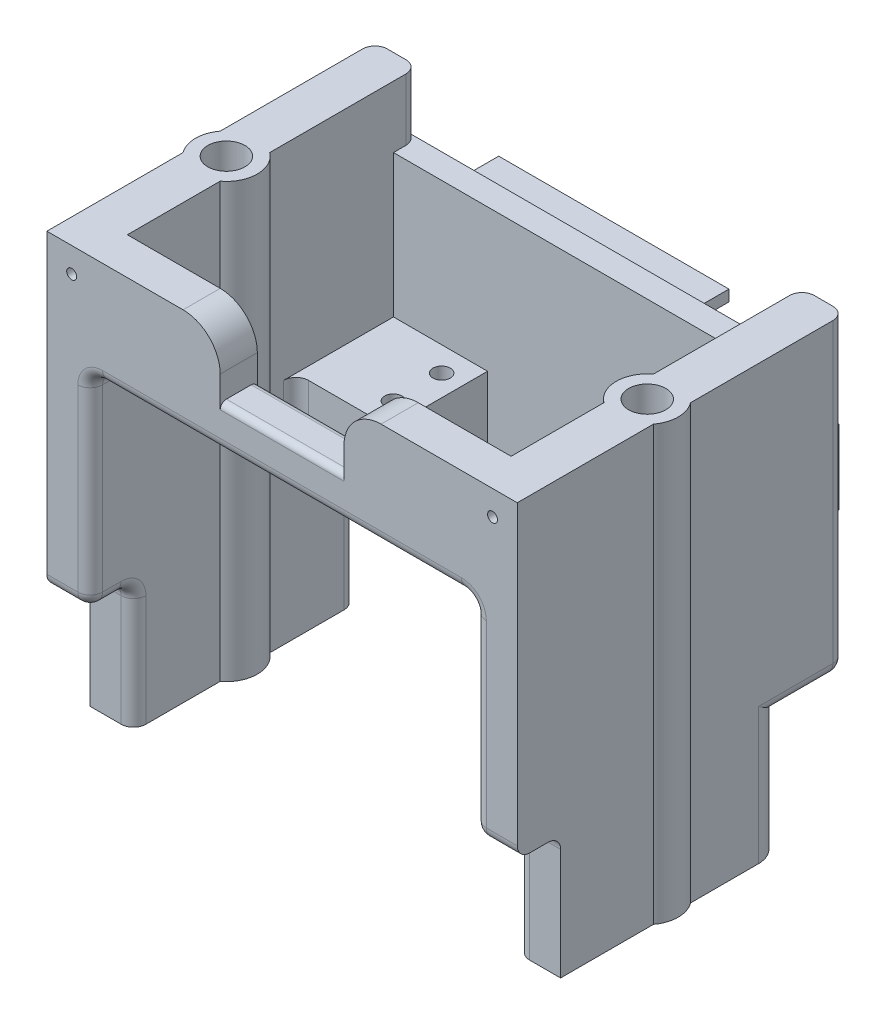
ISO-10303-21;
HEADER;
FILE_DESCRIPTION(('STEP AP214'),'2;1');
FILE_NAME('part.step','',(''),(''),'','','');
FILE_SCHEMA(('AUTOMOTIVE_DESIGN { 1 0 10303 214 1 1 1 1 }'));
ENDSEC;
DATA;
#1=APPLICATION_CONTEXT('core data for automotive mechanical design processes');
#2=APPLICATION_PROTOCOL_DEFINITION('international standard','automotive_design',2000,#1);
#3=PRODUCT_CONTEXT('',#1,'mechanical');
#4=PRODUCT('Part','Part','',(#3));
#5=PRODUCT_RELATED_PRODUCT_CATEGORY('part','',(#4));
#6=PRODUCT_DEFINITION_FORMATION('','',#4);
#7=PRODUCT_DEFINITION_CONTEXT('part definition',#1,'design');
#8=PRODUCT_DEFINITION('design','',#6,#7);
#9=PRODUCT_DEFINITION_SHAPE('','',#8);
#10=(LENGTH_UNIT() NAMED_UNIT(*) SI_UNIT(.MILLI.,.METRE.));
#11=(NAMED_UNIT(*) PLANE_ANGLE_UNIT() SI_UNIT($,.RADIAN.));
#12=(NAMED_UNIT(*) SI_UNIT($,.STERADIAN.) SOLID_ANGLE_UNIT());
#13=UNCERTAINTY_MEASURE_WITH_UNIT(LENGTH_MEASURE(1.E-05),#10,'distance_accuracy_value','');
#14=(GEOMETRIC_REPRESENTATION_CONTEXT(3) GLOBAL_UNCERTAINTY_ASSIGNED_CONTEXT((#13)) GLOBAL_UNIT_ASSIGNED_CONTEXT((#10,
#11,#12)) REPRESENTATION_CONTEXT('',''));
#15=CARTESIAN_POINT('',(0.,0.,0.));
#16=DIRECTION('',(0.,0.,1.));
#17=DIRECTION('',(1.,0.,0.));
#18=AXIS2_PLACEMENT_3D('',#15,#16,#17);
#19=CARTESIAN_POINT('',(-39.37,25.4,-58.6054071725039));
#20=DIRECTION('',(0.,1.,0.));
#21=DIRECTION('',(0.,0.,1.));
#22=AXIS2_PLACEMENT_3D('',#19,#20,#21);
#23=PLANE('',#22);
#24=DIRECTION('',(-1.,0.,0.));
#25=VECTOR('',#24,1.);
#26=CARTESIAN_POINT('',(-39.37,25.4,29.21));
#27=LINE('',#26,#25);
#28=CARTESIAN_POINT('',(48.26,25.4,29.21));
#29=VERTEX_POINT('',#28);
#30=CARTESIAN_POINT('',(41.91,25.4,29.21));
#31=VERTEX_POINT('',#30);
#32=EDGE_CURVE('E830',#29,#31,#27,.T.);
#33=ORIENTED_EDGE('',*,*,#32,.T.);
#34=DIRECTION('',(0.,0.,-1.));
#35=VECTOR('',#34,1.);
#36=CARTESIAN_POINT('',(41.91,25.4,25.4));
#37=LINE('',#36,#35);
#38=CARTESIAN_POINT('',(41.91,25.4,25.4));
#39=VERTEX_POINT('',#38);
#40=EDGE_CURVE('E1545',#31,#39,#37,.T.);
#41=ORIENTED_EDGE('',*,*,#40,.T.);
#42=DIRECTION('',(-1.,0.,0.));
#43=VECTOR('',#42,1.);
#44=CARTESIAN_POINT('',(48.26,25.4,25.4));
#45=LINE('',#44,#43);
#46=CARTESIAN_POINT('',(48.26,25.4,25.4));
#47=VERTEX_POINT('',#46);
#48=EDGE_CURVE('E1573',#39,#47,#45,.F.);
#49=ORIENTED_EDGE('',*,*,#48,.T.);
#50=DIRECTION('',(0.,0.,-1.));
#51=VECTOR('',#50,1.);
#52=CARTESIAN_POINT('',(48.26,25.4,3.81000000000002));
#53=LINE('',#52,#51);
#54=EDGE_CURVE('E1177',#29,#47,#53,.T.);
#55=ORIENTED_EDGE('',*,*,#54,.F.);
#56=EDGE_LOOP('',(#33,#41,#49,#55));
#57=FACE_BOUND('',#56,.T.);
#58=ADVANCED_FACE('F40',(#57),#23,.F.);
#59=CARTESIAN_POINT('',(-39.37,27.94,29.21));
#60=DIRECTION('',(-1.,0.,0.));
#61=DIRECTION('',(0.,0.,1.));
#62=AXIS2_PLACEMENT_3D('',#59,#60,#61);
#63=CYLINDRICAL_SURFACE('',#62,2.54);
#64=DIRECTION('',(-1.,0.,0.));
#65=VECTOR('',#64,1.);
#66=CARTESIAN_POINT('',(-48.26,27.94,31.75));
#67=LINE('',#66,#65);
#68=CARTESIAN_POINT('',(41.91,27.94,31.75));
#69=VERTEX_POINT('',#68);
#70=CARTESIAN_POINT('',(48.26,27.94,31.75));
#71=VERTEX_POINT('',#70);
#72=EDGE_CURVE('E835',#69,#71,#67,.F.);
#73=ORIENTED_EDGE('',*,*,#72,.F.);
#74=CARTESIAN_POINT('',(41.91,27.94,29.21));
#75=DIRECTION('',(-1.,0.,0.));
#76=DIRECTION('',(0.,0.,1.));
#77=AXIS2_PLACEMENT_3D('',#74,#75,#76);
#78=CIRCLE('',#77,2.54);
#79=EDGE_CURVE('E1547',#69,#31,#78,.F.);
#80=ORIENTED_EDGE('',*,*,#79,.T.);
#81=ORIENTED_EDGE('',*,*,#32,.F.);
#82=CARTESIAN_POINT('',(48.26,27.94,29.21));
#83=DIRECTION('',(-1.,0.,0.));
#84=DIRECTION('',(0.,0.,1.));
#85=AXIS2_PLACEMENT_3D('',#82,#83,#84);
#86=CIRCLE('',#85,2.54);
#87=EDGE_CURVE('E839',#71,#29,#86,.F.);
#88=ORIENTED_EDGE('',*,*,#87,.F.);
#89=EDGE_LOOP('',(#73,#80,#81,#88));
#90=FACE_BOUND('',#89,.T.);
#91=ADVANCED_FACE('F989',(#90),#63,.T.);
#92=CARTESIAN_POINT('',(0.,0.,-44.45));
#93=DIRECTION('',(0.,0.,-1.));
#94=DIRECTION('',(-1.,0.,0.));
#95=AXIS2_PLACEMENT_3D('',#92,#93,#94);
#96=PLANE('',#95);
#97=DIRECTION('',(0.,-1.,0.));
#98=VECTOR('',#97,1.);
#99=CARTESIAN_POINT('',(35.814,70.104,-44.45));
#100=LINE('',#99,#98);
#101=CARTESIAN_POINT('',(35.814,59.69,-44.45));
#102=VERTEX_POINT('',#101);
#103=CARTESIAN_POINT('',(35.814,44.45,-44.45));
#104=VERTEX_POINT('',#103);
#105=EDGE_CURVE('E607',#102,#104,#100,.T.);
#106=ORIENTED_EDGE('',*,*,#105,.F.);
#107=DIRECTION('',(-1.,0.,0.));
#108=VECTOR('',#107,1.);
#109=CARTESIAN_POINT('',(38.1,59.69,-44.45));
#110=LINE('',#109,#108);
#111=CARTESIAN_POINT('',(38.1,59.69,-44.45));
#112=VERTEX_POINT('',#111);
#113=EDGE_CURVE('E589',#112,#102,#110,.T.);
#114=ORIENTED_EDGE('',*,*,#113,.F.);
#115=DIRECTION('',(0.,-1.,0.));
#116=VECTOR('',#115,1.);
#117=CARTESIAN_POINT('',(38.1,72.39,-44.45));
#118=LINE('',#117,#116);
#119=CARTESIAN_POINT('',(38.1,44.45,-44.45));
#120=VERTEX_POINT('',#119);
#121=EDGE_CURVE('E605',#112,#120,#118,.T.);
#122=ORIENTED_EDGE('',*,*,#121,.T.);
#123=DIRECTION('',(1.,0.,0.));
#124=VECTOR('',#123,1.);
#125=CARTESIAN_POINT('',(38.1,44.45,-44.45));
#126=LINE('',#125,#124);
#127=EDGE_CURVE('E1154',#104,#120,#126,.T.);
#128=ORIENTED_EDGE('',*,*,#127,.F.);
#129=EDGE_LOOP('',(#106,#114,#122,#128));
#130=FACE_BOUND('',#129,.T.);
#131=ADVANCED_FACE('F603',(#130),#96,.T.);
#132=CARTESIAN_POINT('',(38.1,72.39,-44.45));
#133=DIRECTION('',(-1.,0.,0.));
#134=DIRECTION('',(0.,-1.,0.));
#135=AXIS2_PLACEMENT_3D('',#132,#133,#134);
#136=PLANE('',#135);
#137=DIRECTION('',(0.,0.,1.));
#138=VECTOR('',#137,1.);
#139=CARTESIAN_POINT('',(38.1,59.69,-60.5564842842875));
#140=LINE('',#139,#138);
#141=CARTESIAN_POINT('',(38.1,59.69,-40.64));
#142=VERTEX_POINT('',#141);
#143=EDGE_CURVE('E586',#112,#142,#140,.T.);
#144=ORIENTED_EDGE('',*,*,#143,.T.);
#145=DIRECTION('',(0.,-1.,0.));
#146=VECTOR('',#145,1.);
#147=CARTESIAN_POINT('',(38.1,44.45,-40.64));
#148=LINE('',#147,#146);
#149=CARTESIAN_POINT('',(38.1,44.45,-40.64));
#150=VERTEX_POINT('',#149);
#151=EDGE_CURVE('E1915',#142,#150,#148,.T.);
#152=ORIENTED_EDGE('',*,*,#151,.T.);
#153=DIRECTION('',(0.,0.,1.));
#154=VECTOR('',#153,1.);
#155=CARTESIAN_POINT('',(38.1,44.45,-60.5564842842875));
#156=LINE('',#155,#154);
#157=EDGE_CURVE('E598',#120,#150,#156,.T.);
#158=ORIENTED_EDGE('',*,*,#157,.F.);
#159=ORIENTED_EDGE('',*,*,#121,.F.);
#160=EDGE_LOOP('',(#144,#152,#158,#159));
#161=FACE_BOUND('',#160,.T.);
#162=ADVANCED_FACE('F611',(#161),#136,.F.);
#163=CARTESIAN_POINT('',(35.814,70.104,-44.45));
#164=DIRECTION('',(-1.,0.,0.));
#165=DIRECTION('',(0.,-1.,0.));
#166=AXIS2_PLACEMENT_3D('',#163,#164,#165);
#167=PLANE('',#166);
#168=DIRECTION('',(0.,-1.,0.));
#169=VECTOR('',#168,1.);
#170=CARTESIAN_POINT('',(35.814,70.104,-35.56));
#171=LINE('',#170,#169);
#172=CARTESIAN_POINT('',(35.814,59.69,-35.56));
#173=VERTEX_POINT('',#172);
#174=CARTESIAN_POINT('',(35.814,44.45,-35.56));
#175=VERTEX_POINT('',#174);
#176=EDGE_CURVE('E1214',#173,#175,#171,.T.);
#177=ORIENTED_EDGE('',*,*,#176,.F.);
#178=DIRECTION('',(0.,0.,-1.));
#179=VECTOR('',#178,1.);
#180=CARTESIAN_POINT('',(35.814,59.69,-44.45));
#181=LINE('',#180,#179);
#182=EDGE_CURVE('E1123',#173,#102,#181,.T.);
#183=ORIENTED_EDGE('',*,*,#182,.T.);
#184=ORIENTED_EDGE('',*,*,#105,.T.);
#185=DIRECTION('',(0.,0.,1.));
#186=VECTOR('',#185,1.);
#187=CARTESIAN_POINT('',(35.814,44.45,-44.45));
#188=LINE('',#187,#186);
#189=EDGE_CURVE('E608',#104,#175,#188,.T.);
#190=ORIENTED_EDGE('',*,*,#189,.T.);
#191=EDGE_LOOP('',(#177,#183,#184,#190));
#192=FACE_BOUND('',#191,.T.);
#193=ADVANCED_FACE('F1285',(#192),#167,.T.);
#194=DIRECTION('',(1.,0.,0.));
#195=VECTOR('',#194,1.);
#196=CARTESIAN_POINT('',(35.814,70.104,-44.45));
#197=LINE('',#196,#195);
#198=CARTESIAN_POINT('',(-29.2227319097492,70.104,-44.45));
#199=VERTEX_POINT('',#198);
#200=CARTESIAN_POINT('',(15.494,70.104,-44.45));
#201=VERTEX_POINT('',#200);
#202=EDGE_CURVE('E630',#199,#201,#197,.T.);
#203=ORIENTED_EDGE('',*,*,#202,.F.);
#204=CARTESIAN_POINT('',(-29.2227319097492,72.644,-44.45));
#205=DIRECTION('',(0.,0.,-1.));
#206=DIRECTION('',(-1.,0.,0.));
#207=AXIS2_PLACEMENT_3D('',#204,#205,#206);
#208=CIRCLE('',#207,2.54);
#209=CARTESIAN_POINT('',(-31.75,72.39,-44.45));
#210=VERTEX_POINT('',#209);
#211=EDGE_CURVE('E847',#199,#210,#208,.T.);
#212=ORIENTED_EDGE('',*,*,#211,.T.);
#213=DIRECTION('',(1.,0.,0.));
#214=VECTOR('',#213,1.);
#215=CARTESIAN_POINT('',(38.1,72.39,-44.45));
#216=LINE('',#215,#214);
#217=CARTESIAN_POINT('',(15.494,72.39,-44.45));
#218=VERTEX_POINT('',#217);
#219=EDGE_CURVE('E617',#210,#218,#216,.T.);
#220=ORIENTED_EDGE('',*,*,#219,.T.);
#221=DIRECTION('',(0.,1.,0.));
#222=VECTOR('',#221,1.);
#223=CARTESIAN_POINT('',(15.494,70.104,-44.45));
#224=LINE('',#223,#222);
#225=EDGE_CURVE('E1211',#201,#218,#224,.T.);
#226=ORIENTED_EDGE('',*,*,#225,.F.);
#227=EDGE_LOOP('',(#203,#212,#220,#226));
#228=FACE_BOUND('',#227,.T.);
#229=ADVANCED_FACE('F1260',(#228),#96,.T.);
#230=DIRECTION('',(-1.,0.,0.));
#231=VECTOR('',#230,1.);
#232=CARTESIAN_POINT('',(38.1,31.75,-44.45));
#233=LINE('',#232,#231);
#234=CARTESIAN_POINT('',(15.494,31.75,-44.45));
#235=VERTEX_POINT('',#234);
#236=CARTESIAN_POINT('',(-31.75,31.75,-44.45));
#237=VERTEX_POINT('',#236);
#238=EDGE_CURVE('E613',#235,#237,#233,.T.);
#239=ORIENTED_EDGE('',*,*,#238,.T.);
#240=CARTESIAN_POINT('',(-29.2227319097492,31.496,-44.45));
#241=DIRECTION('',(0.,0.,-1.));
#242=DIRECTION('',(-1.,0.,0.));
#243=AXIS2_PLACEMENT_3D('',#240,#241,#242);
#244=CIRCLE('',#243,2.54);
#245=CARTESIAN_POINT('',(-29.2227319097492,34.036,-44.45));
#246=VERTEX_POINT('',#245);
#247=EDGE_CURVE('E841',#237,#246,#244,.T.);
#248=ORIENTED_EDGE('',*,*,#247,.T.);
#249=DIRECTION('',(-1.,0.,0.));
#250=VECTOR('',#249,1.);
#251=CARTESIAN_POINT('',(35.814,34.036,-44.45));
#252=LINE('',#251,#250);
#253=CARTESIAN_POINT('',(15.494,34.036,-44.45));
#254=VERTEX_POINT('',#253);
#255=EDGE_CURVE('E1234',#254,#246,#252,.T.);
#256=ORIENTED_EDGE('',*,*,#255,.F.);
#257=DIRECTION('',(0.,1.,0.));
#258=VECTOR('',#257,1.);
#259=CARTESIAN_POINT('',(15.494,34.036,-44.45));
#260=LINE('',#259,#258);
#261=EDGE_CURVE('E1222',#235,#254,#260,.T.);
#262=ORIENTED_EDGE('',*,*,#261,.F.);
#263=EDGE_LOOP('',(#239,#248,#256,#262));
#264=FACE_BOUND('',#263,.T.);
#265=ADVANCED_FACE('F1277',(#264),#96,.T.);
#266=CARTESIAN_POINT('',(38.1,31.75,-44.45));
#267=DIRECTION('',(0.,1.,0.));
#268=DIRECTION('',(0.,0.,1.));
#269=AXIS2_PLACEMENT_3D('',#266,#267,#268);
#270=PLANE('',#269);
#271=DIRECTION('',(-1.,0.,0.));
#272=VECTOR('',#271,1.);
#273=CARTESIAN_POINT('',(38.1,31.75,-35.56));
#274=LINE('',#273,#272);
#275=CARTESIAN_POINT('',(15.494,31.75,-35.56));
#276=VERTEX_POINT('',#275);
#277=CARTESIAN_POINT('',(-31.75,31.75,-35.56));
#278=VERTEX_POINT('',#277);
#279=EDGE_CURVE('E620',#276,#278,#274,.T.);
#280=ORIENTED_EDGE('',*,*,#279,.T.);
#281=DIRECTION('',(0.,0.,-1.));
#282=VECTOR('',#281,1.);
#283=CARTESIAN_POINT('',(-31.75,31.75,5.5731022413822));
#284=LINE('',#283,#282);
#285=EDGE_CURVE('E1210',#278,#237,#284,.T.);
#286=ORIENTED_EDGE('',*,*,#285,.T.);
#287=ORIENTED_EDGE('',*,*,#238,.F.);
#288=DIRECTION('',(0.,0.,-1.));
#289=VECTOR('',#288,1.);
#290=CARTESIAN_POINT('',(15.494,31.75,5.5731022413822));
#291=LINE('',#290,#289);
#292=EDGE_CURVE('E1226',#276,#235,#291,.T.);
#293=ORIENTED_EDGE('',*,*,#292,.F.);
#294=EDGE_LOOP('',(#280,#286,#287,#293));
#295=FACE_BOUND('',#294,.T.);
#296=ADVANCED_FACE('F1269',(#295),#270,.F.);
#297=CARTESIAN_POINT('',(38.1,72.39,-44.45));
#298=DIRECTION('',(0.,-1.,0.));
#299=DIRECTION('',(0.,0.,-1.));
#300=AXIS2_PLACEMENT_3D('',#297,#298,#299);
#301=PLANE('',#300);
#302=ORIENTED_EDGE('',*,*,#219,.F.);
#303=DIRECTION('',(0.,0.,-1.));
#304=VECTOR('',#303,1.);
#305=CARTESIAN_POINT('',(-31.75,72.39,5.5731022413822));
#306=LINE('',#305,#304);
#307=CARTESIAN_POINT('',(-31.75,72.39,-35.56));
#308=VERTEX_POINT('',#307);
#309=EDGE_CURVE('E1207',#308,#210,#306,.T.);
#310=ORIENTED_EDGE('',*,*,#309,.F.);
#311=DIRECTION('',(1.,0.,0.));
#312=VECTOR('',#311,1.);
#313=CARTESIAN_POINT('',(38.1,72.39,-35.56));
#314=LINE('',#313,#312);
#315=CARTESIAN_POINT('',(15.494,72.39,-35.56));
#316=VERTEX_POINT('',#315);
#317=EDGE_CURVE('E614',#308,#316,#314,.T.);
#318=ORIENTED_EDGE('',*,*,#317,.T.);
#319=DIRECTION('',(0.,0.,-1.));
#320=VECTOR('',#319,1.);
#321=CARTESIAN_POINT('',(15.494,72.39,5.5731022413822));
#322=LINE('',#321,#320);
#323=EDGE_CURVE('E1219',#316,#218,#322,.T.);
#324=ORIENTED_EDGE('',*,*,#323,.T.);
#325=EDGE_LOOP('',(#302,#310,#318,#324));
#326=FACE_BOUND('',#325,.T.);
#327=ADVANCED_FACE('F1266',(#326),#301,.F.);
#328=CARTESIAN_POINT('',(35.814,34.036,-44.45));
#329=DIRECTION('',(0.,1.,0.));
#330=DIRECTION('',(0.,0.,1.));
#331=AXIS2_PLACEMENT_3D('',#328,#329,#330);
#332=PLANE('',#331);
#333=ORIENTED_EDGE('',*,*,#255,.T.);
#334=DIRECTION('',(0.,0.,-1.));
#335=VECTOR('',#334,1.);
#336=CARTESIAN_POINT('',(-29.2227319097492,34.036,-35.56));
#337=LINE('',#336,#335);
#338=CARTESIAN_POINT('',(-29.2227319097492,34.036,-35.56));
#339=VERTEX_POINT('',#338);
#340=EDGE_CURVE('E843',#246,#339,#337,.F.);
#341=ORIENTED_EDGE('',*,*,#340,.T.);
#342=DIRECTION('',(-1.,0.,0.));
#343=VECTOR('',#342,1.);
#344=CARTESIAN_POINT('',(35.814,34.036,-35.56));
#345=LINE('',#344,#343);
#346=CARTESIAN_POINT('',(15.494,34.036,-35.56));
#347=VERTEX_POINT('',#346);
#348=EDGE_CURVE('E1239',#347,#339,#345,.T.);
#349=ORIENTED_EDGE('',*,*,#348,.F.);
#350=DIRECTION('',(0.,0.,-1.));
#351=VECTOR('',#350,1.);
#352=CARTESIAN_POINT('',(15.494,34.036,5.5731022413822));
#353=LINE('',#352,#351);
#354=EDGE_CURVE('E1198',#347,#254,#353,.T.);
#355=ORIENTED_EDGE('',*,*,#354,.T.);
#356=EDGE_LOOP('',(#333,#341,#349,#355));
#357=FACE_BOUND('',#356,.T.);
#358=ADVANCED_FACE('F1268',(#357),#332,.T.);
#359=CARTESIAN_POINT('',(35.814,70.104,-44.45));
#360=DIRECTION('',(0.,-1.,0.));
#361=DIRECTION('',(0.,0.,-1.));
#362=AXIS2_PLACEMENT_3D('',#359,#360,#361);
#363=PLANE('',#362);
#364=DIRECTION('',(1.,0.,0.));
#365=VECTOR('',#364,1.);
#366=CARTESIAN_POINT('',(35.814,70.104,-35.56));
#367=LINE('',#366,#365);
#368=CARTESIAN_POINT('',(-29.2227319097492,70.104,-35.56));
#369=VERTEX_POINT('',#368);
#370=CARTESIAN_POINT('',(15.494,70.104,-35.56));
#371=VERTEX_POINT('',#370);
#372=EDGE_CURVE('E623',#369,#371,#367,.T.);
#373=ORIENTED_EDGE('',*,*,#372,.F.);
#374=DIRECTION('',(0.,0.,1.));
#375=VECTOR('',#374,1.);
#376=CARTESIAN_POINT('',(-29.2227319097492,70.104,-44.45));
#377=LINE('',#376,#375);
#378=EDGE_CURVE('E845',#369,#199,#377,.F.);
#379=ORIENTED_EDGE('',*,*,#378,.T.);
#380=ORIENTED_EDGE('',*,*,#202,.T.);
#381=DIRECTION('',(0.,0.,-1.));
#382=VECTOR('',#381,1.);
#383=CARTESIAN_POINT('',(15.494,70.104,5.5731022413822));
#384=LINE('',#383,#382);
#385=EDGE_CURVE('E1215',#371,#201,#384,.T.);
#386=ORIENTED_EDGE('',*,*,#385,.F.);
#387=EDGE_LOOP('',(#373,#379,#380,#386));
#388=FACE_BOUND('',#387,.T.);
#389=ADVANCED_FACE('F1256',(#388),#363,.T.);
#390=CARTESIAN_POINT('',(-39.37,88.9,-30.48));
#391=DIRECTION('',(0.,0.,1.));
#392=DIRECTION('',(1.,0.,0.));
#393=AXIS2_PLACEMENT_3D('',#390,#391,#392);
#394=PLANE('',#393);
#395=DIRECTION('',(0.,-1.,0.));
#396=VECTOR('',#395,1.);
#397=CARTESIAN_POINT('',(39.37,88.9,-30.48));
#398=LINE('',#397,#396);
#399=CARTESIAN_POINT('',(39.37,29.21,-30.48));
#400=VERTEX_POINT('',#399);
#401=CARTESIAN_POINT('',(39.37,25.4,-30.48));
#402=VERTEX_POINT('',#401);
#403=EDGE_CURVE('E746',#400,#402,#398,.T.);
#404=ORIENTED_EDGE('',*,*,#403,.F.);
#405=CARTESIAN_POINT('',(36.83,29.21,-30.48));
#406=DIRECTION('',(0.,0.,1.));
#407=DIRECTION('',(1.,0.,0.));
#408=AXIS2_PLACEMENT_3D('',#405,#406,#407);
#409=CIRCLE('',#408,2.54);
#410=CARTESIAN_POINT('',(36.83,31.75,-30.48));
#411=VERTEX_POINT('',#410);
#412=EDGE_CURVE('E1630',#400,#411,#409,.T.);
#413=ORIENTED_EDGE('',*,*,#412,.T.);
#414=DIRECTION('',(-1.,0.,0.));
#415=VECTOR('',#414,1.);
#416=CARTESIAN_POINT('',(39.37,31.75,-30.48));
#417=LINE('',#416,#415);
#418=CARTESIAN_POINT('',(22.606,31.75,-30.48));
#419=VERTEX_POINT('',#418);
#420=EDGE_CURVE('E633',#411,#419,#417,.T.);
#421=ORIENTED_EDGE('',*,*,#420,.T.);
#422=CARTESIAN_POINT('',(22.606,34.29,-30.48));
#423=DIRECTION('',(0.,0.,1.));
#424=DIRECTION('',(1.,0.,0.));
#425=AXIS2_PLACEMENT_3D('',#422,#423,#424);
#426=CIRCLE('',#425,2.54);
#427=CARTESIAN_POINT('',(20.066,34.29,-30.48));
#428=VERTEX_POINT('',#427);
#429=EDGE_CURVE('E1479',#419,#428,#426,.F.);
#430=ORIENTED_EDGE('',*,*,#429,.T.);
#431=DIRECTION('',(0.,1.,0.));
#432=VECTOR('',#431,1.);
#433=CARTESIAN_POINT('',(20.066,31.75,-30.48));
#434=LINE('',#433,#432);
#435=CARTESIAN_POINT('',(20.066,46.99,-30.48));
#436=VERTEX_POINT('',#435);
#437=EDGE_CURVE('E628',#428,#436,#434,.T.);
#438=ORIENTED_EDGE('',*,*,#437,.T.);
#439=DIRECTION('',(-1.,0.,0.));
#440=VECTOR('',#439,1.);
#441=CARTESIAN_POINT('',(39.37,46.99,-30.48));
#442=LINE('',#441,#440);
#443=CARTESIAN_POINT('',(39.37,46.99,-30.48));
#444=VERTEX_POINT('',#443);
#445=EDGE_CURVE('E640',#444,#436,#442,.T.);
#446=ORIENTED_EDGE('',*,*,#445,.F.);
#447=CARTESIAN_POINT('',(39.37,76.2,-30.48));
#448=VERTEX_POINT('',#447);
#449=EDGE_CURVE('E747',#448,#444,#398,.T.);
#450=ORIENTED_EDGE('',*,*,#449,.F.);
#451=DIRECTION('',(1.,0.,0.));
#452=VECTOR('',#451,1.);
#453=CARTESIAN_POINT('',(-39.37,76.2,-30.48));
#454=LINE('',#453,#452);
#455=CARTESIAN_POINT('',(-39.37,76.2,-30.48));
#456=VERTEX_POINT('',#455);
#457=EDGE_CURVE('E666',#456,#448,#454,.T.);
#458=ORIENTED_EDGE('',*,*,#457,.F.);
#459=DIRECTION('',(0.,-1.,0.));
#460=VECTOR('',#459,1.);
#461=CARTESIAN_POINT('',(-39.37,88.9,-30.48));
#462=LINE('',#461,#460);
#463=CARTESIAN_POINT('',(-39.37,46.99,-30.48));
#464=VERTEX_POINT('',#463);
#465=EDGE_CURVE('E743',#456,#464,#462,.T.);
#466=ORIENTED_EDGE('',*,*,#465,.T.);
#467=DIRECTION('',(-1.,0.,0.));
#468=VECTOR('',#467,1.);
#469=CARTESIAN_POINT('',(-39.37,46.99,-30.48));
#470=LINE('',#469,#468);
#471=CARTESIAN_POINT('',(-20.066,46.99,-30.48));
#472=VERTEX_POINT('',#471);
#473=EDGE_CURVE('E652',#472,#464,#470,.T.);
#474=ORIENTED_EDGE('',*,*,#473,.F.);
#475=DIRECTION('',(0.,1.,0.));
#476=VECTOR('',#475,1.);
#477=CARTESIAN_POINT('',(-20.066,31.75,-30.48));
#478=LINE('',#477,#476);
#479=CARTESIAN_POINT('',(-20.066,34.29,-30.48));
#480=VERTEX_POINT('',#479);
#481=EDGE_CURVE('E651',#480,#472,#478,.T.);
#482=ORIENTED_EDGE('',*,*,#481,.F.);
#483=CARTESIAN_POINT('',(-22.606,34.29,-30.48));
#484=DIRECTION('',(0.,0.,1.));
#485=DIRECTION('',(1.,0.,0.));
#486=AXIS2_PLACEMENT_3D('',#483,#484,#485);
#487=CIRCLE('',#486,2.54);
#488=CARTESIAN_POINT('',(-22.606,31.75,-30.48));
#489=VERTEX_POINT('',#488);
#490=EDGE_CURVE('E1475',#480,#489,#487,.F.);
#491=ORIENTED_EDGE('',*,*,#490,.T.);
#492=DIRECTION('',(-1.,0.,0.));
#493=VECTOR('',#492,1.);
#494=CARTESIAN_POINT('',(-39.37,31.75,-30.48));
#495=LINE('',#494,#493);
#496=CARTESIAN_POINT('',(-36.83,31.75,-30.48));
#497=VERTEX_POINT('',#496);
#498=EDGE_CURVE('E648',#489,#497,#495,.T.);
#499=ORIENTED_EDGE('',*,*,#498,.T.);
#500=CARTESIAN_POINT('',(-36.83,29.21,-30.48));
#501=DIRECTION('',(0.,0.,1.));
#502=DIRECTION('',(1.,0.,0.));
#503=AXIS2_PLACEMENT_3D('',#500,#501,#502);
#504=CIRCLE('',#503,2.54);
#505=CARTESIAN_POINT('',(-39.37,29.21,-30.48));
#506=VERTEX_POINT('',#505);
#507=EDGE_CURVE('E1628',#497,#506,#504,.T.);
#508=ORIENTED_EDGE('',*,*,#507,.T.);
#509=CARTESIAN_POINT('',(-39.37,25.4,-30.48));
#510=VERTEX_POINT('',#509);
#511=EDGE_CURVE('E742',#506,#510,#462,.T.);
#512=ORIENTED_EDGE('',*,*,#511,.T.);
#513=DIRECTION('',(-1.,0.,0.));
#514=VECTOR('',#513,1.);
#515=CARTESIAN_POINT('',(-39.37,25.4,-30.48));
#516=LINE('',#515,#514);
#517=EDGE_CURVE('E1172',#402,#510,#516,.T.);
#518=ORIENTED_EDGE('',*,*,#517,.F.);
#519=EDGE_LOOP('',(#404,#413,#421,#430,#438,#446,#450,#458,#466,#474,#482,#491,#499,#508,#512,#518));
#520=FACE_BOUND('',#519,.T.);
#521=ADVANCED_FACE('F1359',(#520),#394,.T.);
#522=CARTESIAN_POINT('',(-39.37,88.9,-30.48));
#523=DIRECTION('',(1.,0.,0.));
#524=DIRECTION('',(0.,0.,-1.));
#525=AXIS2_PLACEMENT_3D('',#522,#523,#524);
#526=PLANE('',#525);
#527=DIRECTION('',(0.,1.,0.));
#528=VECTOR('',#527,1.);
#529=CARTESIAN_POINT('',(-39.37,46.99,-7.9502));
#530=LINE('',#529,#528);
#531=CARTESIAN_POINT('',(-39.37,34.29,-7.9502));
#532=VERTEX_POINT('',#531);
#533=CARTESIAN_POINT('',(-39.37,46.99,-7.9502));
#534=VERTEX_POINT('',#533);
#535=EDGE_CURVE('E1875',#532,#534,#530,.T.);
#536=ORIENTED_EDGE('',*,*,#535,.T.);
#537=DIRECTION('',(0.,0.,1.));
#538=VECTOR('',#537,1.);
#539=CARTESIAN_POINT('',(-39.37,46.99,-30.48));
#540=LINE('',#539,#538);
#541=EDGE_CURVE('E645',#464,#534,#540,.T.);
#542=ORIENTED_EDGE('',*,*,#541,.F.);
#543=ORIENTED_EDGE('',*,*,#465,.F.);
#544=DIRECTION('',(0.,0.,1.));
#545=VECTOR('',#544,1.);
#546=CARTESIAN_POINT('',(-39.37,76.2,-30.48));
#547=LINE('',#546,#545);
#548=CARTESIAN_POINT('',(-39.37,76.2,-33.02));
#549=VERTEX_POINT('',#548);
#550=EDGE_CURVE('E664',#549,#456,#547,.T.);
#551=ORIENTED_EDGE('',*,*,#550,.F.);
#552=DIRECTION('',(0.,1.,0.));
#553=VECTOR('',#552,1.);
#554=CARTESIAN_POINT('',(-39.37,88.9,-33.02));
#555=LINE('',#554,#553);
#556=CARTESIAN_POINT('',(-39.37,88.9,-33.02));
#557=VERTEX_POINT('',#556);
#558=EDGE_CURVE('E853',#549,#557,#555,.T.);
#559=ORIENTED_EDGE('',*,*,#558,.T.);
#560=DIRECTION('',(0.,0.,1.));
#561=VECTOR('',#560,1.);
#562=CARTESIAN_POINT('',(-39.37,88.9,-30.48));
#563=LINE('',#562,#561);
#564=CARTESIAN_POINT('',(-39.37,88.9,-5.08));
#565=VERTEX_POINT('',#564);
#566=EDGE_CURVE('E704',#557,#565,#563,.T.);
#567=ORIENTED_EDGE('',*,*,#566,.T.);
#568=DIRECTION('',(0.,-1.,0.));
#569=VECTOR('',#568,1.);
#570=CARTESIAN_POINT('',(-39.37,88.9,-5.08));
#571=LINE('',#570,#569);
#572=CARTESIAN_POINT('',(-39.37,0.,-5.08));
#573=VERTEX_POINT('',#572);
#574=EDGE_CURVE('E739',#565,#573,#571,.T.);
#575=ORIENTED_EDGE('',*,*,#574,.T.);
#576=DIRECTION('',(0.,0.,1.));
#577=VECTOR('',#576,1.);
#578=CARTESIAN_POINT('',(-39.37,0.,-30.48));
#579=LINE('',#578,#577);
#580=CARTESIAN_POINT('',(-39.37,0.,-20.32));
#581=VERTEX_POINT('',#580);
#582=EDGE_CURVE('E721',#581,#573,#579,.T.);
#583=ORIENTED_EDGE('',*,*,#582,.F.);
#584=DIRECTION('',(0.,-1.,0.));
#585=VECTOR('',#584,1.);
#586=CARTESIAN_POINT('',(-39.37,25.4,-20.32));
#587=LINE('',#586,#585);
#588=CARTESIAN_POINT('',(-39.37,25.4,-20.32));
#589=VERTEX_POINT('',#588);
#590=EDGE_CURVE('E1902',#581,#589,#587,.F.);
#591=ORIENTED_EDGE('',*,*,#590,.T.);
#592=DIRECTION('',(0.,0.,1.));
#593=VECTOR('',#592,1.);
#594=CARTESIAN_POINT('',(-39.37,25.4,-30.48));
#595=LINE('',#594,#593);
#596=EDGE_CURVE('E1175',#510,#589,#595,.T.);
#597=ORIENTED_EDGE('',*,*,#596,.F.);
#598=ORIENTED_EDGE('',*,*,#511,.F.);
#599=DIRECTION('',(0.,0.,1.));
#600=VECTOR('',#599,1.);
#601=CARTESIAN_POINT('',(-39.37,29.21,-30.48));
#602=LINE('',#601,#600);
#603=CARTESIAN_POINT('',(-39.37,29.21,-13.0302));
#604=VERTEX_POINT('',#603);
#605=EDGE_CURVE('E1880',#506,#604,#602,.T.);
#606=ORIENTED_EDGE('',*,*,#605,.T.);
#607=CARTESIAN_POINT('',(-39.37,34.29,-13.0302));
#608=DIRECTION('',(1.,0.,0.));
#609=DIRECTION('',(0.,0.,-1.));
#610=AXIS2_PLACEMENT_3D('',#607,#608,#609);
#611=CIRCLE('',#610,5.08);
#612=EDGE_CURVE('E1877',#532,#604,#611,.T.);
#613=ORIENTED_EDGE('',*,*,#612,.F.);
#614=EDGE_LOOP('',(#536,#542,#543,#551,#559,#567,#575,#583,#591,#597,#598,#606,#613));
#615=FACE_BOUND('',#614,.T.);
#616=ADVANCED_FACE('F1355',(#615),#526,.T.);
#617=CARTESIAN_POINT('',(-43.18,88.9,0.));
#618=DIRECTION('',(0.,1.,0.));
#619=DIRECTION('',(0.,0.,1.));
#620=AXIS2_PLACEMENT_3D('',#617,#618,#619);
#621=PLANE('',#620);
#622=DIRECTION('',(-1.,0.,0.));
#623=VECTOR('',#622,1.);
#624=CARTESIAN_POINT('',(-48.26,88.9,-35.56));
#625=LINE('',#624,#623);
#626=CARTESIAN_POINT('',(-41.91,88.9,-35.56));
#627=VERTEX_POINT('',#626);
#628=CARTESIAN_POINT('',(-45.72,88.9,-35.56));
#629=VERTEX_POINT('',#628);
#630=EDGE_CURVE('E778',#627,#629,#625,.T.);
#631=ORIENTED_EDGE('',*,*,#630,.T.);
#632=CARTESIAN_POINT('',(-45.72,88.9,-33.02));
#633=DIRECTION('',(0.,1.,0.));
#634=DIRECTION('',(0.,0.,1.));
#635=AXIS2_PLACEMENT_3D('',#632,#633,#634);
#636=CIRCLE('',#635,2.54);
#637=CARTESIAN_POINT('',(-48.26,88.9,-33.02));
#638=VERTEX_POINT('',#637);
#639=EDGE_CURVE('E926',#629,#638,#636,.T.);
#640=ORIENTED_EDGE('',*,*,#639,.T.);
#641=DIRECTION('',(0.,0.,1.));
#642=VECTOR('',#641,1.);
#643=CARTESIAN_POINT('',(-48.26,88.9,-35.56));
#644=LINE('',#643,#642);
#645=CARTESIAN_POINT('',(-48.26,88.9,-3.81000000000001));
#646=VERTEX_POINT('',#645);
#647=EDGE_CURVE('E760',#638,#646,#644,.T.);
#648=ORIENTED_EDGE('',*,*,#647,.T.);
#649=CARTESIAN_POINT('',(-43.18,88.9,0.));
#650=DIRECTION('',(0.,1.,0.));
#651=DIRECTION('',(0.,0.,1.));
#652=AXIS2_PLACEMENT_3D('',#649,#650,#651);
#653=CIRCLE('',#652,6.35);
#654=CARTESIAN_POINT('',(-48.26,88.9,3.81000000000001));
#655=VERTEX_POINT('',#654);
#656=EDGE_CURVE('E762',#646,#655,#653,.T.);
#657=ORIENTED_EDGE('',*,*,#656,.T.);
#658=DIRECTION('',(0.,0.,1.));
#659=VECTOR('',#658,1.);
#660=CARTESIAN_POINT('',(-48.26,88.9,3.81000000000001));
#661=LINE('',#660,#659);
#662=CARTESIAN_POINT('',(-48.26,88.9,31.75));
#663=VERTEX_POINT('',#662);
#664=EDGE_CURVE('E765',#655,#663,#661,.T.);
#665=ORIENTED_EDGE('',*,*,#664,.T.);
#666=DIRECTION('',(1.,0.,0.));
#667=VECTOR('',#666,1.);
#668=CARTESIAN_POINT('',(-48.26,88.9,31.75));
#669=LINE('',#668,#667);
#670=CARTESIAN_POINT('',(-20.32,88.9,31.75));
#671=VERTEX_POINT('',#670);
#672=EDGE_CURVE('E768',#663,#671,#669,.T.);
#673=ORIENTED_EDGE('',*,*,#672,.T.);
#674=DIRECTION('',(0.,0.,1.));
#675=VECTOR('',#674,1.);
#676=CARTESIAN_POINT('',(-20.32,88.9,24.13));
#677=LINE('',#676,#675);
#678=CARTESIAN_POINT('',(-20.32,88.9,24.13));
#679=VERTEX_POINT('',#678);
#680=EDGE_CURVE('E827',#671,#679,#677,.F.);
#681=ORIENTED_EDGE('',*,*,#680,.T.);
#682=DIRECTION('',(1.,0.,0.));
#683=VECTOR('',#682,1.);
#684=CARTESIAN_POINT('',(-39.37,88.9,24.13));
#685=LINE('',#684,#683);
#686=CARTESIAN_POINT('',(-39.37,88.9,24.13));
#687=VERTEX_POINT('',#686);
#688=EDGE_CURVE('E711',#687,#679,#685,.T.);
#689=ORIENTED_EDGE('',*,*,#688,.F.);
#690=DIRECTION('',(0.,0.,1.));
#691=VECTOR('',#690,1.);
#692=CARTESIAN_POINT('',(-39.37,88.9,5.08));
#693=LINE('',#692,#691);
#694=CARTESIAN_POINT('',(-39.37,88.9,5.08));
#695=VERTEX_POINT('',#694);
#696=EDGE_CURVE('E708',#695,#687,#693,.T.);
#697=ORIENTED_EDGE('',*,*,#696,.F.);
#698=CARTESIAN_POINT('',(-43.18,88.9,0.));
#699=DIRECTION('',(0.,-1.,0.));
#700=DIRECTION('',(0.,0.,1.));
#701=AXIS2_PLACEMENT_3D('',#698,#699,#700);
#702=CIRCLE('',#701,6.35);
#703=EDGE_CURVE('E706',#565,#695,#702,.T.);
#704=ORIENTED_EDGE('',*,*,#703,.F.);
#705=ORIENTED_EDGE('',*,*,#566,.F.);
#706=CARTESIAN_POINT('',(-41.91,88.9,-33.02));
#707=DIRECTION('',(0.,1.,0.));
#708=DIRECTION('',(0.,0.,1.));
#709=AXIS2_PLACEMENT_3D('',#706,#707,#708);
#710=CIRCLE('',#709,2.54);
#711=EDGE_CURVE('E856',#557,#627,#710,.T.);
#712=ORIENTED_EDGE('',*,*,#711,.T.);
#713=EDGE_LOOP('',(#631,#640,#648,#657,#665,#673,#681,#689,#697,#704,#705,#712));
#714=FACE_BOUND('',#713,.T.);
#715=CARTESIAN_POINT('',(-43.18,88.9,0.));
#716=DIRECTION('',(0.,1.,0.));
#717=DIRECTION('',(0.,0.,1.));
#718=AXIS2_PLACEMENT_3D('',#715,#716,#717);
#719=CIRCLE('',#718,3.81);
#720=CARTESIAN_POINT('',(-43.18,88.9,3.81));
#721=VERTEX_POINT('',#720);
#722=EDGE_CURVE('E754',#721,#721,#719,.T.);
#723=ORIENTED_EDGE('',*,*,#722,.F.);
#724=EDGE_LOOP('',(#723));
#725=FACE_BOUND('',#724,.T.);
#726=ADVANCED_FACE('F1358',(#714,#725),#621,.T.);
#727=CARTESIAN_POINT('',(-43.18,0.,0.));
#728=DIRECTION('',(0.,1.,0.));
#729=DIRECTION('',(0.,0.,1.));
#730=AXIS2_PLACEMENT_3D('',#727,#728,#729);
#731=PLANE('',#730);
#732=CARTESIAN_POINT('',(-43.18,0.,0.));
#733=DIRECTION('',(0.,1.,0.));
#734=DIRECTION('',(0.,0.,1.));
#735=AXIS2_PLACEMENT_3D('',#732,#733,#734);
#736=CIRCLE('',#735,3.81);
#737=CARTESIAN_POINT('',(-43.18,0.,3.81));
#738=VERTEX_POINT('',#737);
#739=EDGE_CURVE('E753',#738,#738,#736,.T.);
#740=ORIENTED_EDGE('',*,*,#739,.T.);
#741=EDGE_LOOP('',(#740));
#742=FACE_BOUND('',#741,.T.);
#743=DIRECTION('',(0.,0.,1.));
#744=VECTOR('',#743,1.);
#745=CARTESIAN_POINT('',(-39.37,0.,5.08));
#746=LINE('',#745,#744);
#747=CARTESIAN_POINT('',(-39.37,0.,5.08));
#748=VERTEX_POINT('',#747);
#749=CARTESIAN_POINT('',(-39.37,0.,20.32));
#750=VERTEX_POINT('',#749);
#751=EDGE_CURVE('E725',#748,#750,#746,.T.);
#752=ORIENTED_EDGE('',*,*,#751,.T.);
#753=CARTESIAN_POINT('',(-41.91,0.,20.32));
#754=DIRECTION('',(0.,1.,0.));
#755=DIRECTION('',(0.,0.,1.));
#756=AXIS2_PLACEMENT_3D('',#753,#754,#755);
#757=CIRCLE('',#756,2.54);
#758=CARTESIAN_POINT('',(-41.91,0.,22.86));
#759=VERTEX_POINT('',#758);
#760=EDGE_CURVE('E1043',#750,#759,#757,.F.);
#761=ORIENTED_EDGE('',*,*,#760,.T.);
#762=DIRECTION('',(-1.,0.,0.));
#763=VECTOR('',#762,1.);
#764=CARTESIAN_POINT('',(49.53,0.,22.86));
#765=LINE('',#764,#763);
#766=CARTESIAN_POINT('',(-48.26,0.,22.86));
#767=VERTEX_POINT('',#766);
#768=EDGE_CURVE('E1111',#759,#767,#765,.T.);
#769=ORIENTED_EDGE('',*,*,#768,.T.);
#770=DIRECTION('',(0.,0.,1.));
#771=VECTOR('',#770,1.);
#772=CARTESIAN_POINT('',(-48.26,0.,3.81000000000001));
#773=LINE('',#772,#771);
#774=CARTESIAN_POINT('',(-48.26,0.,3.81000000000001));
#775=VERTEX_POINT('',#774);
#776=EDGE_CURVE('E785',#775,#767,#773,.T.);
#777=ORIENTED_EDGE('',*,*,#776,.F.);
#778=CARTESIAN_POINT('',(-43.18,0.,0.));
#779=DIRECTION('',(0.,1.,0.));
#780=DIRECTION('',(0.,0.,1.));
#781=AXIS2_PLACEMENT_3D('',#778,#779,#780);
#782=CIRCLE('',#781,6.35);
#783=CARTESIAN_POINT('',(-48.26,0.,-3.81000000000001));
#784=VERTEX_POINT('',#783);
#785=EDGE_CURVE('E783',#784,#775,#782,.T.);
#786=ORIENTED_EDGE('',*,*,#785,.F.);
#787=DIRECTION('',(0.,0.,1.));
#788=VECTOR('',#787,1.);
#789=CARTESIAN_POINT('',(-48.26,0.,-35.56));
#790=LINE('',#789,#788);
#791=CARTESIAN_POINT('',(-48.26,0.,-17.78));
#792=VERTEX_POINT('',#791);
#793=EDGE_CURVE('E757',#792,#784,#790,.T.);
#794=ORIENTED_EDGE('',*,*,#793,.F.);
#795=CARTESIAN_POINT('',(-43.18,0.,-17.78));
#796=DIRECTION('',(0.,1.,0.));
#797=DIRECTION('',(0.,0.,1.));
#798=AXIS2_PLACEMENT_3D('',#795,#796,#797);
#799=CIRCLE('',#798,5.08);
#800=CARTESIAN_POINT('',(-43.18,0.,-22.86));
#801=VERTEX_POINT('',#800);
#802=EDGE_CURVE('E900',#792,#801,#799,.F.);
#803=ORIENTED_EDGE('',*,*,#802,.T.);
#804=DIRECTION('',(-1.,0.,0.));
#805=VECTOR('',#804,1.);
#806=CARTESIAN_POINT('',(49.53,0.,-22.86));
#807=LINE('',#806,#805);
#808=CARTESIAN_POINT('',(-41.91,0.,-22.86));
#809=VERTEX_POINT('',#808);
#810=EDGE_CURVE('E1165',#809,#801,#807,.T.);
#811=ORIENTED_EDGE('',*,*,#810,.F.);
#812=CARTESIAN_POINT('',(-41.91,0.,-20.32));
#813=DIRECTION('',(0.,1.,0.));
#814=DIRECTION('',(0.,0.,1.));
#815=AXIS2_PLACEMENT_3D('',#812,#813,#814);
#816=CIRCLE('',#815,2.54);
#817=EDGE_CURVE('E3028',#809,#581,#816,.F.);
#818=ORIENTED_EDGE('',*,*,#817,.T.);
#819=ORIENTED_EDGE('',*,*,#582,.T.);
#820=CARTESIAN_POINT('',(-43.18,0.,0.));
#821=DIRECTION('',(0.,-1.,0.));
#822=DIRECTION('',(0.,0.,1.));
#823=AXIS2_PLACEMENT_3D('',#820,#821,#822);
#824=CIRCLE('',#823,6.35);
#825=EDGE_CURVE('E723',#573,#748,#824,.T.);
#826=ORIENTED_EDGE('',*,*,#825,.T.);
#827=EDGE_LOOP('',(#752,#761,#769,#777,#786,#794,#803,#811,#818,#819,#826));
#828=FACE_BOUND('',#827,.T.);
#829=ADVANCED_FACE('F1109',(#742,#828),#731,.F.);
#830=DIRECTION('',(0.,0.,-1.));
#831=VECTOR('',#830,1.);
#832=CARTESIAN_POINT('',(48.26,88.9,-35.56));
#833=LINE('',#832,#831);
#834=CARTESIAN_POINT('',(48.26,88.9,-3.81000000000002));
#835=VERTEX_POINT('',#834);
#836=CARTESIAN_POINT('',(48.26,88.9,-33.02));
#837=VERTEX_POINT('',#836);
#838=EDGE_CURVE('E775',#835,#837,#833,.T.);
#839=ORIENTED_EDGE('',*,*,#838,.T.);
#840=CARTESIAN_POINT('',(45.72,88.9,-33.02));
#841=DIRECTION('',(0.,1.,0.));
#842=DIRECTION('',(0.,0.,1.));
#843=AXIS2_PLACEMENT_3D('',#840,#841,#842);
#844=CIRCLE('',#843,2.54);
#845=CARTESIAN_POINT('',(45.72,88.9,-35.56));
#846=VERTEX_POINT('',#845);
#847=EDGE_CURVE('E921',#837,#846,#844,.T.);
#848=ORIENTED_EDGE('',*,*,#847,.T.);
#849=CARTESIAN_POINT('',(41.91,88.9,-35.56));
#850=VERTEX_POINT('',#849);
#851=EDGE_CURVE('E779',#846,#850,#625,.T.);
#852=ORIENTED_EDGE('',*,*,#851,.T.);
#853=CARTESIAN_POINT('',(41.91,88.9,-33.02));
#854=DIRECTION('',(0.,1.,0.));
#855=DIRECTION('',(0.,0.,1.));
#856=AXIS2_PLACEMENT_3D('',#853,#854,#855);
#857=CIRCLE('',#856,2.54);
#858=CARTESIAN_POINT('',(39.37,88.9,-33.02));
#859=VERTEX_POINT('',#858);
#860=EDGE_CURVE('E864',#850,#859,#857,.T.);
#861=ORIENTED_EDGE('',*,*,#860,.T.);
#862=DIRECTION('',(0.,0.,-1.));
#863=VECTOR('',#862,1.);
#864=CARTESIAN_POINT('',(39.37,88.9,-30.48));
#865=LINE('',#864,#863);
#866=CARTESIAN_POINT('',(39.37,88.9,-5.08000000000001));
#867=VERTEX_POINT('',#866);
#868=EDGE_CURVE('E700',#867,#859,#865,.T.);
#869=ORIENTED_EDGE('',*,*,#868,.F.);
#870=CARTESIAN_POINT('',(43.18,88.9,0.));
#871=DIRECTION('',(0.,-1.,0.));
#872=DIRECTION('',(0.,0.,-1.));
#873=AXIS2_PLACEMENT_3D('',#870,#871,#872);
#874=CIRCLE('',#873,6.35000000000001);
#875=CARTESIAN_POINT('',(39.37,88.9,5.08000000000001));
#876=VERTEX_POINT('',#875);
#877=EDGE_CURVE('E698',#876,#867,#874,.T.);
#878=ORIENTED_EDGE('',*,*,#877,.F.);
#879=DIRECTION('',(0.,0.,-1.));
#880=VECTOR('',#879,1.);
#881=CARTESIAN_POINT('',(39.37,88.9,5.08000000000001));
#882=LINE('',#881,#880);
#883=CARTESIAN_POINT('',(39.37,88.9,24.13));
#884=VERTEX_POINT('',#883);
#885=EDGE_CURVE('E714',#884,#876,#882,.T.);
#886=ORIENTED_EDGE('',*,*,#885,.F.);
#887=CARTESIAN_POINT('',(20.32,88.9,24.13));
#888=VERTEX_POINT('',#887);
#889=EDGE_CURVE('E710',#888,#884,#685,.T.);
#890=ORIENTED_EDGE('',*,*,#889,.F.);
#891=DIRECTION('',(0.,0.,-1.));
#892=VECTOR('',#891,1.);
#893=CARTESIAN_POINT('',(20.32,88.9,31.75));
#894=LINE('',#893,#892);
#895=CARTESIAN_POINT('',(20.32,88.9,31.75));
#896=VERTEX_POINT('',#895);
#897=EDGE_CURVE('E818',#888,#896,#894,.F.);
#898=ORIENTED_EDGE('',*,*,#897,.T.);
#899=CARTESIAN_POINT('',(48.26,88.9,31.75));
#900=VERTEX_POINT('',#899);
#901=EDGE_CURVE('E767',#896,#900,#669,.T.);
#902=ORIENTED_EDGE('',*,*,#901,.T.);
#903=DIRECTION('',(0.,0.,-1.));
#904=VECTOR('',#903,1.);
#905=CARTESIAN_POINT('',(48.26,88.9,3.81000000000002));
#906=LINE('',#905,#904);
#907=CARTESIAN_POINT('',(48.26,88.9,3.81000000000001));
#908=VERTEX_POINT('',#907);
#909=EDGE_CURVE('E771',#900,#908,#906,.T.);
#910=ORIENTED_EDGE('',*,*,#909,.T.);
#911=CARTESIAN_POINT('',(43.18,88.9,0.));
#912=DIRECTION('',(0.,1.,0.));
#913=DIRECTION('',(0.,0.,-1.));
#914=AXIS2_PLACEMENT_3D('',#911,#912,#913);
#915=CIRCLE('',#914,6.35000000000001);
#916=EDGE_CURVE('E773',#908,#835,#915,.T.);
#917=ORIENTED_EDGE('',*,*,#916,.T.);
#918=EDGE_LOOP('',(#839,#848,#852,#861,#869,#878,#886,#890,#898,#902,#910,#917));
#919=FACE_BOUND('',#918,.T.);
#920=CARTESIAN_POINT('',(43.18,88.9,0.));
#921=DIRECTION('',(0.,1.,0.));
#922=DIRECTION('',(0.,0.,-1.));
#923=AXIS2_PLACEMENT_3D('',#920,#921,#922);
#924=CIRCLE('',#923,3.81);
#925=CARTESIAN_POINT('',(43.18,88.9,-3.81000000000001));
#926=VERTEX_POINT('',#925);
#927=EDGE_CURVE('E692',#926,#926,#924,.T.);
#928=ORIENTED_EDGE('',*,*,#927,.F.);
#929=EDGE_LOOP('',(#928));
#930=FACE_BOUND('',#929,.T.);
#931=ADVANCED_FACE('F1376',(#919,#930),#621,.T.);
#932=CARTESIAN_POINT('',(48.26,0.,22.86));
#933=VERTEX_POINT('',#932);
#934=CARTESIAN_POINT('',(41.91,0.,22.86));
#935=VERTEX_POINT('',#934);
#936=EDGE_CURVE('E1122',#933,#935,#765,.T.);
#937=ORIENTED_EDGE('',*,*,#936,.T.);
#938=CARTESIAN_POINT('',(41.91,0.,20.32));
#939=DIRECTION('',(0.,1.,0.));
#940=DIRECTION('',(0.,0.,1.));
#941=AXIS2_PLACEMENT_3D('',#938,#939,#940);
#942=CIRCLE('',#941,2.54);
#943=CARTESIAN_POINT('',(39.37,0.,20.32));
#944=VERTEX_POINT('',#943);
#945=EDGE_CURVE('E1533',#935,#944,#942,.F.);
#946=ORIENTED_EDGE('',*,*,#945,.T.);
#947=DIRECTION('',(0.,0.,-1.));
#948=VECTOR('',#947,1.);
#949=CARTESIAN_POINT('',(39.37,0.,5.08000000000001));
#950=LINE('',#949,#948);
#951=CARTESIAN_POINT('',(39.37,0.,5.08000000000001));
#952=VERTEX_POINT('',#951);
#953=EDGE_CURVE('E701',#944,#952,#950,.T.);
#954=ORIENTED_EDGE('',*,*,#953,.T.);
#955=CARTESIAN_POINT('',(43.18,0.,0.));
#956=DIRECTION('',(0.,-1.,0.));
#957=DIRECTION('',(0.,0.,-1.));
#958=AXIS2_PLACEMENT_3D('',#955,#956,#957);
#959=CIRCLE('',#958,6.35000000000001);
#960=CARTESIAN_POINT('',(39.37,0.,-5.08000000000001));
#961=VERTEX_POINT('',#960);
#962=EDGE_CURVE('E695',#952,#961,#959,.T.);
#963=ORIENTED_EDGE('',*,*,#962,.T.);
#964=DIRECTION('',(0.,0.,-1.));
#965=VECTOR('',#964,1.);
#966=CARTESIAN_POINT('',(39.37,0.,-30.48));
#967=LINE('',#966,#965);
#968=CARTESIAN_POINT('',(39.37,0.,-20.32));
#969=VERTEX_POINT('',#968);
#970=EDGE_CURVE('E718',#961,#969,#967,.T.);
#971=ORIENTED_EDGE('',*,*,#970,.T.);
#972=CARTESIAN_POINT('',(41.91,0.,-20.32));
#973=DIRECTION('',(0.,1.,0.));
#974=DIRECTION('',(0.,0.,1.));
#975=AXIS2_PLACEMENT_3D('',#972,#973,#974);
#976=CIRCLE('',#975,2.54);
#977=CARTESIAN_POINT('',(41.91,0.,-22.86));
#978=VERTEX_POINT('',#977);
#979=EDGE_CURVE('E1919',#969,#978,#976,.F.);
#980=ORIENTED_EDGE('',*,*,#979,.T.);
#981=CARTESIAN_POINT('',(43.18,0.,-22.86));
#982=VERTEX_POINT('',#981);
#983=EDGE_CURVE('E1164',#982,#978,#807,.T.);
#984=ORIENTED_EDGE('',*,*,#983,.F.);
#985=CARTESIAN_POINT('',(43.18,0.,-17.78));
#986=DIRECTION('',(0.,1.,0.));
#987=DIRECTION('',(0.,0.,1.));
#988=AXIS2_PLACEMENT_3D('',#985,#986,#987);
#989=CIRCLE('',#988,5.08);
#990=CARTESIAN_POINT('',(48.26,0.,-17.78));
#991=VERTEX_POINT('',#990);
#992=EDGE_CURVE('E907',#982,#991,#989,.F.);
#993=ORIENTED_EDGE('',*,*,#992,.T.);
#994=DIRECTION('',(0.,0.,-1.));
#995=VECTOR('',#994,1.);
#996=CARTESIAN_POINT('',(48.26,0.,-35.56));
#997=LINE('',#996,#995);
#998=CARTESIAN_POINT('',(48.26,0.,-3.81000000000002));
#999=VERTEX_POINT('',#998);
#1000=EDGE_CURVE('E763',#999,#991,#997,.T.);
#1001=ORIENTED_EDGE('',*,*,#1000,.F.);
#1002=CARTESIAN_POINT('',(43.18,0.,0.));
#1003=DIRECTION('',(0.,1.,0.));
#1004=DIRECTION('',(0.,0.,-1.));
#1005=AXIS2_PLACEMENT_3D('',#1002,#1003,#1004);
#1006=CIRCLE('',#1005,6.35000000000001);
#1007=CARTESIAN_POINT('',(48.26,0.,3.81000000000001));
#1008=VERTEX_POINT('',#1007);
#1009=EDGE_CURVE('E790',#1008,#999,#1006,.T.);
#1010=ORIENTED_EDGE('',*,*,#1009,.F.);
#1011=DIRECTION('',(0.,0.,-1.));
#1012=VECTOR('',#1011,1.);
#1013=CARTESIAN_POINT('',(48.26,0.,3.81000000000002));
#1014=LINE('',#1013,#1012);
#1015=EDGE_CURVE('E788',#933,#1008,#1014,.T.);
#1016=ORIENTED_EDGE('',*,*,#1015,.F.);
#1017=EDGE_LOOP('',(#937,#946,#954,#963,#971,#980,#984,#993,#1001,#1010,#1016));
#1018=FACE_BOUND('',#1017,.T.);
#1019=CARTESIAN_POINT('',(43.18,0.,0.));
#1020=DIRECTION('',(0.,1.,0.));
#1021=DIRECTION('',(0.,0.,-1.));
#1022=AXIS2_PLACEMENT_3D('',#1019,#1020,#1021);
#1023=CIRCLE('',#1022,3.81);
#1024=CARTESIAN_POINT('',(43.18,0.,-3.81000000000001));
#1025=VERTEX_POINT('',#1024);
#1026=EDGE_CURVE('E675',#1025,#1025,#1023,.T.);
#1027=ORIENTED_EDGE('',*,*,#1026,.T.);
#1028=EDGE_LOOP('',(#1027));
#1029=FACE_BOUND('',#1028,.T.);
#1030=ADVANCED_FACE('F1379',(#1018,#1029),#731,.F.);
#1031=CARTESIAN_POINT('',(-48.26,88.9,-35.56));
#1032=DIRECTION('',(1.,0.,0.));
#1033=DIRECTION('',(0.,0.,-1.));
#1034=AXIS2_PLACEMENT_3D('',#1031,#1032,#1033);
#1035=PLANE('',#1034);
#1036=DIRECTION('',(0.,-1.,0.));
#1037=VECTOR('',#1036,1.);
#1038=CARTESIAN_POINT('',(-48.26,88.9,-33.02));
#1039=LINE('',#1038,#1037);
#1040=CARTESIAN_POINT('',(-48.26,27.94,-33.02));
#1041=VERTEX_POINT('',#1040);
#1042=EDGE_CURVE('E923',#638,#1041,#1039,.T.);
#1043=ORIENTED_EDGE('',*,*,#1042,.T.);
#1044=DIRECTION('',(0.,0.,-1.));
#1045=VECTOR('',#1044,1.);
#1046=CARTESIAN_POINT('',(-48.26,27.94,-35.56));
#1047=LINE('',#1046,#1045);
#1048=CARTESIAN_POINT('',(-48.26,27.94,-17.78));
#1049=VERTEX_POINT('',#1048);
#1050=EDGE_CURVE('E939',#1041,#1049,#1047,.F.);
#1051=ORIENTED_EDGE('',*,*,#1050,.T.);
#1052=DIRECTION('',(0.,1.,0.));
#1053=VECTOR('',#1052,1.);
#1054=CARTESIAN_POINT('',(-48.26,88.9,-17.78));
#1055=LINE('',#1054,#1053);
#1056=EDGE_CURVE('E898',#1049,#792,#1055,.F.);
#1057=ORIENTED_EDGE('',*,*,#1056,.T.);
#1058=ORIENTED_EDGE('',*,*,#793,.T.);
#1059=DIRECTION('',(0.,-1.,0.));
#1060=VECTOR('',#1059,1.);
#1061=CARTESIAN_POINT('',(-48.26,88.9,-3.81000000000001));
#1062=LINE('',#1061,#1060);
#1063=EDGE_CURVE('E808',#646,#784,#1062,.T.);
#1064=ORIENTED_EDGE('',*,*,#1063,.F.);
#1065=ORIENTED_EDGE('',*,*,#647,.F.);
#1066=EDGE_LOOP('',(#1043,#1051,#1057,#1058,#1064,#1065));
#1067=FACE_BOUND('',#1066,.T.);
#1068=ADVANCED_FACE('F1383',(#1067),#1035,.F.);
#1069=CARTESIAN_POINT('',(-43.18,88.9,0.));
#1070=DIRECTION('',(0.,-1.,0.));
#1071=DIRECTION('',(0.,0.,-1.));
#1072=AXIS2_PLACEMENT_3D('',#1069,#1070,#1071);
#1073=CYLINDRICAL_SURFACE('',#1072,6.35);
#1074=ORIENTED_EDGE('',*,*,#785,.T.);
#1075=DIRECTION('',(0.,-1.,0.));
#1076=VECTOR('',#1075,1.);
#1077=CARTESIAN_POINT('',(-48.26,88.9,3.81000000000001));
#1078=LINE('',#1077,#1076);
#1079=EDGE_CURVE('E805',#655,#775,#1078,.T.);
#1080=ORIENTED_EDGE('',*,*,#1079,.F.);
#1081=ORIENTED_EDGE('',*,*,#656,.F.);
#1082=ORIENTED_EDGE('',*,*,#1063,.T.);
#1083=EDGE_LOOP('',(#1074,#1080,#1081,#1082));
#1084=FACE_BOUND('',#1083,.T.);
#1085=ADVANCED_FACE('F1407',(#1084),#1073,.T.);
#1086=CARTESIAN_POINT('',(-48.26,88.9,3.81000000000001));
#1087=DIRECTION('',(1.,0.,0.));
#1088=DIRECTION('',(0.,0.,-1.));
#1089=AXIS2_PLACEMENT_3D('',#1086,#1087,#1088);
#1090=PLANE('',#1089);
#1091=CARTESIAN_POINT('',(-48.26,55.54218,25.908));
#1092=DIRECTION('',(1.,0.,0.));
#1093=DIRECTION('',(0.,0.,-1.));
#1094=AXIS2_PLACEMENT_3D('',#1091,#1092,#1093);
#1095=CIRCLE('',#1094,1.016);
#1096=CARTESIAN_POINT('',(-48.26,55.54218,24.892));
#1097=VERTEX_POINT('',#1096);
#1098=EDGE_CURVE('E1199',#1097,#1097,#1095,.T.);
#1099=ORIENTED_EDGE('',*,*,#1098,.T.);
#1100=EDGE_LOOP('',(#1099));
#1101=FACE_BOUND('',#1100,.T.);
#1102=CARTESIAN_POINT('',(-48.26,25.4,9.65199999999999));
#1103=DIRECTION('',(1.,0.,0.));
#1104=DIRECTION('',(0.,0.,-1.));
#1105=AXIS2_PLACEMENT_3D('',#1102,#1103,#1104);
#1106=CIRCLE('',#1105,1.016);
#1107=CARTESIAN_POINT('',(-48.26,25.4,8.63599999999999));
#1108=VERTEX_POINT('',#1107);
#1109=EDGE_CURVE('E1202',#1108,#1108,#1106,.T.);
#1110=ORIENTED_EDGE('',*,*,#1109,.T.);
#1111=EDGE_LOOP('',(#1110));
#1112=FACE_BOUND('',#1111,.T.);
#1113=DIRECTION('',(0.,0.,-1.));
#1114=VECTOR('',#1113,1.);
#1115=CARTESIAN_POINT('',(-48.26,25.4,35.56));
#1116=LINE('',#1115,#1114);
#1117=CARTESIAN_POINT('',(-48.26,25.4,29.21));
#1118=VERTEX_POINT('',#1117);
#1119=CARTESIAN_POINT('',(-48.26,25.4,25.4));
#1120=VERTEX_POINT('',#1119);
#1121=EDGE_CURVE('E1018',#1118,#1120,#1116,.T.);
#1122=ORIENTED_EDGE('',*,*,#1121,.F.);
#1123=CARTESIAN_POINT('',(-48.26,27.94,29.21));
#1124=DIRECTION('',(1.,0.,0.));
#1125=DIRECTION('',(0.,0.,-1.));
#1126=AXIS2_PLACEMENT_3D('',#1123,#1124,#1125);
#1127=CIRCLE('',#1126,2.54);
#1128=CARTESIAN_POINT('',(-48.26,27.94,31.75));
#1129=VERTEX_POINT('',#1128);
#1130=EDGE_CURVE('E833',#1118,#1129,#1127,.F.);
#1131=ORIENTED_EDGE('',*,*,#1130,.T.);
#1132=DIRECTION('',(0.,-1.,0.));
#1133=VECTOR('',#1132,1.);
#1134=CARTESIAN_POINT('',(-48.26,88.9,31.75));
#1135=LINE('',#1134,#1133);
#1136=EDGE_CURVE('E802',#663,#1129,#1135,.T.);
#1137=ORIENTED_EDGE('',*,*,#1136,.F.);
#1138=ORIENTED_EDGE('',*,*,#664,.F.);
#1139=ORIENTED_EDGE('',*,*,#1079,.T.);
#1140=ORIENTED_EDGE('',*,*,#776,.T.);
#1141=DIRECTION('',(0.,-1.,0.));
#1142=VECTOR('',#1141,1.);
#1143=CARTESIAN_POINT('',(-48.26,0.,22.86));
#1144=LINE('',#1143,#1142);
#1145=CARTESIAN_POINT('',(-48.26,22.86,22.86));
#1146=VERTEX_POINT('',#1145);
#1147=EDGE_CURVE('E1121',#1146,#767,#1144,.T.);
#1148=ORIENTED_EDGE('',*,*,#1147,.F.);
#1149=CARTESIAN_POINT('',(-48.26,22.86,25.4));
#1150=DIRECTION('',(1.,0.,0.));
#1151=DIRECTION('',(0.,0.,-1.));
#1152=AXIS2_PLACEMENT_3D('',#1149,#1150,#1151);
#1153=CIRCLE('',#1152,2.54);
#1154=EDGE_CURVE('E1473',#1146,#1120,#1153,.T.);
#1155=ORIENTED_EDGE('',*,*,#1154,.T.);
#1156=EDGE_LOOP('',(#1122,#1131,#1137,#1138,#1139,#1140,#1148,#1155));
#1157=FACE_BOUND('',#1156,.T.);
#1158=ADVANCED_FACE('F1403',(#1101,#1112,#1157),#1090,.F.);
#1159=CARTESIAN_POINT('',(-48.26,88.9,31.75));
#1160=DIRECTION('',(0.,0.,-1.));
#1161=DIRECTION('',(-1.,0.,0.));
#1162=AXIS2_PLACEMENT_3D('',#1159,#1160,#1161);
#1163=PLANE('',#1162);
#1164=CARTESIAN_POINT('',(-43.18,83.82,31.75));
#1165=DIRECTION('',(0.,0.,1.));
#1166=DIRECTION('',(1.,0.,0.));
#1167=AXIS2_PLACEMENT_3D('',#1164,#1165,#1166);
#1168=CIRCLE('',#1167,1.016);
#1169=CARTESIAN_POINT('',(-42.164,83.82,31.75));
#1170=VERTEX_POINT('',#1169);
#1171=EDGE_CURVE('E1187',#1170,#1170,#1168,.T.);
#1172=ORIENTED_EDGE('',*,*,#1171,.F.);
#1173=EDGE_LOOP('',(#1172));
#1174=FACE_BOUND('',#1173,.T.);
#1175=CARTESIAN_POINT('',(43.18,83.82,31.75));
#1176=DIRECTION('',(0.,0.,1.));
#1177=DIRECTION('',(1.,0.,0.));
#1178=AXIS2_PLACEMENT_3D('',#1175,#1176,#1177);
#1179=CIRCLE('',#1178,1.016);
#1180=CARTESIAN_POINT('',(44.196,83.82,31.75));
#1181=VERTEX_POINT('',#1180);
#1182=EDGE_CURVE('E1190',#1181,#1181,#1179,.T.);
#1183=ORIENTED_EDGE('',*,*,#1182,.F.);
#1184=EDGE_LOOP('',(#1183));
#1185=FACE_BOUND('',#1184,.T.);
#1186=CARTESIAN_POINT('',(36.83,64.77,31.75));
#1187=DIRECTION('',(0.,0.,-1.));
#1188=DIRECTION('',(-1.,0.,0.));
#1189=AXIS2_PLACEMENT_3D('',#1186,#1187,#1188);
#1190=CIRCLE('',#1189,5.08);
#1191=CARTESIAN_POINT('',(36.83,69.85,31.75));
#1192=VERTEX_POINT('',#1191);
#1193=CARTESIAN_POINT('',(41.91,64.77,31.75));
#1194=VERTEX_POINT('',#1193);
#1195=EDGE_CURVE('E1087',#1192,#1194,#1190,.T.);
#1196=ORIENTED_EDGE('',*,*,#1195,.T.);
#1197=DIRECTION('',(0.,1.,0.));
#1198=VECTOR('',#1197,1.);
#1199=CARTESIAN_POINT('',(41.91,27.94,31.75));
#1200=LINE('',#1199,#1198);
#1201=EDGE_CURVE('E1090',#1194,#69,#1200,.F.);
#1202=ORIENTED_EDGE('',*,*,#1201,.T.);
#1203=ORIENTED_EDGE('',*,*,#72,.T.);
#1204=DIRECTION('',(0.,-1.,0.));
#1205=VECTOR('',#1204,1.);
#1206=CARTESIAN_POINT('',(48.26,88.9,31.75));
#1207=LINE('',#1206,#1205);
#1208=EDGE_CURVE('E799',#900,#71,#1207,.T.);
#1209=ORIENTED_EDGE('',*,*,#1208,.F.);
#1210=ORIENTED_EDGE('',*,*,#901,.F.);
#1211=CARTESIAN_POINT('',(20.32,81.28,31.75));
#1212=DIRECTION('',(0.,0.,-1.));
#1213=DIRECTION('',(-1.,0.,0.));
#1214=AXIS2_PLACEMENT_3D('',#1211,#1212,#1213);
#1215=CIRCLE('',#1214,7.62);
#1216=CARTESIAN_POINT('',(12.7,81.28,31.75));
#1217=VERTEX_POINT('',#1216);
#1218=EDGE_CURVE('E822',#896,#1217,#1215,.F.);
#1219=ORIENTED_EDGE('',*,*,#1218,.T.);
#1220=DIRECTION('',(0.,1.,0.));
#1221=VECTOR('',#1220,1.);
#1222=CARTESIAN_POINT('',(12.7,76.2,31.75));
#1223=LINE('',#1222,#1221);
#1224=CARTESIAN_POINT('',(12.7,74.93,31.75));
#1225=VERTEX_POINT('',#1224);
#1226=EDGE_CURVE('E680',#1225,#1217,#1223,.T.);
#1227=ORIENTED_EDGE('',*,*,#1226,.F.);
#1228=DIRECTION('',(1.,0.,0.));
#1229=VECTOR('',#1228,1.);
#1230=CARTESIAN_POINT('',(-12.7,74.93,31.75));
#1231=LINE('',#1230,#1229);
#1232=CARTESIAN_POINT('',(-12.7,74.93,31.75));
#1233=VERTEX_POINT('',#1232);
#1234=EDGE_CURVE('E882',#1225,#1233,#1231,.F.);
#1235=ORIENTED_EDGE('',*,*,#1234,.T.);
#1236=DIRECTION('',(0.,1.,0.));
#1237=VECTOR('',#1236,1.);
#1238=CARTESIAN_POINT('',(-12.7,76.2,31.75));
#1239=LINE('',#1238,#1237);
#1240=CARTESIAN_POINT('',(-12.7,81.28,31.75));
#1241=VERTEX_POINT('',#1240);
#1242=EDGE_CURVE('E676',#1233,#1241,#1239,.T.);
#1243=ORIENTED_EDGE('',*,*,#1242,.T.);
#1244=CARTESIAN_POINT('',(-20.32,81.28,31.75));
#1245=DIRECTION('',(0.,0.,-1.));
#1246=DIRECTION('',(-1.,0.,0.));
#1247=AXIS2_PLACEMENT_3D('',#1244,#1245,#1246);
#1248=CIRCLE('',#1247,7.62);
#1249=EDGE_CURVE('E820',#1241,#671,#1248,.F.);
#1250=ORIENTED_EDGE('',*,*,#1249,.T.);
#1251=ORIENTED_EDGE('',*,*,#672,.F.);
#1252=ORIENTED_EDGE('',*,*,#1136,.T.);
#1253=CARTESIAN_POINT('',(-41.91,27.94,31.75));
#1254=VERTEX_POINT('',#1253);
#1255=EDGE_CURVE('E836',#1129,#1254,#67,.F.);
#1256=ORIENTED_EDGE('',*,*,#1255,.T.);
#1257=DIRECTION('',(0.,-1.,0.));
#1258=VECTOR('',#1257,1.);
#1259=CARTESIAN_POINT('',(-41.91,64.77,31.75));
#1260=LINE('',#1259,#1258);
#1261=CARTESIAN_POINT('',(-41.91,64.77,31.75));
#1262=VERTEX_POINT('',#1261);
#1263=EDGE_CURVE('E1084',#1254,#1262,#1260,.F.);
#1264=ORIENTED_EDGE('',*,*,#1263,.T.);
#1265=CARTESIAN_POINT('',(-36.83,64.77,31.75));
#1266=DIRECTION('',(0.,0.,-1.));
#1267=DIRECTION('',(-1.,0.,0.));
#1268=AXIS2_PLACEMENT_3D('',#1265,#1266,#1267);
#1269=CIRCLE('',#1268,5.08);
#1270=CARTESIAN_POINT('',(-36.83,69.85,31.75));
#1271=VERTEX_POINT('',#1270);
#1272=EDGE_CURVE('E1088',#1262,#1271,#1269,.T.);
#1273=ORIENTED_EDGE('',*,*,#1272,.T.);
#1274=DIRECTION('',(-1.,0.,0.));
#1275=VECTOR('',#1274,1.);
#1276=CARTESIAN_POINT('',(-48.26,69.85,31.75));
#1277=LINE('',#1276,#1275);
#1278=EDGE_CURVE('E1092',#1271,#1192,#1277,.F.);
#1279=ORIENTED_EDGE('',*,*,#1278,.T.);
#1280=EDGE_LOOP('',(#1196,#1202,#1203,#1209,#1210,#1219,#1227,#1235,#1243,#1250,#1251,#1252,
#1256,#1264,#1273,#1279));
#1281=FACE_BOUND('',#1280,.T.);
#1282=ADVANCED_FACE('F1399',(#1174,#1185,#1281),#1163,.F.);
#1283=CARTESIAN_POINT('',(48.26,88.9,3.81000000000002));
#1284=DIRECTION('',(-1.,0.,0.));
#1285=DIRECTION('',(0.,0.,1.));
#1286=AXIS2_PLACEMENT_3D('',#1283,#1284,#1285);
#1287=PLANE('',#1286);
#1288=ORIENTED_EDGE('',*,*,#1208,.T.);
#1289=ORIENTED_EDGE('',*,*,#87,.T.);
#1290=ORIENTED_EDGE('',*,*,#54,.T.);
#1291=CARTESIAN_POINT('',(48.26,22.86,25.4));
#1292=DIRECTION('',(-1.,0.,0.));
#1293=DIRECTION('',(0.,0.,1.));
#1294=AXIS2_PLACEMENT_3D('',#1291,#1292,#1293);
#1295=CIRCLE('',#1294,2.54);
#1296=CARTESIAN_POINT('',(48.26,22.86,22.86));
#1297=VERTEX_POINT('',#1296);
#1298=EDGE_CURVE('E1474',#47,#1297,#1295,.T.);
#1299=ORIENTED_EDGE('',*,*,#1298,.T.);
#1300=DIRECTION('',(0.,-1.,0.));
#1301=VECTOR('',#1300,1.);
#1302=CARTESIAN_POINT('',(48.26,88.9,22.86));
#1303=LINE('',#1302,#1301);
#1304=EDGE_CURVE('E1180',#1297,#933,#1303,.T.);
#1305=ORIENTED_EDGE('',*,*,#1304,.T.);
#1306=ORIENTED_EDGE('',*,*,#1015,.T.);
#1307=DIRECTION('',(0.,-1.,0.));
#1308=VECTOR('',#1307,1.);
#1309=CARTESIAN_POINT('',(48.26,88.9,3.81000000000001));
#1310=LINE('',#1309,#1308);
#1311=EDGE_CURVE('E796',#908,#1008,#1310,.T.);
#1312=ORIENTED_EDGE('',*,*,#1311,.F.);
#1313=ORIENTED_EDGE('',*,*,#909,.F.);
#1314=EDGE_LOOP('',(#1288,#1289,#1290,#1299,#1305,#1306,#1312,#1313));
#1315=FACE_BOUND('',#1314,.T.);
#1316=ADVANCED_FACE('F1395',(#1315),#1287,.F.);
#1317=CARTESIAN_POINT('',(43.18,88.9,0.));
#1318=DIRECTION('',(0.,-1.,0.));
#1319=DIRECTION('',(0.,0.,-1.));
#1320=AXIS2_PLACEMENT_3D('',#1317,#1318,#1319);
#1321=CYLINDRICAL_SURFACE('',#1320,6.35000000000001);
#1322=ORIENTED_EDGE('',*,*,#1009,.T.);
#1323=DIRECTION('',(0.,-1.,0.));
#1324=VECTOR('',#1323,1.);
#1325=CARTESIAN_POINT('',(48.26,88.9,-3.81000000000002));
#1326=LINE('',#1325,#1324);
#1327=EDGE_CURVE('E781',#835,#999,#1326,.T.);
#1328=ORIENTED_EDGE('',*,*,#1327,.F.);
#1329=ORIENTED_EDGE('',*,*,#916,.F.);
#1330=ORIENTED_EDGE('',*,*,#1311,.T.);
#1331=EDGE_LOOP('',(#1322,#1328,#1329,#1330));
#1332=FACE_BOUND('',#1331,.T.);
#1333=ADVANCED_FACE('F1391',(#1332),#1321,.T.);
#1334=CARTESIAN_POINT('',(48.26,88.9,-35.56));
#1335=DIRECTION('',(-1.,0.,0.));
#1336=DIRECTION('',(0.,0.,1.));
#1337=AXIS2_PLACEMENT_3D('',#1334,#1335,#1336);
#1338=PLANE('',#1337);
#1339=DIRECTION('',(0.,1.,0.));
#1340=VECTOR('',#1339,1.);
#1341=CARTESIAN_POINT('',(48.26,88.9,-17.78));
#1342=LINE('',#1341,#1340);
#1343=CARTESIAN_POINT('',(48.26,27.94,-17.78));
#1344=VERTEX_POINT('',#1343);
#1345=EDGE_CURVE('E903',#991,#1344,#1342,.T.);
#1346=ORIENTED_EDGE('',*,*,#1345,.T.);
#1347=DIRECTION('',(0.,0.,-1.));
#1348=VECTOR('',#1347,1.);
#1349=CARTESIAN_POINT('',(48.26,27.94,-35.56));
#1350=LINE('',#1349,#1348);
#1351=CARTESIAN_POINT('',(48.26,27.94,-33.02));
#1352=VERTEX_POINT('',#1351);
#1353=EDGE_CURVE('E928',#1344,#1352,#1350,.T.);
#1354=ORIENTED_EDGE('',*,*,#1353,.T.);
#1355=DIRECTION('',(0.,-1.,0.));
#1356=VECTOR('',#1355,1.);
#1357=CARTESIAN_POINT('',(48.26,88.9,-33.02));
#1358=LINE('',#1357,#1356);
#1359=EDGE_CURVE('E919',#1352,#837,#1358,.F.);
#1360=ORIENTED_EDGE('',*,*,#1359,.T.);
#1361=ORIENTED_EDGE('',*,*,#838,.F.);
#1362=ORIENTED_EDGE('',*,*,#1327,.T.);
#1363=ORIENTED_EDGE('',*,*,#1000,.T.);
#1364=EDGE_LOOP('',(#1346,#1354,#1360,#1361,#1362,#1363));
#1365=FACE_BOUND('',#1364,.T.);
#1366=ADVANCED_FACE('F1374',(#1365),#1338,.F.);
#1367=CARTESIAN_POINT('',(-43.18,88.9,0.));
#1368=DIRECTION('',(0.,-1.,0.));
#1369=DIRECTION('',(0.,0.,-1.));
#1370=AXIS2_PLACEMENT_3D('',#1367,#1368,#1369);
#1371=CYLINDRICAL_SURFACE('',#1370,3.81);
#1372=ORIENTED_EDGE('',*,*,#722,.T.);
#1373=EDGE_LOOP('',(#1372));
#1374=FACE_BOUND('',#1373,.T.);
#1375=ORIENTED_EDGE('',*,*,#739,.F.);
#1376=EDGE_LOOP('',(#1375));
#1377=FACE_BOUND('',#1376,.T.);
#1378=ADVANCED_FACE('F1370',(#1374,#1377),#1371,.F.);
#1379=CARTESIAN_POINT('',(43.18,88.9,0.));
#1380=DIRECTION('',(0.,-1.,0.));
#1381=DIRECTION('',(0.,0.,-1.));
#1382=AXIS2_PLACEMENT_3D('',#1379,#1380,#1381);
#1383=CYLINDRICAL_SURFACE('',#1382,6.35000000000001);
#1384=ORIENTED_EDGE('',*,*,#962,.F.);
#1385=DIRECTION('',(0.,-1.,0.));
#1386=VECTOR('',#1385,1.);
#1387=CARTESIAN_POINT('',(39.37,88.9,5.08000000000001));
#1388=LINE('',#1387,#1386);
#1389=EDGE_CURVE('E716',#876,#952,#1388,.T.);
#1390=ORIENTED_EDGE('',*,*,#1389,.F.);
#1391=ORIENTED_EDGE('',*,*,#877,.T.);
#1392=DIRECTION('',(0.,-1.,0.));
#1393=VECTOR('',#1392,1.);
#1394=CARTESIAN_POINT('',(39.37,88.9,-5.08000000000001));
#1395=LINE('',#1394,#1393);
#1396=EDGE_CURVE('E750',#867,#961,#1395,.T.);
#1397=ORIENTED_EDGE('',*,*,#1396,.T.);
#1398=EDGE_LOOP('',(#1384,#1390,#1391,#1397));
#1399=FACE_BOUND('',#1398,.T.);
#1400=ADVANCED_FACE('F1366',(#1399),#1383,.T.);
#1401=CARTESIAN_POINT('',(39.37,88.9,-30.48));
#1402=DIRECTION('',(-1.,0.,0.));
#1403=DIRECTION('',(0.,0.,1.));
#1404=AXIS2_PLACEMENT_3D('',#1401,#1402,#1403);
#1405=PLANE('',#1404);
#1406=DIRECTION('',(0.,0.,-1.));
#1407=VECTOR('',#1406,1.);
#1408=CARTESIAN_POINT('',(39.37,46.99,-30.48));
#1409=LINE('',#1408,#1407);
#1410=CARTESIAN_POINT('',(39.37,46.99,-7.95020000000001));
#1411=VERTEX_POINT('',#1410);
#1412=EDGE_CURVE('E643',#1411,#444,#1409,.T.);
#1413=ORIENTED_EDGE('',*,*,#1412,.F.);
#1414=DIRECTION('',(0.,1.,0.));
#1415=VECTOR('',#1414,1.);
#1416=CARTESIAN_POINT('',(39.37,31.75,-7.95020000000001));
#1417=LINE('',#1416,#1415);
#1418=CARTESIAN_POINT('',(39.37,34.29,-7.95020000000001));
#1419=VERTEX_POINT('',#1418);
#1420=EDGE_CURVE('E1626',#1411,#1419,#1417,.F.);
#1421=ORIENTED_EDGE('',*,*,#1420,.T.);
#1422=CARTESIAN_POINT('',(39.37,34.29,-13.0302));
#1423=DIRECTION('',(-1.,0.,0.));
#1424=DIRECTION('',(0.,0.,1.));
#1425=AXIS2_PLACEMENT_3D('',#1422,#1423,#1424);
#1426=CIRCLE('',#1425,5.08);
#1427=CARTESIAN_POINT('',(39.37,29.21,-13.0302));
#1428=VERTEX_POINT('',#1427);
#1429=EDGE_CURVE('E1623',#1428,#1419,#1426,.T.);
#1430=ORIENTED_EDGE('',*,*,#1429,.F.);
#1431=DIRECTION('',(0.,0.,-1.));
#1432=VECTOR('',#1431,1.);
#1433=CARTESIAN_POINT('',(39.37,29.21,-30.48));
#1434=LINE('',#1433,#1432);
#1435=EDGE_CURVE('E1621',#1428,#400,#1434,.T.);
#1436=ORIENTED_EDGE('',*,*,#1435,.T.);
#1437=ORIENTED_EDGE('',*,*,#403,.T.);
#1438=DIRECTION('',(0.,0.,-1.));
#1439=VECTOR('',#1438,1.);
#1440=CARTESIAN_POINT('',(39.37,25.4,-30.48));
#1441=LINE('',#1440,#1439);
#1442=CARTESIAN_POINT('',(39.37,25.4,-20.32));
#1443=VERTEX_POINT('',#1442);
#1444=EDGE_CURVE('E1169',#1443,#402,#1441,.T.);
#1445=ORIENTED_EDGE('',*,*,#1444,.F.);
#1446=DIRECTION('',(0.,1.,0.));
#1447=VECTOR('',#1446,1.);
#1448=CARTESIAN_POINT('',(39.37,0.,-20.32));
#1449=LINE('',#1448,#1447);
#1450=EDGE_CURVE('E1908',#1443,#969,#1449,.F.);
#1451=ORIENTED_EDGE('',*,*,#1450,.T.);
#1452=ORIENTED_EDGE('',*,*,#970,.F.);
#1453=ORIENTED_EDGE('',*,*,#1396,.F.);
#1454=ORIENTED_EDGE('',*,*,#868,.T.);
#1455=DIRECTION('',(0.,1.,0.));
#1456=VECTOR('',#1455,1.);
#1457=CARTESIAN_POINT('',(39.37,76.2,-33.02));
#1458=LINE('',#1457,#1456);
#1459=CARTESIAN_POINT('',(39.37,76.2,-33.02));
#1460=VERTEX_POINT('',#1459);
#1461=EDGE_CURVE('E866',#859,#1460,#1458,.F.);
#1462=ORIENTED_EDGE('',*,*,#1461,.T.);
#1463=DIRECTION('',(0.,0.,-1.));
#1464=VECTOR('',#1463,1.);
#1465=CARTESIAN_POINT('',(39.37,76.2,-30.48));
#1466=LINE('',#1465,#1464);
#1467=EDGE_CURVE('E670',#448,#1460,#1466,.T.);
#1468=ORIENTED_EDGE('',*,*,#1467,.F.);
#1469=ORIENTED_EDGE('',*,*,#449,.T.);
#1470=EDGE_LOOP('',(#1413,#1421,#1430,#1436,#1437,#1445,#1451,#1452,#1453,#1454,#1462,#1468,#1469));
#1471=FACE_BOUND('',#1470,.T.);
#1472=ADVANCED_FACE('F1353',(#1471),#1405,.T.);
#1473=CARTESIAN_POINT('',(-43.18,88.9,0.));
#1474=DIRECTION('',(0.,-1.,0.));
#1475=DIRECTION('',(0.,0.,-1.));
#1476=AXIS2_PLACEMENT_3D('',#1473,#1474,#1475);
#1477=CYLINDRICAL_SURFACE('',#1476,6.35);
#1478=ORIENTED_EDGE('',*,*,#825,.F.);
#1479=ORIENTED_EDGE('',*,*,#574,.F.);
#1480=ORIENTED_EDGE('',*,*,#703,.T.);
#1481=DIRECTION('',(0.,-1.,0.));
#1482=VECTOR('',#1481,1.);
#1483=CARTESIAN_POINT('',(-39.37,88.9,5.08));
#1484=LINE('',#1483,#1482);
#1485=EDGE_CURVE('E736',#695,#748,#1484,.T.);
#1486=ORIENTED_EDGE('',*,*,#1485,.T.);
#1487=EDGE_LOOP('',(#1478,#1479,#1480,#1486));
#1488=FACE_BOUND('',#1487,.T.);
#1489=ADVANCED_FACE('F1349',(#1488),#1477,.T.);
#1490=CARTESIAN_POINT('',(-39.37,88.9,5.08));
#1491=DIRECTION('',(1.,0.,0.));
#1492=DIRECTION('',(0.,0.,-1.));
#1493=AXIS2_PLACEMENT_3D('',#1490,#1491,#1492);
#1494=PLANE('',#1493);
#1495=CARTESIAN_POINT('',(-39.37,22.86,25.4));
#1496=DIRECTION('',(1.,0.,0.));
#1497=DIRECTION('',(0.,0.,-1.));
#1498=AXIS2_PLACEMENT_3D('',#1495,#1496,#1497);
#1499=CIRCLE('',#1498,5.08);
#1500=CARTESIAN_POINT('',(-39.37,27.94,25.4));
#1501=VERTEX_POINT('',#1500);
#1502=CARTESIAN_POINT('',(-39.37,22.86,20.32));
#1503=VERTEX_POINT('',#1502);
#1504=EDGE_CURVE('E1032',#1501,#1503,#1499,.F.);
#1505=ORIENTED_EDGE('',*,*,#1504,.T.);
#1506=DIRECTION('',(0.,1.,0.));
#1507=VECTOR('',#1506,1.);
#1508=CARTESIAN_POINT('',(-39.37,0.,20.32));
#1509=LINE('',#1508,#1507);
#1510=EDGE_CURVE('E1105',#1503,#750,#1509,.F.);
#1511=ORIENTED_EDGE('',*,*,#1510,.T.);
#1512=ORIENTED_EDGE('',*,*,#751,.F.);
#1513=ORIENTED_EDGE('',*,*,#1485,.F.);
#1514=ORIENTED_EDGE('',*,*,#696,.T.);
#1515=DIRECTION('',(0.,-1.,0.));
#1516=VECTOR('',#1515,1.);
#1517=CARTESIAN_POINT('',(-39.37,88.9,24.13));
#1518=LINE('',#1517,#1516);
#1519=CARTESIAN_POINT('',(-39.37,64.77,24.13));
#1520=VERTEX_POINT('',#1519);
#1521=EDGE_CURVE('E734',#687,#1520,#1518,.T.);
#1522=ORIENTED_EDGE('',*,*,#1521,.T.);
#1523=DIRECTION('',(0.,0.,1.));
#1524=VECTOR('',#1523,1.);
#1525=CARTESIAN_POINT('',(-39.37,64.77,5.08));
#1526=LINE('',#1525,#1524);
#1527=CARTESIAN_POINT('',(-39.37,64.77,29.21));
#1528=VERTEX_POINT('',#1527);
#1529=EDGE_CURVE('E1477',#1520,#1528,#1526,.T.);
#1530=ORIENTED_EDGE('',*,*,#1529,.T.);
#1531=DIRECTION('',(0.,-1.,0.));
#1532=VECTOR('',#1531,1.);
#1533=CARTESIAN_POINT('',(-39.37,27.94,29.21));
#1534=LINE('',#1533,#1532);
#1535=CARTESIAN_POINT('',(-39.37,27.94,29.21));
#1536=VERTEX_POINT('',#1535);
#1537=EDGE_CURVE('E1083',#1528,#1536,#1534,.T.);
#1538=ORIENTED_EDGE('',*,*,#1537,.T.);
#1539=DIRECTION('',(0.,0.,1.));
#1540=VECTOR('',#1539,1.);
#1541=CARTESIAN_POINT('',(-39.37,27.94,25.4));
#1542=LINE('',#1541,#1540);
#1543=EDGE_CURVE('E1102',#1536,#1501,#1542,.F.);
#1544=ORIENTED_EDGE('',*,*,#1543,.T.);
#1545=EDGE_LOOP('',(#1505,#1511,#1512,#1513,#1514,#1522,#1530,#1538,#1544));
#1546=FACE_BOUND('',#1545,.T.);
#1547=ADVANCED_FACE('F1345',(#1546),#1494,.T.);
#1548=CARTESIAN_POINT('',(-39.37,88.9,24.13));
#1549=DIRECTION('',(0.,0.,-1.));
#1550=DIRECTION('',(-1.,0.,0.));
#1551=AXIS2_PLACEMENT_3D('',#1548,#1549,#1550);
#1552=PLANE('',#1551);
#1553=DIRECTION('',(0.,-1.,0.));
#1554=VECTOR('',#1553,1.);
#1555=CARTESIAN_POINT('',(39.37,88.9,24.13));
#1556=LINE('',#1555,#1554);
#1557=CARTESIAN_POINT('',(39.37,64.77,24.13));
#1558=VERTEX_POINT('',#1557);
#1559=EDGE_CURVE('E731',#884,#1558,#1556,.T.);
#1560=ORIENTED_EDGE('',*,*,#1559,.T.);
#1561=CARTESIAN_POINT('',(36.83,64.77,24.13));
#1562=DIRECTION('',(0.,0.,-1.));
#1563=DIRECTION('',(-1.,0.,0.));
#1564=AXIS2_PLACEMENT_3D('',#1561,#1562,#1563);
#1565=CIRCLE('',#1564,2.54);
#1566=CARTESIAN_POINT('',(36.83,67.31,24.13));
#1567=VERTEX_POINT('',#1566);
#1568=EDGE_CURVE('E1528',#1558,#1567,#1565,.F.);
#1569=ORIENTED_EDGE('',*,*,#1568,.T.);
#1570=DIRECTION('',(-1.,0.,0.));
#1571=VECTOR('',#1570,1.);
#1572=CARTESIAN_POINT('',(-39.37,67.31,24.13));
#1573=LINE('',#1572,#1571);
#1574=CARTESIAN_POINT('',(-36.83,67.31,24.13));
#1575=VERTEX_POINT('',#1574);
#1576=EDGE_CURVE('E1145',#1567,#1575,#1573,.T.);
#1577=ORIENTED_EDGE('',*,*,#1576,.T.);
#1578=CARTESIAN_POINT('',(-36.83,64.77,24.13));
#1579=DIRECTION('',(0.,0.,-1.));
#1580=DIRECTION('',(-1.,0.,0.));
#1581=AXIS2_PLACEMENT_3D('',#1578,#1579,#1580);
#1582=CIRCLE('',#1581,2.54);
#1583=EDGE_CURVE('E1525',#1575,#1520,#1582,.F.);
#1584=ORIENTED_EDGE('',*,*,#1583,.T.);
#1585=ORIENTED_EDGE('',*,*,#1521,.F.);
#1586=ORIENTED_EDGE('',*,*,#688,.T.);
#1587=CARTESIAN_POINT('',(-20.32,81.28,24.13));
#1588=DIRECTION('',(0.,0.,-1.));
#1589=DIRECTION('',(-1.,0.,0.));
#1590=AXIS2_PLACEMENT_3D('',#1587,#1588,#1589);
#1591=CIRCLE('',#1590,7.62);
#1592=CARTESIAN_POINT('',(-12.7,81.28,24.13));
#1593=VERTEX_POINT('',#1592);
#1594=EDGE_CURVE('E814',#679,#1593,#1591,.T.);
#1595=ORIENTED_EDGE('',*,*,#1594,.T.);
#1596=DIRECTION('',(0.,1.,0.));
#1597=VECTOR('',#1596,1.);
#1598=CARTESIAN_POINT('',(-12.7,76.2,24.13));
#1599=LINE('',#1598,#1597);
#1600=CARTESIAN_POINT('',(-12.7,74.93,24.13));
#1601=VERTEX_POINT('',#1600);
#1602=EDGE_CURVE('E663',#1601,#1593,#1599,.T.);
#1603=ORIENTED_EDGE('',*,*,#1602,.F.);
#1604=DIRECTION('',(-1.,0.,0.));
#1605=VECTOR('',#1604,1.);
#1606=CARTESIAN_POINT('',(-39.37,74.93,24.13));
#1607=LINE('',#1606,#1605);
#1608=CARTESIAN_POINT('',(12.7,74.93,24.13));
#1609=VERTEX_POINT('',#1608);
#1610=EDGE_CURVE('E879',#1601,#1609,#1607,.F.);
#1611=ORIENTED_EDGE('',*,*,#1610,.T.);
#1612=DIRECTION('',(0.,1.,0.));
#1613=VECTOR('',#1612,1.);
#1614=CARTESIAN_POINT('',(12.7,76.2,24.13));
#1615=LINE('',#1614,#1613);
#1616=CARTESIAN_POINT('',(12.7,81.28,24.13));
#1617=VERTEX_POINT('',#1616);
#1618=EDGE_CURVE('E683',#1609,#1617,#1615,.T.);
#1619=ORIENTED_EDGE('',*,*,#1618,.T.);
#1620=CARTESIAN_POINT('',(20.32,81.28,24.13));
#1621=DIRECTION('',(0.,0.,-1.));
#1622=DIRECTION('',(-1.,0.,0.));
#1623=AXIS2_PLACEMENT_3D('',#1620,#1621,#1622);
#1624=CIRCLE('',#1623,7.62);
#1625=EDGE_CURVE('E816',#1617,#888,#1624,.T.);
#1626=ORIENTED_EDGE('',*,*,#1625,.T.);
#1627=ORIENTED_EDGE('',*,*,#889,.T.);
#1628=EDGE_LOOP('',(#1560,#1569,#1577,#1584,#1585,#1586,#1595,#1603,#1611,#1619,#1626,#1627));
#1629=FACE_BOUND('',#1628,.T.);
#1630=ADVANCED_FACE('F1341',(#1629),#1552,.T.);
#1631=CARTESIAN_POINT('',(39.37,88.9,5.08000000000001));
#1632=DIRECTION('',(-1.,0.,0.));
#1633=DIRECTION('',(0.,0.,1.));
#1634=AXIS2_PLACEMENT_3D('',#1631,#1632,#1633);
#1635=PLANE('',#1634);
#1636=ORIENTED_EDGE('',*,*,#953,.F.);
#1637=DIRECTION('',(0.,-1.,0.));
#1638=VECTOR('',#1637,1.);
#1639=CARTESIAN_POINT('',(39.37,22.86,20.32));
#1640=LINE('',#1639,#1638);
#1641=CARTESIAN_POINT('',(39.37,22.86,20.32));
#1642=VERTEX_POINT('',#1641);
#1643=EDGE_CURVE('E1541',#944,#1642,#1640,.F.);
#1644=ORIENTED_EDGE('',*,*,#1643,.T.);
#1645=CARTESIAN_POINT('',(39.37,22.86,25.4));
#1646=DIRECTION('',(-1.,0.,0.));
#1647=DIRECTION('',(0.,0.,1.));
#1648=AXIS2_PLACEMENT_3D('',#1645,#1646,#1647);
#1649=CIRCLE('',#1648,5.08);
#1650=CARTESIAN_POINT('',(39.37,27.94,25.4));
#1651=VERTEX_POINT('',#1650);
#1652=EDGE_CURVE('E1539',#1642,#1651,#1649,.F.);
#1653=ORIENTED_EDGE('',*,*,#1652,.T.);
#1654=DIRECTION('',(0.,0.,-1.));
#1655=VECTOR('',#1654,1.);
#1656=CARTESIAN_POINT('',(39.37,27.94,29.21));
#1657=LINE('',#1656,#1655);
#1658=CARTESIAN_POINT('',(39.37,27.94,29.21));
#1659=VERTEX_POINT('',#1658);
#1660=EDGE_CURVE('E1537',#1651,#1659,#1657,.F.);
#1661=ORIENTED_EDGE('',*,*,#1660,.T.);
#1662=DIRECTION('',(0.,1.,0.));
#1663=VECTOR('',#1662,1.);
#1664=CARTESIAN_POINT('',(39.37,64.77,29.21));
#1665=LINE('',#1664,#1663);
#1666=CARTESIAN_POINT('',(39.37,64.77,29.21));
#1667=VERTEX_POINT('',#1666);
#1668=EDGE_CURVE('E1535',#1659,#1667,#1665,.T.);
#1669=ORIENTED_EDGE('',*,*,#1668,.T.);
#1670=DIRECTION('',(0.,0.,1.));
#1671=VECTOR('',#1670,1.);
#1672=CARTESIAN_POINT('',(39.37,64.77,5.08000000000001));
#1673=LINE('',#1672,#1671);
#1674=EDGE_CURVE('E1523',#1667,#1558,#1673,.F.);
#1675=ORIENTED_EDGE('',*,*,#1674,.T.);
#1676=ORIENTED_EDGE('',*,*,#1559,.F.);
#1677=ORIENTED_EDGE('',*,*,#885,.T.);
#1678=ORIENTED_EDGE('',*,*,#1389,.T.);
#1679=EDGE_LOOP('',(#1636,#1644,#1653,#1661,#1669,#1675,#1676,#1677,#1678));
#1680=FACE_BOUND('',#1679,.T.);
#1681=ADVANCED_FACE('F1337',(#1680),#1635,.T.);
#1682=CARTESIAN_POINT('',(43.18,88.9,0.));
#1683=DIRECTION('',(0.,-1.,0.));
#1684=DIRECTION('',(0.,0.,-1.));
#1685=AXIS2_PLACEMENT_3D('',#1682,#1683,#1684);
#1686=CYLINDRICAL_SURFACE('',#1685,3.81);
#1687=ORIENTED_EDGE('',*,*,#927,.T.);
#1688=EDGE_LOOP('',(#1687));
#1689=FACE_BOUND('',#1688,.T.);
#1690=ORIENTED_EDGE('',*,*,#1026,.F.);
#1691=EDGE_LOOP('',(#1690));
#1692=FACE_BOUND('',#1691,.T.);
#1693=ADVANCED_FACE('F1327',(#1689,#1692),#1686,.F.);
#1694=CARTESIAN_POINT('',(-12.7,76.2,24.13));
#1695=DIRECTION('',(-1.,0.,0.));
#1696=DIRECTION('',(0.,0.,1.));
#1697=AXIS2_PLACEMENT_3D('',#1694,#1695,#1696);
#1698=PLANE('',#1697);
#1699=ORIENTED_EDGE('',*,*,#1602,.T.);
#1700=DIRECTION('',(0.,0.,1.));
#1701=VECTOR('',#1700,1.);
#1702=CARTESIAN_POINT('',(-12.7,81.28,31.75));
#1703=LINE('',#1702,#1701);
#1704=EDGE_CURVE('E824',#1593,#1241,#1703,.T.);
#1705=ORIENTED_EDGE('',*,*,#1704,.T.);
#1706=ORIENTED_EDGE('',*,*,#1242,.F.);
#1707=CARTESIAN_POINT('',(-12.7,74.93,30.48));
#1708=DIRECTION('',(-1.,0.,0.));
#1709=DIRECTION('',(0.,0.,1.));
#1710=AXIS2_PLACEMENT_3D('',#1707,#1708,#1709);
#1711=CIRCLE('',#1710,1.27);
#1712=CARTESIAN_POINT('',(-12.7,76.2,30.48));
#1713=VERTEX_POINT('',#1712);
#1714=EDGE_CURVE('E893',#1233,#1713,#1711,.T.);
#1715=ORIENTED_EDGE('',*,*,#1714,.T.);
#1716=DIRECTION('',(0.,0.,1.));
#1717=VECTOR('',#1716,1.);
#1718=CARTESIAN_POINT('',(-12.7,76.2,24.13));
#1719=LINE('',#1718,#1717);
#1720=CARTESIAN_POINT('',(-12.7,76.2,25.4));
#1721=VERTEX_POINT('',#1720);
#1722=EDGE_CURVE('E667',#1721,#1713,#1719,.T.);
#1723=ORIENTED_EDGE('',*,*,#1722,.F.);
#1724=CARTESIAN_POINT('',(-12.7,74.93,25.4));
#1725=DIRECTION('',(-1.,0.,0.));
#1726=DIRECTION('',(0.,0.,1.));
#1727=AXIS2_PLACEMENT_3D('',#1724,#1725,#1726);
#1728=CIRCLE('',#1727,1.27);
#1729=EDGE_CURVE('E885',#1721,#1601,#1728,.T.);
#1730=ORIENTED_EDGE('',*,*,#1729,.T.);
#1731=EDGE_LOOP('',(#1699,#1705,#1706,#1715,#1723,#1730));
#1732=FACE_BOUND('',#1731,.T.);
#1733=ADVANCED_FACE('F1323',(#1732),#1698,.F.);
#1734=CARTESIAN_POINT('',(12.7,76.2,24.13));
#1735=DIRECTION('',(1.,0.,0.));
#1736=DIRECTION('',(0.,0.,-1.));
#1737=AXIS2_PLACEMENT_3D('',#1734,#1735,#1736);
#1738=PLANE('',#1737);
#1739=ORIENTED_EDGE('',*,*,#1226,.T.);
#1740=DIRECTION('',(0.,0.,-1.));
#1741=VECTOR('',#1740,1.);
#1742=CARTESIAN_POINT('',(12.7,81.28,24.13));
#1743=LINE('',#1742,#1741);
#1744=EDGE_CURVE('E811',#1217,#1617,#1743,.T.);
#1745=ORIENTED_EDGE('',*,*,#1744,.T.);
#1746=ORIENTED_EDGE('',*,*,#1618,.F.);
#1747=CARTESIAN_POINT('',(12.7,74.93,25.4));
#1748=DIRECTION('',(1.,0.,0.));
#1749=DIRECTION('',(0.,0.,-1.));
#1750=AXIS2_PLACEMENT_3D('',#1747,#1748,#1749);
#1751=CIRCLE('',#1750,1.27);
#1752=CARTESIAN_POINT('',(12.7,76.2,25.4));
#1753=VERTEX_POINT('',#1752);
#1754=EDGE_CURVE('E888',#1609,#1753,#1751,.T.);
#1755=ORIENTED_EDGE('',*,*,#1754,.T.);
#1756=DIRECTION('',(0.,0.,-1.));
#1757=VECTOR('',#1756,1.);
#1758=CARTESIAN_POINT('',(12.7,76.2,24.13));
#1759=LINE('',#1758,#1757);
#1760=CARTESIAN_POINT('',(12.7,76.2,30.48));
#1761=VERTEX_POINT('',#1760);
#1762=EDGE_CURVE('E679',#1761,#1753,#1759,.T.);
#1763=ORIENTED_EDGE('',*,*,#1762,.F.);
#1764=CARTESIAN_POINT('',(12.7,74.93,30.48));
#1765=DIRECTION('',(1.,0.,0.));
#1766=DIRECTION('',(0.,0.,-1.));
#1767=AXIS2_PLACEMENT_3D('',#1764,#1765,#1766);
#1768=CIRCLE('',#1767,1.27);
#1769=EDGE_CURVE('E890',#1761,#1225,#1768,.T.);
#1770=ORIENTED_EDGE('',*,*,#1769,.T.);
#1771=EDGE_LOOP('',(#1739,#1745,#1746,#1755,#1763,#1770));
#1772=FACE_BOUND('',#1771,.T.);
#1773=ADVANCED_FACE('F1326',(#1772),#1738,.F.);
#1774=CARTESIAN_POINT('',(0.,76.2,0.));
#1775=DIRECTION('',(0.,1.,0.));
#1776=DIRECTION('',(0.,0.,1.));
#1777=AXIS2_PLACEMENT_3D('',#1774,#1775,#1776);
#1778=PLANE('',#1777);
#1779=ORIENTED_EDGE('',*,*,#1762,.T.);
#1780=DIRECTION('',(-1.,0.,0.));
#1781=VECTOR('',#1780,1.);
#1782=CARTESIAN_POINT('',(0.,76.2,25.4));
#1783=LINE('',#1782,#1781);
#1784=EDGE_CURVE('E876',#1753,#1721,#1783,.T.);
#1785=ORIENTED_EDGE('',*,*,#1784,.T.);
#1786=ORIENTED_EDGE('',*,*,#1722,.T.);
#1787=DIRECTION('',(1.,0.,0.));
#1788=VECTOR('',#1787,1.);
#1789=CARTESIAN_POINT('',(12.7,76.2,30.48));
#1790=LINE('',#1789,#1788);
#1791=EDGE_CURVE('E873',#1713,#1761,#1790,.T.);
#1792=ORIENTED_EDGE('',*,*,#1791,.T.);
#1793=EDGE_LOOP('',(#1779,#1785,#1786,#1792));
#1794=FACE_BOUND('',#1793,.T.);
#1795=ADVANCED_FACE('F1321',(#1794),#1778,.T.);
#1796=CARTESIAN_POINT('',(0.,76.2,0.));
#1797=DIRECTION('',(0.,-1.,0.));
#1798=DIRECTION('',(0.,0.,-1.));
#1799=AXIS2_PLACEMENT_3D('',#1796,#1797,#1798);
#1800=PLANE('',#1799);
#1801=DIRECTION('',(-1.,0.,0.));
#1802=VECTOR('',#1801,1.);
#1803=CARTESIAN_POINT('',(-39.37,76.2,-35.56));
#1804=LINE('',#1803,#1802);
#1805=CARTESIAN_POINT('',(41.91,76.2,-35.56));
#1806=VERTEX_POINT('',#1805);
#1807=CARTESIAN_POINT('',(-41.91,76.2,-35.56));
#1808=VERTEX_POINT('',#1807);
#1809=EDGE_CURVE('E673',#1806,#1808,#1804,.T.);
#1810=ORIENTED_EDGE('',*,*,#1809,.T.);
#1811=CARTESIAN_POINT('',(-41.91,76.2,-33.02));
#1812=DIRECTION('',(0.,-1.,0.));
#1813=DIRECTION('',(0.,0.,-1.));
#1814=AXIS2_PLACEMENT_3D('',#1811,#1812,#1813);
#1815=CIRCLE('',#1814,2.54);
#1816=EDGE_CURVE('E868',#1808,#549,#1815,.T.);
#1817=ORIENTED_EDGE('',*,*,#1816,.T.);
#1818=ORIENTED_EDGE('',*,*,#550,.T.);
#1819=ORIENTED_EDGE('',*,*,#457,.T.);
#1820=ORIENTED_EDGE('',*,*,#1467,.T.);
#1821=CARTESIAN_POINT('',(41.91,76.2,-33.02));
#1822=DIRECTION('',(0.,-1.,0.));
#1823=DIRECTION('',(0.,0.,-1.));
#1824=AXIS2_PLACEMENT_3D('',#1821,#1822,#1823);
#1825=CIRCLE('',#1824,2.54);
#1826=EDGE_CURVE('E870',#1460,#1806,#1825,.T.);
#1827=ORIENTED_EDGE('',*,*,#1826,.T.);
#1828=EDGE_LOOP('',(#1810,#1817,#1818,#1819,#1820,#1827));
#1829=FACE_BOUND('',#1828,.T.);
#1830=ADVANCED_FACE('F1314',(#1829),#1800,.F.);
#1831=CARTESIAN_POINT('',(-20.066,31.75,-30.48));
#1832=DIRECTION('',(1.,0.,0.));
#1833=DIRECTION('',(0.,0.,-1.));
#1834=AXIS2_PLACEMENT_3D('',#1831,#1832,#1833);
#1835=PLANE('',#1834);
#1836=DIRECTION('',(0.,0.,-1.));
#1837=VECTOR('',#1836,1.);
#1838=CARTESIAN_POINT('',(-20.066,46.99,-30.48));
#1839=LINE('',#1838,#1837);
#1840=CARTESIAN_POINT('',(-20.066,46.99,-13.0302));
#1841=VERTEX_POINT('',#1840);
#1842=EDGE_CURVE('E657',#1841,#472,#1839,.T.);
#1843=ORIENTED_EDGE('',*,*,#1842,.F.);
#1844=DIRECTION('',(0.,1.,0.));
#1845=VECTOR('',#1844,1.);
#1846=CARTESIAN_POINT('',(-20.066,31.75,-13.0302));
#1847=LINE('',#1846,#1845);
#1848=CARTESIAN_POINT('',(-20.066,34.29,-13.0302));
#1849=VERTEX_POINT('',#1848);
#1850=EDGE_CURVE('E1636',#1841,#1849,#1847,.F.);
#1851=ORIENTED_EDGE('',*,*,#1850,.T.);
#1852=DIRECTION('',(0.,0.,-1.));
#1853=VECTOR('',#1852,1.);
#1854=CARTESIAN_POINT('',(-20.066,34.29,-30.48));
#1855=LINE('',#1854,#1853);
#1856=EDGE_CURVE('E1634',#1849,#480,#1855,.T.);
#1857=ORIENTED_EDGE('',*,*,#1856,.T.);
#1858=ORIENTED_EDGE('',*,*,#481,.T.);
#1859=EDGE_LOOP('',(#1843,#1851,#1857,#1858));
#1860=FACE_BOUND('',#1859,.T.);
#1861=ADVANCED_FACE('F1311',(#1860),#1835,.T.);
#1862=CARTESIAN_POINT('',(-39.37,31.75,-10.4902));
#1863=DIRECTION('',(0.,0.,1.));
#1864=DIRECTION('',(1.,0.,0.));
#1865=AXIS2_PLACEMENT_3D('',#1862,#1863,#1864);
#1866=PLANE('',#1865);
#1867=DIRECTION('',(1.,0.,0.));
#1868=VECTOR('',#1867,1.);
#1869=CARTESIAN_POINT('',(-39.37,46.99,-10.4902));
#1870=LINE('',#1869,#1868);
#1871=CARTESIAN_POINT('',(-36.83,46.99,-10.4902));
#1872=VERTEX_POINT('',#1871);
#1873=CARTESIAN_POINT('',(-22.606,46.99,-10.4902));
#1874=VERTEX_POINT('',#1873);
#1875=EDGE_CURVE('E654',#1872,#1874,#1870,.T.);
#1876=ORIENTED_EDGE('',*,*,#1875,.F.);
#1877=DIRECTION('',(0.,1.,0.));
#1878=VECTOR('',#1877,1.);
#1879=CARTESIAN_POINT('',(-36.83,31.75,-10.4902));
#1880=LINE('',#1879,#1878);
#1881=CARTESIAN_POINT('',(-36.83,34.29,-10.4902));
#1882=VERTEX_POINT('',#1881);
#1883=EDGE_CURVE('E1600',#1872,#1882,#1880,.F.);
#1884=ORIENTED_EDGE('',*,*,#1883,.T.);
#1885=DIRECTION('',(1.,0.,0.));
#1886=VECTOR('',#1885,1.);
#1887=CARTESIAN_POINT('',(-20.066,34.29,-10.4902));
#1888=LINE('',#1887,#1886);
#1889=CARTESIAN_POINT('',(-22.606,34.29,-10.4902));
#1890=VERTEX_POINT('',#1889);
#1891=EDGE_CURVE('E1879',#1882,#1890,#1888,.T.);
#1892=ORIENTED_EDGE('',*,*,#1891,.T.);
#1893=DIRECTION('',(0.,1.,0.));
#1894=VECTOR('',#1893,1.);
#1895=CARTESIAN_POINT('',(-22.606,31.75,-10.4902));
#1896=LINE('',#1895,#1894);
#1897=EDGE_CURVE('E1604',#1890,#1874,#1896,.T.);
#1898=ORIENTED_EDGE('',*,*,#1897,.T.);
#1899=EDGE_LOOP('',(#1876,#1884,#1892,#1898));
#1900=FACE_BOUND('',#1899,.T.);
#1901=ADVANCED_FACE('F1306',(#1900),#1866,.T.);
#1902=CARTESIAN_POINT('',(0.,31.75,0.));
#1903=DIRECTION('',(0.,1.,0.));
#1904=DIRECTION('',(0.,0.,1.));
#1905=AXIS2_PLACEMENT_3D('',#1902,#1903,#1904);
#1906=PLANE('',#1905);
#1907=ORIENTED_EDGE('',*,*,#498,.F.);
#1908=DIRECTION('',(0.,0.,-1.));
#1909=VECTOR('',#1908,1.);
#1910=CARTESIAN_POINT('',(-22.606,31.75,-10.4902));
#1911=LINE('',#1910,#1909);
#1912=CARTESIAN_POINT('',(-22.606,31.75,-13.0302));
#1913=VERTEX_POINT('',#1912);
#1914=EDGE_CURVE('E1642',#489,#1913,#1911,.F.);
#1915=ORIENTED_EDGE('',*,*,#1914,.T.);
#1916=DIRECTION('',(1.,0.,0.));
#1917=VECTOR('',#1916,1.);
#1918=CARTESIAN_POINT('',(-39.37,31.75,-13.0302));
#1919=LINE('',#1918,#1917);
#1920=CARTESIAN_POINT('',(-36.83,31.75,-13.0302));
#1921=VERTEX_POINT('',#1920);
#1922=EDGE_CURVE('E1640',#1913,#1921,#1919,.F.);
#1923=ORIENTED_EDGE('',*,*,#1922,.T.);
#1924=DIRECTION('',(0.,0.,1.));
#1925=VECTOR('',#1924,1.);
#1926=CARTESIAN_POINT('',(-36.83,31.75,0.));
#1927=LINE('',#1926,#1925);
#1928=EDGE_CURVE('E1638',#1921,#497,#1927,.F.);
#1929=ORIENTED_EDGE('',*,*,#1928,.T.);
#1930=EDGE_LOOP('',(#1907,#1915,#1923,#1929));
#1931=FACE_BOUND('',#1930,.T.);
#1932=ADVANCED_FACE('F1303',(#1931),#1906,.F.);
#1933=CARTESIAN_POINT('',(0.,46.99,0.));
#1934=DIRECTION('',(0.,1.,0.));
#1935=DIRECTION('',(0.,0.,1.));
#1936=AXIS2_PLACEMENT_3D('',#1933,#1934,#1935);
#1937=PLANE('',#1936);
#1938=CARTESIAN_POINT('',(-24.45004,46.99,-15.53464));
#1939=DIRECTION('',(0.,1.,0.));
#1940=DIRECTION('',(0.,0.,1.));
#1941=AXIS2_PLACEMENT_3D('',#1938,#1939,#1940);
#1942=CIRCLE('',#1941,1.778);
#1943=CARTESIAN_POINT('',(-24.45004,46.99,-13.75664));
#1944=VERTEX_POINT('',#1943);
#1945=EDGE_CURVE('E1144',#1944,#1944,#1942,.T.);
#1946=ORIENTED_EDGE('',*,*,#1945,.F.);
#1947=EDGE_LOOP('',(#1946));
#1948=FACE_BOUND('',#1947,.T.);
#1949=CARTESIAN_POINT('',(-24.45004,46.99,-25.44064));
#1950=DIRECTION('',(0.,1.,0.));
#1951=DIRECTION('',(0.,0.,1.));
#1952=AXIS2_PLACEMENT_3D('',#1949,#1950,#1951);
#1953=CIRCLE('',#1952,1.778);
#1954=CARTESIAN_POINT('',(-24.45004,46.99,-23.66264));
#1955=VERTEX_POINT('',#1954);
#1956=EDGE_CURVE('E1141',#1955,#1955,#1953,.T.);
#1957=ORIENTED_EDGE('',*,*,#1956,.F.);
#1958=EDGE_LOOP('',(#1957));
#1959=FACE_BOUND('',#1958,.T.);
#1960=ORIENTED_EDGE('',*,*,#1875,.T.);
#1961=CARTESIAN_POINT('',(-22.606,46.99,-13.0302));
#1962=DIRECTION('',(0.,1.,0.));
#1963=DIRECTION('',(0.,0.,1.));
#1964=AXIS2_PLACEMENT_3D('',#1961,#1962,#1963);
#1965=CIRCLE('',#1964,2.54);
#1966=EDGE_CURVE('E1632',#1874,#1841,#1965,.T.);
#1967=ORIENTED_EDGE('',*,*,#1966,.T.);
#1968=ORIENTED_EDGE('',*,*,#1842,.T.);
#1969=ORIENTED_EDGE('',*,*,#473,.T.);
#1970=ORIENTED_EDGE('',*,*,#541,.T.);
#1971=CARTESIAN_POINT('',(-36.83,46.99,-7.9502));
#1972=DIRECTION('',(0.,1.,0.));
#1973=DIRECTION('',(0.,0.,1.));
#1974=AXIS2_PLACEMENT_3D('',#1971,#1972,#1973);
#1975=CIRCLE('',#1974,2.54);
#1976=EDGE_CURVE('E1577',#534,#1872,#1975,.F.);
#1977=ORIENTED_EDGE('',*,*,#1976,.T.);
#1978=EDGE_LOOP('',(#1960,#1967,#1968,#1969,#1970,#1977));
#1979=FACE_BOUND('',#1978,.T.);
#1980=ADVANCED_FACE('F1294',(#1948,#1959,#1979),#1937,.T.);
#1981=CARTESIAN_POINT('',(39.37,31.75,-10.4902));
#1982=DIRECTION('',(0.,0.,1.));
#1983=DIRECTION('',(1.,0.,0.));
#1984=AXIS2_PLACEMENT_3D('',#1981,#1982,#1983);
#1985=PLANE('',#1984);
#1986=DIRECTION('',(1.,0.,0.));
#1987=VECTOR('',#1986,1.);
#1988=CARTESIAN_POINT('',(39.37,46.99,-10.4902));
#1989=LINE('',#1988,#1987);
#1990=CARTESIAN_POINT('',(22.606,46.99,-10.4902));
#1991=VERTEX_POINT('',#1990);
#1992=CARTESIAN_POINT('',(36.83,46.99,-10.4902));
#1993=VERTEX_POINT('',#1992);
#1994=EDGE_CURVE('E634',#1991,#1993,#1989,.T.);
#1995=ORIENTED_EDGE('',*,*,#1994,.F.);
#1996=DIRECTION('',(0.,1.,0.));
#1997=VECTOR('',#1996,1.);
#1998=CARTESIAN_POINT('',(22.606,31.75,-10.4902));
#1999=LINE('',#1998,#1997);
#2000=CARTESIAN_POINT('',(22.606,34.29,-10.4902));
#2001=VERTEX_POINT('',#2000);
#2002=EDGE_CURVE('E1613',#1991,#2001,#1999,.F.);
#2003=ORIENTED_EDGE('',*,*,#2002,.T.);
#2004=DIRECTION('',(1.,0.,0.));
#2005=VECTOR('',#2004,1.);
#2006=CARTESIAN_POINT('',(39.37,34.29,-10.4902));
#2007=LINE('',#2006,#2005);
#2008=CARTESIAN_POINT('',(36.83,34.29,-10.4902));
#2009=VERTEX_POINT('',#2008);
#2010=EDGE_CURVE('E1611',#2001,#2009,#2007,.T.);
#2011=ORIENTED_EDGE('',*,*,#2010,.T.);
#2012=DIRECTION('',(0.,1.,0.));
#2013=VECTOR('',#2012,1.);
#2014=CARTESIAN_POINT('',(36.83,46.99,-10.4902));
#2015=LINE('',#2014,#2013);
#2016=EDGE_CURVE('E1609',#2009,#1993,#2015,.T.);
#2017=ORIENTED_EDGE('',*,*,#2016,.T.);
#2018=EDGE_LOOP('',(#1995,#2003,#2011,#2017));
#2019=FACE_BOUND('',#2018,.T.);
#2020=ADVANCED_FACE('F1290',(#2019),#1985,.T.);
#2021=CARTESIAN_POINT('',(20.066,31.75,-30.48));
#2022=DIRECTION('',(-1.,0.,0.));
#2023=DIRECTION('',(0.,0.,1.));
#2024=AXIS2_PLACEMENT_3D('',#2021,#2022,#2023);
#2025=PLANE('',#2024);
#2026=DIRECTION('',(0.,0.,1.));
#2027=VECTOR('',#2026,1.);
#2028=CARTESIAN_POINT('',(20.066,34.29,-30.48));
#2029=LINE('',#2028,#2027);
#2030=CARTESIAN_POINT('',(20.066,34.29,-13.0302));
#2031=VERTEX_POINT('',#2030);
#2032=EDGE_CURVE('E1595',#428,#2031,#2029,.T.);
#2033=ORIENTED_EDGE('',*,*,#2032,.T.);
#2034=DIRECTION('',(0.,1.,0.));
#2035=VECTOR('',#2034,1.);
#2036=CARTESIAN_POINT('',(20.066,31.75,-13.0302));
#2037=LINE('',#2036,#2035);
#2038=CARTESIAN_POINT('',(20.066,46.99,-13.0302));
#2039=VERTEX_POINT('',#2038);
#2040=EDGE_CURVE('E1599',#2031,#2039,#2037,.T.);
#2041=ORIENTED_EDGE('',*,*,#2040,.T.);
#2042=DIRECTION('',(0.,0.,1.));
#2043=VECTOR('',#2042,1.);
#2044=CARTESIAN_POINT('',(20.066,46.99,-30.48));
#2045=LINE('',#2044,#2043);
#2046=EDGE_CURVE('E637',#436,#2039,#2045,.T.);
#2047=ORIENTED_EDGE('',*,*,#2046,.F.);
#2048=ORIENTED_EDGE('',*,*,#437,.F.);
#2049=EDGE_LOOP('',(#2033,#2041,#2047,#2048));
#2050=FACE_BOUND('',#2049,.T.);
#2051=ADVANCED_FACE('F1286',(#2050),#2025,.T.);
#2052=CARTESIAN_POINT('',(0.,31.75,0.));
#2053=DIRECTION('',(0.,-1.,0.));
#2054=DIRECTION('',(0.,0.,-1.));
#2055=AXIS2_PLACEMENT_3D('',#2052,#2053,#2054);
#2056=PLANE('',#2055);
#2057=ORIENTED_EDGE('',*,*,#420,.F.);
#2058=DIRECTION('',(0.,0.,-1.));
#2059=VECTOR('',#2058,1.);
#2060=CARTESIAN_POINT('',(36.83,31.75,-10.4902));
#2061=LINE('',#2060,#2059);
#2062=CARTESIAN_POINT('',(36.83,31.75,-13.0302));
#2063=VERTEX_POINT('',#2062);
#2064=EDGE_CURVE('E1619',#411,#2063,#2061,.F.);
#2065=ORIENTED_EDGE('',*,*,#2064,.T.);
#2066=DIRECTION('',(1.,0.,0.));
#2067=VECTOR('',#2066,1.);
#2068=CARTESIAN_POINT('',(0.,31.75,-13.0302));
#2069=LINE('',#2068,#2067);
#2070=CARTESIAN_POINT('',(22.606,31.75,-13.0302));
#2071=VERTEX_POINT('',#2070);
#2072=EDGE_CURVE('E1617',#2063,#2071,#2069,.F.);
#2073=ORIENTED_EDGE('',*,*,#2072,.T.);
#2074=DIRECTION('',(0.,0.,1.));
#2075=VECTOR('',#2074,1.);
#2076=CARTESIAN_POINT('',(22.606,31.75,0.));
#2077=LINE('',#2076,#2075);
#2078=EDGE_CURVE('E1615',#2071,#419,#2077,.F.);
#2079=ORIENTED_EDGE('',*,*,#2078,.T.);
#2080=EDGE_LOOP('',(#2057,#2065,#2073,#2079));
#2081=FACE_BOUND('',#2080,.T.);
#2082=ADVANCED_FACE('F1289',(#2081),#2056,.T.);
#2083=CARTESIAN_POINT('',(0.,46.99,0.));
#2084=DIRECTION('',(0.,-1.,0.));
#2085=DIRECTION('',(0.,0.,-1.));
#2086=AXIS2_PLACEMENT_3D('',#2083,#2084,#2085);
#2087=PLANE('',#2086);
#2088=CARTESIAN_POINT('',(24.45004,46.99,-25.44064));
#2089=DIRECTION('',(0.,1.,0.));
#2090=DIRECTION('',(0.,0.,-1.));
#2091=AXIS2_PLACEMENT_3D('',#2088,#2089,#2090);
#2092=CIRCLE('',#2091,1.778);
#2093=CARTESIAN_POINT('',(24.45004,46.99,-27.21864));
#2094=VERTEX_POINT('',#2093);
#2095=EDGE_CURVE('E1128',#2094,#2094,#2092,.T.);
#2096=ORIENTED_EDGE('',*,*,#2095,.F.);
#2097=EDGE_LOOP('',(#2096));
#2098=FACE_BOUND('',#2097,.T.);
#2099=CARTESIAN_POINT('',(24.45004,46.99,-15.53464));
#2100=DIRECTION('',(0.,1.,0.));
#2101=DIRECTION('',(0.,0.,-1.));
#2102=AXIS2_PLACEMENT_3D('',#2099,#2100,#2101);
#2103=CIRCLE('',#2102,1.778);
#2104=CARTESIAN_POINT('',(24.45004,46.99,-17.31264));
#2105=VERTEX_POINT('',#2104);
#2106=EDGE_CURVE('E3131',#2105,#2105,#2103,.T.);
#2107=ORIENTED_EDGE('',*,*,#2106,.F.);
#2108=EDGE_LOOP('',(#2107));
#2109=FACE_BOUND('',#2108,.T.);
#2110=ORIENTED_EDGE('',*,*,#2046,.T.);
#2111=CARTESIAN_POINT('',(22.606,46.99,-13.0302));
#2112=DIRECTION('',(0.,-1.,0.));
#2113=DIRECTION('',(0.,0.,-1.));
#2114=AXIS2_PLACEMENT_3D('',#2111,#2112,#2113);
#2115=CIRCLE('',#2114,2.54);
#2116=EDGE_CURVE('E1602',#2039,#1991,#2115,.F.);
#2117=ORIENTED_EDGE('',*,*,#2116,.T.);
#2118=ORIENTED_EDGE('',*,*,#1994,.T.);
#2119=CARTESIAN_POINT('',(36.83,46.99,-7.95020000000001));
#2120=DIRECTION('',(0.,-1.,0.));
#2121=DIRECTION('',(0.,0.,-1.));
#2122=AXIS2_PLACEMENT_3D('',#2119,#2120,#2121);
#2123=CIRCLE('',#2122,2.54);
#2124=EDGE_CURVE('E1579',#1993,#1411,#2123,.T.);
#2125=ORIENTED_EDGE('',*,*,#2124,.T.);
#2126=ORIENTED_EDGE('',*,*,#1412,.T.);
#2127=ORIENTED_EDGE('',*,*,#445,.T.);
#2128=EDGE_LOOP('',(#2110,#2117,#2118,#2125,#2126,#2127));
#2129=FACE_BOUND('',#2128,.T.);
#2130=ADVANCED_FACE('F1296',(#2098,#2109,#2129),#2087,.F.);
#2131=CARTESIAN_POINT('',(-48.26,88.9,-35.56));
#2132=DIRECTION('',(0.,0.,1.));
#2133=DIRECTION('',(1.,0.,0.));
#2134=AXIS2_PLACEMENT_3D('',#2131,#2132,#2133);
#2135=PLANE('',#2134);
#2136=DIRECTION('',(1.,0.,0.));
#2137=VECTOR('',#2136,1.);
#2138=CARTESIAN_POINT('',(38.1,44.45,-35.56));
#2139=LINE('',#2138,#2137);
#2140=CARTESIAN_POINT('',(43.18,44.45,-35.56));
#2141=VERTEX_POINT('',#2140);
#2142=EDGE_CURVE('E1153',#175,#2141,#2139,.T.);
#2143=ORIENTED_EDGE('',*,*,#2142,.T.);
#2144=DIRECTION('',(0.,-1.,0.));
#2145=VECTOR('',#2144,1.);
#2146=CARTESIAN_POINT('',(43.18,59.69,-35.56));
#2147=LINE('',#2146,#2145);
#2148=CARTESIAN_POINT('',(43.18,59.69,-35.56));
#2149=VERTEX_POINT('',#2148);
#2150=EDGE_CURVE('E1928',#2141,#2149,#2147,.F.);
#2151=ORIENTED_EDGE('',*,*,#2150,.T.);
#2152=DIRECTION('',(-1.,0.,0.));
#2153=VECTOR('',#2152,1.);
#2154=CARTESIAN_POINT('',(38.1,59.69,-35.56));
#2155=LINE('',#2154,#2153);
#2156=EDGE_CURVE('E597',#2149,#173,#2155,.T.);
#2157=ORIENTED_EDGE('',*,*,#2156,.T.);
#2158=ORIENTED_EDGE('',*,*,#176,.T.);
#2159=EDGE_LOOP('',(#2143,#2151,#2157,#2158));
#2160=FACE_BOUND('',#2159,.T.);
#2161=ORIENTED_EDGE('',*,*,#279,.F.);
#2162=DIRECTION('',(0.,1.,0.));
#2163=VECTOR('',#2162,1.);
#2164=CARTESIAN_POINT('',(15.494,34.036,-35.56));
#2165=LINE('',#2164,#2163);
#2166=EDGE_CURVE('E1228',#276,#347,#2165,.T.);
#2167=ORIENTED_EDGE('',*,*,#2166,.T.);
#2168=ORIENTED_EDGE('',*,*,#348,.T.);
#2169=CARTESIAN_POINT('',(-29.2227319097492,31.496,-35.56));
#2170=DIRECTION('',(0.,0.,1.));
#2171=DIRECTION('',(1.,0.,0.));
#2172=AXIS2_PLACEMENT_3D('',#2169,#2170,#2171);
#2173=CIRCLE('',#2172,2.54);
#2174=EDGE_CURVE('E849',#339,#278,#2173,.T.);
#2175=ORIENTED_EDGE('',*,*,#2174,.T.);
#2176=EDGE_LOOP('',(#2161,#2167,#2168,#2175));
#2177=FACE_BOUND('',#2176,.T.);
#2178=ORIENTED_EDGE('',*,*,#317,.F.);
#2179=CARTESIAN_POINT('',(-29.2227319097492,72.644,-35.56));
#2180=DIRECTION('',(0.,0.,1.));
#2181=DIRECTION('',(1.,0.,0.));
#2182=AXIS2_PLACEMENT_3D('',#2179,#2180,#2181);
#2183=CIRCLE('',#2182,2.54);
#2184=EDGE_CURVE('E851',#308,#369,#2183,.T.);
#2185=ORIENTED_EDGE('',*,*,#2184,.T.);
#2186=ORIENTED_EDGE('',*,*,#372,.T.);
#2187=DIRECTION('',(0.,1.,0.));
#2188=VECTOR('',#2187,1.);
#2189=CARTESIAN_POINT('',(15.494,70.104,-35.56));
#2190=LINE('',#2189,#2188);
#2191=EDGE_CURVE('E1218',#371,#316,#2190,.T.);
#2192=ORIENTED_EDGE('',*,*,#2191,.T.);
#2193=EDGE_LOOP('',(#2178,#2185,#2186,#2192));
#2194=FACE_BOUND('',#2193,.T.);
#2195=DIRECTION('',(0.,-1.,0.));
#2196=VECTOR('',#2195,1.);
#2197=CARTESIAN_POINT('',(45.72,88.9,-35.56));
#2198=LINE('',#2197,#2196);
#2199=CARTESIAN_POINT('',(45.72,27.94,-35.56));
#2200=VERTEX_POINT('',#2199);
#2201=EDGE_CURVE('E916',#846,#2200,#2198,.T.);
#2202=ORIENTED_EDGE('',*,*,#2201,.T.);
#2203=DIRECTION('',(-1.,0.,0.));
#2204=VECTOR('',#2203,1.);
#2205=CARTESIAN_POINT('',(-48.26,27.94,-35.56));
#2206=LINE('',#2205,#2204);
#2207=CARTESIAN_POINT('',(-45.72,27.94,-35.56));
#2208=VERTEX_POINT('',#2207);
#2209=EDGE_CURVE('E944',#2200,#2208,#2206,.T.);
#2210=ORIENTED_EDGE('',*,*,#2209,.T.);
#2211=DIRECTION('',(0.,-1.,0.));
#2212=VECTOR('',#2211,1.);
#2213=CARTESIAN_POINT('',(-45.72,88.9,-35.56));
#2214=LINE('',#2213,#2212);
#2215=EDGE_CURVE('E914',#2208,#629,#2214,.F.);
#2216=ORIENTED_EDGE('',*,*,#2215,.T.);
#2217=ORIENTED_EDGE('',*,*,#630,.F.);
#2218=DIRECTION('',(0.,1.,0.));
#2219=VECTOR('',#2218,1.);
#2220=CARTESIAN_POINT('',(-41.91,76.2,-35.56));
#2221=LINE('',#2220,#2219);
#2222=EDGE_CURVE('E861',#627,#1808,#2221,.F.);
#2223=ORIENTED_EDGE('',*,*,#2222,.T.);
#2224=ORIENTED_EDGE('',*,*,#1809,.F.);
#2225=DIRECTION('',(0.,1.,0.));
#2226=VECTOR('',#2225,1.);
#2227=CARTESIAN_POINT('',(41.91,88.9,-35.56));
#2228=LINE('',#2227,#2226);
#2229=EDGE_CURVE('E858',#1806,#850,#2228,.T.);
#2230=ORIENTED_EDGE('',*,*,#2229,.T.);
#2231=ORIENTED_EDGE('',*,*,#851,.F.);
#2232=EDGE_LOOP('',(#2202,#2210,#2216,#2217,#2223,#2224,#2230,#2231));
#2233=FACE_BOUND('',#2232,.T.);
#2234=ADVANCED_FACE('F1248',(#2160,#2177,#2194,#2233),#2135,.F.);
#2235=CARTESIAN_POINT('',(15.494,34.036,5.5731022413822));
#2236=DIRECTION('',(-1.,0.,0.));
#2237=DIRECTION('',(0.,0.,1.));
#2238=AXIS2_PLACEMENT_3D('',#2235,#2236,#2237);
#2239=PLANE('',#2238);
#2240=ORIENTED_EDGE('',*,*,#292,.T.);
#2241=ORIENTED_EDGE('',*,*,#261,.T.);
#2242=ORIENTED_EDGE('',*,*,#354,.F.);
#2243=ORIENTED_EDGE('',*,*,#2166,.F.);
#2244=EDGE_LOOP('',(#2240,#2241,#2242,#2243));
#2245=FACE_BOUND('',#2244,.T.);
#2246=ADVANCED_FACE('F1387',(#2245),#2239,.F.);
#2247=CARTESIAN_POINT('',(15.494,70.104,5.5731022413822));
#2248=DIRECTION('',(-1.,0.,0.));
#2249=DIRECTION('',(0.,0.,1.));
#2250=AXIS2_PLACEMENT_3D('',#2247,#2248,#2249);
#2251=PLANE('',#2250);
#2252=ORIENTED_EDGE('',*,*,#385,.T.);
#2253=ORIENTED_EDGE('',*,*,#225,.T.);
#2254=ORIENTED_EDGE('',*,*,#323,.F.);
#2255=ORIENTED_EDGE('',*,*,#2191,.F.);
#2256=EDGE_LOOP('',(#2252,#2253,#2254,#2255));
#2257=FACE_BOUND('',#2256,.T.);
#2258=ADVANCED_FACE('F1254',(#2257),#2251,.F.);
#2259=CARTESIAN_POINT('',(-45.72,25.4,9.65199999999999));
#2260=DIRECTION('',(-1.,0.,0.));
#2261=DIRECTION('',(0.,0.,1.));
#2262=AXIS2_PLACEMENT_3D('',#2259,#2260,#2261);
#2263=CYLINDRICAL_SURFACE('',#2262,1.016);
#2264=CARTESIAN_POINT('',(-45.72,25.4,9.65199999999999));
#2265=DIRECTION('',(1.,0.,0.));
#2266=DIRECTION('',(0.,0.,-1.));
#2267=AXIS2_PLACEMENT_3D('',#2264,#2265,#2266);
#2268=CIRCLE('',#2267,1.016);
#2269=CARTESIAN_POINT('',(-45.72,25.4,8.63599999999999));
#2270=VERTEX_POINT('',#2269);
#2271=EDGE_CURVE('E1186',#2270,#2270,#2268,.T.);
#2272=ORIENTED_EDGE('',*,*,#2271,.T.);
#2273=EDGE_LOOP('',(#2272));
#2274=FACE_BOUND('',#2273,.T.);
#2275=ORIENTED_EDGE('',*,*,#1109,.F.);
#2276=EDGE_LOOP('',(#2275));
#2277=FACE_BOUND('',#2276,.T.);
#2278=ADVANCED_FACE('F1950',(#2274,#2277),#2263,.F.);
#2279=CARTESIAN_POINT('',(-45.72,25.4,9.65199999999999));
#2280=DIRECTION('',(1.,0.,0.));
#2281=DIRECTION('',(0.,0.,-1.));
#2282=AXIS2_PLACEMENT_3D('',#2279,#2280,#2281);
#2283=PLANE('',#2282);
#2284=ORIENTED_EDGE('',*,*,#2271,.F.);
#2285=EDGE_LOOP('',(#2284));
#2286=FACE_BOUND('',#2285,.T.);
#2287=ADVANCED_FACE('F1951',(#2286),#2283,.F.);
#2288=CARTESIAN_POINT('',(-45.72,55.54218,25.908));
#2289=DIRECTION('',(-1.,0.,0.));
#2290=DIRECTION('',(0.,0.,1.));
#2291=AXIS2_PLACEMENT_3D('',#2288,#2289,#2290);
#2292=CYLINDRICAL_SURFACE('',#2291,1.016);
#2293=CARTESIAN_POINT('',(-45.72,55.54218,25.908));
#2294=DIRECTION('',(1.,0.,0.));
#2295=DIRECTION('',(0.,0.,-1.));
#2296=AXIS2_PLACEMENT_3D('',#2293,#2294,#2295);
#2297=CIRCLE('',#2296,1.016);
#2298=CARTESIAN_POINT('',(-45.72,55.54218,24.892));
#2299=VERTEX_POINT('',#2298);
#2300=EDGE_CURVE('E1195',#2299,#2299,#2297,.T.);
#2301=ORIENTED_EDGE('',*,*,#2300,.T.);
#2302=EDGE_LOOP('',(#2301));
#2303=FACE_BOUND('',#2302,.T.);
#2304=ORIENTED_EDGE('',*,*,#1098,.F.);
#2305=EDGE_LOOP('',(#2304));
#2306=FACE_BOUND('',#2305,.T.);
#2307=ADVANCED_FACE('F1954',(#2303,#2306),#2292,.F.);
#2308=CARTESIAN_POINT('',(-45.72,55.54218,25.908));
#2309=DIRECTION('',(1.,0.,0.));
#2310=DIRECTION('',(0.,0.,-1.));
#2311=AXIS2_PLACEMENT_3D('',#2308,#2309,#2310);
#2312=PLANE('',#2311);
#2313=ORIENTED_EDGE('',*,*,#2300,.F.);
#2314=EDGE_LOOP('',(#2313));
#2315=FACE_BOUND('',#2314,.T.);
#2316=ADVANCED_FACE('F1961',(#2315),#2312,.F.);
#2317=CARTESIAN_POINT('',(43.18,83.82,29.21));
#2318=DIRECTION('',(0.,0.,1.));
#2319=DIRECTION('',(1.,0.,0.));
#2320=AXIS2_PLACEMENT_3D('',#2317,#2318,#2319);
#2321=CYLINDRICAL_SURFACE('',#2320,1.016);
#2322=CARTESIAN_POINT('',(43.18,83.82,29.21));
#2323=DIRECTION('',(0.,0.,1.));
#2324=DIRECTION('',(1.,0.,0.));
#2325=AXIS2_PLACEMENT_3D('',#2322,#2323,#2324);
#2326=CIRCLE('',#2325,1.016);
#2327=CARTESIAN_POINT('',(44.196,83.82,29.21));
#2328=VERTEX_POINT('',#2327);
#2329=EDGE_CURVE('E1182',#2328,#2328,#2326,.T.);
#2330=ORIENTED_EDGE('',*,*,#2329,.F.);
#2331=EDGE_LOOP('',(#2330));
#2332=FACE_BOUND('',#2331,.T.);
#2333=ORIENTED_EDGE('',*,*,#1182,.T.);
#2334=EDGE_LOOP('',(#2333));
#2335=FACE_BOUND('',#2334,.T.);
#2336=ADVANCED_FACE('F1965',(#2332,#2335),#2321,.F.);
#2337=CARTESIAN_POINT('',(43.18,83.82,29.21));
#2338=DIRECTION('',(0.,0.,1.));
#2339=DIRECTION('',(1.,0.,0.));
#2340=AXIS2_PLACEMENT_3D('',#2337,#2338,#2339);
#2341=PLANE('',#2340);
#2342=ORIENTED_EDGE('',*,*,#2329,.T.);
#2343=EDGE_LOOP('',(#2342));
#2344=FACE_BOUND('',#2343,.T.);
#2345=ADVANCED_FACE('F1967',(#2344),#2341,.T.);
#2346=CARTESIAN_POINT('',(-43.18,83.82,29.21));
#2347=DIRECTION('',(0.,0.,1.));
#2348=DIRECTION('',(1.,0.,0.));
#2349=AXIS2_PLACEMENT_3D('',#2346,#2347,#2348);
#2350=CYLINDRICAL_SURFACE('',#2349,1.016);
#2351=CARTESIAN_POINT('',(-43.18,83.82,29.21));
#2352=DIRECTION('',(0.,0.,1.));
#2353=DIRECTION('',(1.,0.,0.));
#2354=AXIS2_PLACEMENT_3D('',#2351,#2352,#2353);
#2355=CIRCLE('',#2354,1.016);
#2356=CARTESIAN_POINT('',(-42.164,83.82,29.21));
#2357=VERTEX_POINT('',#2356);
#2358=EDGE_CURVE('E1183',#2357,#2357,#2355,.T.);
#2359=ORIENTED_EDGE('',*,*,#2358,.F.);
#2360=EDGE_LOOP('',(#2359));
#2361=FACE_BOUND('',#2360,.T.);
#2362=ORIENTED_EDGE('',*,*,#1171,.T.);
#2363=EDGE_LOOP('',(#2362));
#2364=FACE_BOUND('',#2363,.T.);
#2365=ADVANCED_FACE('F1011',(#2361,#2364),#2350,.F.);
#2366=CARTESIAN_POINT('',(-43.18,83.82,29.21));
#2367=DIRECTION('',(0.,0.,1.));
#2368=DIRECTION('',(1.,0.,0.));
#2369=AXIS2_PLACEMENT_3D('',#2366,#2367,#2368);
#2370=PLANE('',#2369);
#2371=ORIENTED_EDGE('',*,*,#2358,.T.);
#2372=EDGE_LOOP('',(#2371));
#2373=FACE_BOUND('',#2372,.T.);
#2374=ADVANCED_FACE('F1003',(#2373),#2370,.T.);
#2375=DIRECTION('',(-1.,0.,0.));
#2376=VECTOR('',#2375,1.);
#2377=CARTESIAN_POINT('',(-39.37,25.4,25.4));
#2378=LINE('',#2377,#2376);
#2379=CARTESIAN_POINT('',(-41.91,25.4,25.4));
#2380=VERTEX_POINT('',#2379);
#2381=EDGE_CURVE('E1015',#1120,#2380,#2378,.F.);
#2382=ORIENTED_EDGE('',*,*,#2381,.T.);
#2383=DIRECTION('',(0.,0.,1.));
#2384=VECTOR('',#2383,1.);
#2385=CARTESIAN_POINT('',(-41.91,25.4,29.21));
#2386=LINE('',#2385,#2384);
#2387=CARTESIAN_POINT('',(-41.91,25.4,29.21));
#2388=VERTEX_POINT('',#2387);
#2389=EDGE_CURVE('E63',#2380,#2388,#2386,.T.);
#2390=ORIENTED_EDGE('',*,*,#2389,.T.);
#2391=EDGE_CURVE('E829',#2388,#1118,#27,.T.);
#2392=ORIENTED_EDGE('',*,*,#2391,.T.);
#2393=ORIENTED_EDGE('',*,*,#1121,.T.);
#2394=EDGE_LOOP('',(#2382,#2390,#2392,#2393));
#2395=FACE_BOUND('',#2394,.T.);
#2396=ADVANCED_FACE('F992',(#2395),#23,.F.);
#2397=CARTESIAN_POINT('',(49.53,0.,-22.86));
#2398=DIRECTION('',(0.,0.,1.));
#2399=DIRECTION('',(1.,0.,0.));
#2400=AXIS2_PLACEMENT_3D('',#2397,#2398,#2399);
#2401=PLANE('',#2400);
#2402=ORIENTED_EDGE('',*,*,#983,.T.);
#2403=DIRECTION('',(0.,1.,0.));
#2404=VECTOR('',#2403,1.);
#2405=CARTESIAN_POINT('',(41.91,25.4,-22.86));
#2406=LINE('',#2405,#2404);
#2407=CARTESIAN_POINT('',(41.91,25.4,-22.86));
#2408=VERTEX_POINT('',#2407);
#2409=EDGE_CURVE('E1920',#978,#2408,#2406,.T.);
#2410=ORIENTED_EDGE('',*,*,#2409,.T.);
#2411=DIRECTION('',(-1.,0.,0.));
#2412=VECTOR('',#2411,1.);
#2413=CARTESIAN_POINT('',(49.53,25.4,-22.86));
#2414=LINE('',#2413,#2412);
#2415=CARTESIAN_POINT('',(43.18,25.4,-22.86));
#2416=VERTEX_POINT('',#2415);
#2417=EDGE_CURVE('E1163',#2416,#2408,#2414,.T.);
#2418=ORIENTED_EDGE('',*,*,#2417,.F.);
#2419=DIRECTION('',(0.,1.,0.));
#2420=VECTOR('',#2419,1.);
#2421=CARTESIAN_POINT('',(43.18,0.,-22.86));
#2422=LINE('',#2421,#2420);
#2423=EDGE_CURVE('E905',#2416,#982,#2422,.F.);
#2424=ORIENTED_EDGE('',*,*,#2423,.T.);
#2425=EDGE_LOOP('',(#2402,#2410,#2418,#2424));
#2426=FACE_BOUND('',#2425,.T.);
#2427=ADVANCED_FACE('F1002',(#2426),#2401,.F.);
#2428=CARTESIAN_POINT('',(-41.91,25.4,-22.86));
#2429=VERTEX_POINT('',#2428);
#2430=CARTESIAN_POINT('',(-43.18,25.4,-22.86));
#2431=VERTEX_POINT('',#2430);
#2432=EDGE_CURVE('E1161',#2429,#2431,#2414,.T.);
#2433=ORIENTED_EDGE('',*,*,#2432,.F.);
#2434=DIRECTION('',(0.,-1.,0.));
#2435=VECTOR('',#2434,1.);
#2436=CARTESIAN_POINT('',(-41.91,0.,-22.86));
#2437=LINE('',#2436,#2435);
#2438=EDGE_CURVE('E3027',#2429,#809,#2437,.T.);
#2439=ORIENTED_EDGE('',*,*,#2438,.T.);
#2440=ORIENTED_EDGE('',*,*,#810,.T.);
#2441=DIRECTION('',(0.,1.,0.));
#2442=VECTOR('',#2441,1.);
#2443=CARTESIAN_POINT('',(-43.18,0.,-22.86));
#2444=LINE('',#2443,#2442);
#2445=EDGE_CURVE('E895',#801,#2431,#2444,.T.);
#2446=ORIENTED_EDGE('',*,*,#2445,.T.);
#2447=EDGE_LOOP('',(#2433,#2439,#2440,#2446));
#2448=FACE_BOUND('',#2447,.T.);
#2449=ADVANCED_FACE('F1008',(#2448),#2401,.F.);
#2450=CARTESIAN_POINT('',(49.53,25.4,-35.56));
#2451=DIRECTION('',(0.,1.,0.));
#2452=DIRECTION('',(0.,0.,1.));
#2453=AXIS2_PLACEMENT_3D('',#2450,#2451,#2452);
#2454=PLANE('',#2453);
#2455=DIRECTION('',(-1.,0.,0.));
#2456=VECTOR('',#2455,1.);
#2457=CARTESIAN_POINT('',(49.53,25.4,-33.02));
#2458=LINE('',#2457,#2456);
#2459=CARTESIAN_POINT('',(-45.72,25.4,-33.02));
#2460=VERTEX_POINT('',#2459);
#2461=CARTESIAN_POINT('',(45.72,25.4,-33.02));
#2462=VERTEX_POINT('',#2461);
#2463=EDGE_CURVE('E931',#2460,#2462,#2458,.F.);
#2464=ORIENTED_EDGE('',*,*,#2463,.T.);
#2465=DIRECTION('',(0.,0.,-1.));
#2466=VECTOR('',#2465,1.);
#2467=CARTESIAN_POINT('',(45.72,25.4,-35.56));
#2468=LINE('',#2467,#2466);
#2469=CARTESIAN_POINT('',(45.72,25.4,-22.1794090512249));
#2470=VERTEX_POINT('',#2469);
#2471=EDGE_CURVE('E935',#2462,#2470,#2468,.F.);
#2472=ORIENTED_EDGE('',*,*,#2471,.T.);
#2473=CARTESIAN_POINT('',(43.18,25.4,-17.78));
#2474=DIRECTION('',(0.,1.,0.));
#2475=DIRECTION('',(0.,0.,1.));
#2476=AXIS2_PLACEMENT_3D('',#2473,#2474,#2475);
#2477=CIRCLE('',#2476,5.08);
#2478=EDGE_CURVE('E912',#2470,#2416,#2477,.T.);
#2479=ORIENTED_EDGE('',*,*,#2478,.T.);
#2480=ORIENTED_EDGE('',*,*,#2417,.T.);
#2481=CARTESIAN_POINT('',(41.91,25.4,-20.32));
#2482=DIRECTION('',(0.,1.,0.));
#2483=DIRECTION('',(0.,0.,1.));
#2484=AXIS2_PLACEMENT_3D('',#2481,#2482,#2483);
#2485=CIRCLE('',#2484,2.54);
#2486=EDGE_CURVE('E1910',#2408,#1443,#2485,.T.);
#2487=ORIENTED_EDGE('',*,*,#2486,.T.);
#2488=ORIENTED_EDGE('',*,*,#1444,.T.);
#2489=ORIENTED_EDGE('',*,*,#517,.T.);
#2490=ORIENTED_EDGE('',*,*,#596,.T.);
#2491=CARTESIAN_POINT('',(-41.91,25.4,-20.32));
#2492=DIRECTION('',(0.,1.,0.));
#2493=DIRECTION('',(0.,0.,1.));
#2494=AXIS2_PLACEMENT_3D('',#2491,#2492,#2493);
#2495=CIRCLE('',#2494,2.54);
#2496=EDGE_CURVE('E1904',#589,#2429,#2495,.T.);
#2497=ORIENTED_EDGE('',*,*,#2496,.T.);
#2498=ORIENTED_EDGE('',*,*,#2432,.T.);
#2499=CARTESIAN_POINT('',(-43.18,25.4,-17.78));
#2500=DIRECTION('',(0.,1.,0.));
#2501=DIRECTION('',(0.,0.,1.));
#2502=AXIS2_PLACEMENT_3D('',#2499,#2500,#2501);
#2503=CIRCLE('',#2502,5.08);
#2504=CARTESIAN_POINT('',(-45.72,25.4,-22.1794090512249));
#2505=VERTEX_POINT('',#2504);
#2506=EDGE_CURVE('E909',#2431,#2505,#2503,.T.);
#2507=ORIENTED_EDGE('',*,*,#2506,.T.);
#2508=DIRECTION('',(0.,0.,-1.));
#2509=VECTOR('',#2508,1.);
#2510=CARTESIAN_POINT('',(-45.72,25.4,-35.56));
#2511=LINE('',#2510,#2509);
#2512=EDGE_CURVE('E933',#2505,#2460,#2511,.T.);
#2513=ORIENTED_EDGE('',*,*,#2512,.T.);
#2514=EDGE_LOOP('',(#2464,#2472,#2479,#2480,#2487,#2488,#2489,#2490,#2497,#2498,#2507,#2513));
#2515=FACE_BOUND('',#2514,.T.);
#2516=ADVANCED_FACE('F1749',(#2515),#2454,.F.);
#2517=CARTESIAN_POINT('',(49.53,0.,22.86));
#2518=DIRECTION('',(0.,0.,-1.));
#2519=DIRECTION('',(-1.,0.,0.));
#2520=AXIS2_PLACEMENT_3D('',#2517,#2518,#2519);
#2521=PLANE('',#2520);
#2522=DIRECTION('',(-1.,0.,0.));
#2523=VECTOR('',#2522,1.);
#2524=CARTESIAN_POINT('',(39.37,22.86,22.86));
#2525=LINE('',#2524,#2523);
#2526=CARTESIAN_POINT('',(41.91,22.86,22.86));
#2527=VERTEX_POINT('',#2526);
#2528=EDGE_CURVE('E1021',#1297,#2527,#2525,.T.);
#2529=ORIENTED_EDGE('',*,*,#2528,.T.);
#2530=DIRECTION('',(0.,-1.,0.));
#2531=VECTOR('',#2530,1.);
#2532=CARTESIAN_POINT('',(41.91,0.,22.86));
#2533=LINE('',#2532,#2531);
#2534=EDGE_CURVE('E1530',#2527,#935,#2533,.T.);
#2535=ORIENTED_EDGE('',*,*,#2534,.T.);
#2536=ORIENTED_EDGE('',*,*,#936,.F.);
#2537=ORIENTED_EDGE('',*,*,#1304,.F.);
#2538=EDGE_LOOP('',(#2529,#2535,#2536,#2537));
#2539=FACE_BOUND('',#2538,.T.);
#2540=ADVANCED_FACE('F1751',(#2539),#2521,.F.);
#2541=ORIENTED_EDGE('',*,*,#768,.F.);
#2542=DIRECTION('',(0.,1.,0.));
#2543=VECTOR('',#2542,1.);
#2544=CARTESIAN_POINT('',(-41.91,22.86,22.86));
#2545=LINE('',#2544,#2543);
#2546=CARTESIAN_POINT('',(-41.91,22.86,22.86));
#2547=VERTEX_POINT('',#2546);
#2548=EDGE_CURVE('E1099',#759,#2547,#2545,.T.);
#2549=ORIENTED_EDGE('',*,*,#2548,.T.);
#2550=DIRECTION('',(-1.,0.,0.));
#2551=VECTOR('',#2550,1.);
#2552=CARTESIAN_POINT('',(-48.26,22.86,22.86));
#2553=LINE('',#2552,#2551);
#2554=EDGE_CURVE('E1022',#2547,#1146,#2553,.T.);
#2555=ORIENTED_EDGE('',*,*,#2554,.T.);
#2556=ORIENTED_EDGE('',*,*,#1147,.T.);
#2557=EDGE_LOOP('',(#2541,#2549,#2555,#2556));
#2558=FACE_BOUND('',#2557,.T.);
#2559=ADVANCED_FACE('F1118',(#2558),#2521,.F.);
#2560=CARTESIAN_POINT('',(20.32,81.28,24.13));
#2561=DIRECTION('',(0.,0.,1.));
#2562=DIRECTION('',(1.,0.,0.));
#2563=AXIS2_PLACEMENT_3D('',#2560,#2561,#2562);
#2564=CYLINDRICAL_SURFACE('',#2563,7.62);
#2565=ORIENTED_EDGE('',*,*,#1218,.F.);
#2566=ORIENTED_EDGE('',*,*,#897,.F.);
#2567=ORIENTED_EDGE('',*,*,#1625,.F.);
#2568=ORIENTED_EDGE('',*,*,#1744,.F.);
#2569=EDGE_LOOP('',(#2565,#2566,#2567,#2568));
#2570=FACE_BOUND('',#2569,.T.);
#2571=ADVANCED_FACE('F1415',(#2570),#2564,.T.);
#2572=CARTESIAN_POINT('',(-20.32,81.28,24.13));
#2573=DIRECTION('',(0.,0.,-1.));
#2574=DIRECTION('',(-1.,0.,0.));
#2575=AXIS2_PLACEMENT_3D('',#2572,#2573,#2574);
#2576=CYLINDRICAL_SURFACE('',#2575,7.62);
#2577=ORIENTED_EDGE('',*,*,#1594,.F.);
#2578=ORIENTED_EDGE('',*,*,#680,.F.);
#2579=ORIENTED_EDGE('',*,*,#1249,.F.);
#2580=ORIENTED_EDGE('',*,*,#1704,.F.);
#2581=EDGE_LOOP('',(#2577,#2578,#2579,#2580));
#2582=FACE_BOUND('',#2581,.T.);
#2583=ADVANCED_FACE('F1418',(#2582),#2576,.T.);
#2584=ORIENTED_EDGE('',*,*,#2391,.F.);
#2585=CARTESIAN_POINT('',(-41.91,27.94,29.21));
#2586=DIRECTION('',(-1.,0.,0.));
#2587=DIRECTION('',(0.,0.,1.));
#2588=AXIS2_PLACEMENT_3D('',#2585,#2586,#2587);
#2589=CIRCLE('',#2588,2.54);
#2590=EDGE_CURVE('E1040',#2388,#1254,#2589,.T.);
#2591=ORIENTED_EDGE('',*,*,#2590,.T.);
#2592=ORIENTED_EDGE('',*,*,#1255,.F.);
#2593=ORIENTED_EDGE('',*,*,#1130,.F.);
#2594=EDGE_LOOP('',(#2584,#2591,#2592,#2593));
#2595=FACE_BOUND('',#2594,.T.);
#2596=ADVANCED_FACE('F998',(#2595),#63,.T.);
#2597=CARTESIAN_POINT('',(-29.2227319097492,31.496,5.5731022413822));
#2598=DIRECTION('',(0.,0.,1.));
#2599=DIRECTION('',(1.,0.,0.));
#2600=AXIS2_PLACEMENT_3D('',#2597,#2598,#2599);
#2601=CYLINDRICAL_SURFACE('',#2600,2.54);
#2602=ORIENTED_EDGE('',*,*,#2174,.F.);
#2603=ORIENTED_EDGE('',*,*,#340,.F.);
#2604=ORIENTED_EDGE('',*,*,#247,.F.);
#2605=ORIENTED_EDGE('',*,*,#285,.F.);
#2606=EDGE_LOOP('',(#2602,#2603,#2604,#2605));
#2607=FACE_BOUND('',#2606,.T.);
#2608=ADVANCED_FACE('F1424',(#2607),#2601,.T.);
#2609=CARTESIAN_POINT('',(-29.2227319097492,72.644,5.5731022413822));
#2610=DIRECTION('',(0.,0.,-1.));
#2611=DIRECTION('',(-1.,0.,0.));
#2612=AXIS2_PLACEMENT_3D('',#2609,#2610,#2611);
#2613=CYLINDRICAL_SURFACE('',#2612,2.54);
#2614=ORIENTED_EDGE('',*,*,#211,.F.);
#2615=ORIENTED_EDGE('',*,*,#378,.F.);
#2616=ORIENTED_EDGE('',*,*,#2184,.F.);
#2617=ORIENTED_EDGE('',*,*,#309,.T.);
#2618=EDGE_LOOP('',(#2614,#2615,#2616,#2617));
#2619=FACE_BOUND('',#2618,.T.);
#2620=ADVANCED_FACE('F1263',(#2619),#2613,.T.);
#2621=CARTESIAN_POINT('',(-41.91,88.9,-33.02));
#2622=DIRECTION('',(0.,-1.,0.));
#2623=DIRECTION('',(0.,0.,-1.));
#2624=AXIS2_PLACEMENT_3D('',#2621,#2622,#2623);
#2625=CYLINDRICAL_SURFACE('',#2624,2.54);
#2626=ORIENTED_EDGE('',*,*,#1816,.F.);
#2627=ORIENTED_EDGE('',*,*,#2222,.F.);
#2628=ORIENTED_EDGE('',*,*,#711,.F.);
#2629=ORIENTED_EDGE('',*,*,#558,.F.);
#2630=EDGE_LOOP('',(#2626,#2627,#2628,#2629));
#2631=FACE_BOUND('',#2630,.T.);
#2632=ADVANCED_FACE('F1431',(#2631),#2625,.T.);
#2633=CARTESIAN_POINT('',(41.91,88.9,-33.02));
#2634=DIRECTION('',(0.,-1.,0.));
#2635=DIRECTION('',(0.,0.,-1.));
#2636=AXIS2_PLACEMENT_3D('',#2633,#2634,#2635);
#2637=CYLINDRICAL_SURFACE('',#2636,2.54);
#2638=ORIENTED_EDGE('',*,*,#1826,.F.);
#2639=ORIENTED_EDGE('',*,*,#1461,.F.);
#2640=ORIENTED_EDGE('',*,*,#860,.F.);
#2641=ORIENTED_EDGE('',*,*,#2229,.F.);
#2642=EDGE_LOOP('',(#2638,#2639,#2640,#2641));
#2643=FACE_BOUND('',#2642,.T.);
#2644=ADVANCED_FACE('F1434',(#2643),#2637,.T.);
#2645=CARTESIAN_POINT('',(0.,74.93,25.4));
#2646=DIRECTION('',(-1.,0.,0.));
#2647=DIRECTION('',(0.,0.,1.));
#2648=AXIS2_PLACEMENT_3D('',#2645,#2646,#2647);
#2649=CYLINDRICAL_SURFACE('',#2648,1.27);
#2650=ORIENTED_EDGE('',*,*,#1754,.F.);
#2651=ORIENTED_EDGE('',*,*,#1610,.F.);
#2652=ORIENTED_EDGE('',*,*,#1729,.F.);
#2653=ORIENTED_EDGE('',*,*,#1784,.F.);
#2654=EDGE_LOOP('',(#2650,#2651,#2652,#2653));
#2655=FACE_BOUND('',#2654,.T.);
#2656=ADVANCED_FACE('F1438',(#2655),#2649,.T.);
#2657=CARTESIAN_POINT('',(0.,74.93,30.48));
#2658=DIRECTION('',(-1.,0.,0.));
#2659=DIRECTION('',(0.,0.,1.));
#2660=AXIS2_PLACEMENT_3D('',#2657,#2658,#2659);
#2661=CYLINDRICAL_SURFACE('',#2660,1.27);
#2662=ORIENTED_EDGE('',*,*,#1714,.F.);
#2663=ORIENTED_EDGE('',*,*,#1234,.F.);
#2664=ORIENTED_EDGE('',*,*,#1769,.F.);
#2665=ORIENTED_EDGE('',*,*,#1791,.F.);
#2666=EDGE_LOOP('',(#2662,#2663,#2664,#2665));
#2667=FACE_BOUND('',#2666,.T.);
#2668=ADVANCED_FACE('F1441',(#2667),#2661,.T.);
#2669=CARTESIAN_POINT('',(38.1,59.69,-60.5564842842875));
#2670=DIRECTION('',(0.,1.,0.));
#2671=DIRECTION('',(0.,0.,1.));
#2672=AXIS2_PLACEMENT_3D('',#2669,#2670,#2671);
#2673=PLANE('',#2672);
#2674=ORIENTED_EDGE('',*,*,#2156,.F.);
#2675=CARTESIAN_POINT('',(43.18,59.69,-40.64));
#2676=DIRECTION('',(0.,1.,0.));
#2677=DIRECTION('',(0.,0.,1.));
#2678=AXIS2_PLACEMENT_3D('',#2675,#2676,#2677);
#2679=CIRCLE('',#2678,5.08);
#2680=EDGE_CURVE('E592',#2149,#142,#2679,.F.);
#2681=ORIENTED_EDGE('',*,*,#2680,.T.);
#2682=ORIENTED_EDGE('',*,*,#143,.F.);
#2683=ORIENTED_EDGE('',*,*,#113,.T.);
#2684=ORIENTED_EDGE('',*,*,#182,.F.);
#2685=EDGE_LOOP('',(#2674,#2681,#2682,#2683,#2684));
#2686=FACE_BOUND('',#2685,.T.);
#2687=ADVANCED_FACE('F588',(#2686),#2673,.T.);
#2688=CARTESIAN_POINT('',(38.1,44.45,-60.5564842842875));
#2689=DIRECTION('',(0.,-1.,0.));
#2690=DIRECTION('',(0.,0.,-1.));
#2691=AXIS2_PLACEMENT_3D('',#2688,#2689,#2690);
#2692=PLANE('',#2691);
#2693=ORIENTED_EDGE('',*,*,#127,.T.);
#2694=ORIENTED_EDGE('',*,*,#157,.T.);
#2695=CARTESIAN_POINT('',(43.18,44.45,-40.64));
#2696=DIRECTION('',(0.,-1.,0.));
#2697=DIRECTION('',(0.,0.,-1.));
#2698=AXIS2_PLACEMENT_3D('',#2695,#2696,#2697);
#2699=CIRCLE('',#2698,5.08);
#2700=EDGE_CURVE('E1931',#150,#2141,#2699,.F.);
#2701=ORIENTED_EDGE('',*,*,#2700,.T.);
#2702=ORIENTED_EDGE('',*,*,#2142,.F.);
#2703=ORIENTED_EDGE('',*,*,#189,.F.);
#2704=EDGE_LOOP('',(#2693,#2694,#2701,#2702,#2703));
#2705=FACE_BOUND('',#2704,.T.);
#2706=ADVANCED_FACE('F1448',(#2705),#2692,.T.);
#2707=CARTESIAN_POINT('',(-43.18,0.,-17.78));
#2708=DIRECTION('',(0.,1.,0.));
#2709=DIRECTION('',(0.,0.,1.));
#2710=AXIS2_PLACEMENT_3D('',#2707,#2708,#2709);
#2711=CYLINDRICAL_SURFACE('',#2710,5.08);
#2712=ORIENTED_EDGE('',*,*,#802,.F.);
#2713=ORIENTED_EDGE('',*,*,#1056,.F.);
#2714=CARTESIAN_POINT('',(-45.72,25.4,-22.1794090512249));
#2715=CARTESIAN_POINT('',(-45.8151462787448,25.3999993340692,-22.1245158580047));
#2716=CARTESIAN_POINT('',(-45.9083677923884,25.4053420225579,-22.0665429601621));
#2717=CARTESIAN_POINT('',(-46.0899673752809,25.4254340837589,-21.9453667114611));
#2718=CARTESIAN_POINT('',(-46.1783570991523,25.4401596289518,-21.8821769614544));
#2719=CARTESIAN_POINT('',(-46.348652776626,25.477501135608,-21.7520778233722));
#2720=CARTESIAN_POINT('',(-46.4306291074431,25.5000099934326,-21.6852287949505));
#2721=CARTESIAN_POINT('',(-46.5890900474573,25.551855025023,-21.5476937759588));
#2722=CARTESIAN_POINT('',(-46.6655705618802,25.5811962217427,-21.4770049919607));
#2723=CARTESIAN_POINT('',(-46.8268194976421,25.6518338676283,-21.3186702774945));
#2724=CARTESIAN_POINT('',(-46.9103994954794,25.6943426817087,-21.2303553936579));
#2725=CARTESIAN_POINT('',(-47.0694058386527,25.7861358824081,-21.0500736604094));
#2726=CARTESIAN_POINT('',(-47.1448320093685,25.8354204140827,-20.9581067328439));
#2727=CARTESIAN_POINT('',(-47.3599074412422,25.9921997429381,-20.6766715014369));
#2728=CARTESIAN_POINT('',(-47.4874648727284,26.1082047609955,-20.4825572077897));
#2729=CARTESIAN_POINT('',(-47.6784623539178,26.3183448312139,-20.1455557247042));
#2730=CARTESIAN_POINT('',(-47.7496955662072,26.4087507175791,-20.0045656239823));
#2731=CARTESIAN_POINT('',(-47.8777270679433,26.5951596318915,-19.7196242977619));
#2732=CARTESIAN_POINT('',(-47.9345188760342,26.6911651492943,-19.5756717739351));
#2733=CARTESIAN_POINT('',(-48.0340661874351,26.8870274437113,-19.285947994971));
#2734=CARTESIAN_POINT('',(-48.0768427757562,26.9868781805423,-19.1401798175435));
#2735=CARTESIAN_POINT('',(-48.1489028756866,27.1892912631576,-18.8473009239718));
#2736=CARTESIAN_POINT('',(-48.1781922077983,27.2918524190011,-18.7001908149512));
#2737=CARTESIAN_POINT('',(-48.220360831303,27.4838924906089,-18.4261760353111));
#2738=CARTESIAN_POINT('',(-48.234984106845,27.5731523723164,-18.2993801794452));
#2739=CARTESIAN_POINT('',(-48.2546465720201,27.7522035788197,-18.0455926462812));
#2740=CARTESIAN_POINT('',(-48.259695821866,27.8419942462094,-17.9186013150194));
#2741=CARTESIAN_POINT('',(-48.2599955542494,27.9345133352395,-17.787759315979));
#2742=CARTESIAN_POINT('',(-48.2599999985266,27.9372566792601,-17.7838796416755));
#2743=CARTESIAN_POINT('',(-48.26,27.94,-17.78));
#2744=B_SPLINE_CURVE_WITH_KNOTS('',3,(#2714,#2715,#2716,#2717,#2718,#2719,#2720,#2721,#2722,
#2723,#2724,#2725,#2726,#2727,#2728,#2729,#2730,#2731,#2732,#2733,#2734,#2735,#2736,#2737,#2738,
#2739,#2740,#2741,#2742,#2743),.UNSPECIFIED.,.F.,.F.,(4,2,2,2,2,2,2,2,2,2,2,2,2,2,4),(0.,
0.329163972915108,0.657495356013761,0.981477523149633,1.30569862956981,1.69155574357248,
2.07742111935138,2.85307580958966,3.39849536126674,3.94415926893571,4.48899844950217,
5.03360228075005,5.50057913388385,5.96706502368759,5.98131985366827),.UNSPECIFIED.);
#2745=EDGE_CURVE('E955',#1049,#2505,#2744,.F.);
#2746=ORIENTED_EDGE('',*,*,#2745,.T.);
#2747=ORIENTED_EDGE('',*,*,#2506,.F.);
#2748=ORIENTED_EDGE('',*,*,#2445,.F.);
#2749=EDGE_LOOP('',(#2712,#2713,#2746,#2747,#2748));
#2750=FACE_BOUND('',#2749,.T.);
#2751=ADVANCED_FACE('F972',(#2750),#2711,.T.);
#2752=CARTESIAN_POINT('',(43.18,88.9,-17.78));
#2753=DIRECTION('',(0.,1.,0.));
#2754=DIRECTION('',(0.,0.,1.));
#2755=AXIS2_PLACEMENT_3D('',#2752,#2753,#2754);
#2756=CYLINDRICAL_SURFACE('',#2755,5.08);
#2757=ORIENTED_EDGE('',*,*,#992,.F.);
#2758=ORIENTED_EDGE('',*,*,#2423,.F.);
#2759=ORIENTED_EDGE('',*,*,#2478,.F.);
#2760=CARTESIAN_POINT('',(45.72,25.4,-22.1794090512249));
#2761=CARTESIAN_POINT('',(45.8151462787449,25.3999993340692,-22.1245158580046));
#2762=CARTESIAN_POINT('',(45.9083677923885,25.4053420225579,-22.0665429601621));
#2763=CARTESIAN_POINT('',(46.0899673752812,25.4254340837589,-21.9453667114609));
#2764=CARTESIAN_POINT('',(46.1783570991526,25.4401596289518,-21.8821769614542));
#2765=CARTESIAN_POINT('',(46.3486527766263,25.4775011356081,-21.752077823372));
#2766=CARTESIAN_POINT('',(46.4306291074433,25.5000099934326,-21.6852287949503));
#2767=CARTESIAN_POINT('',(46.5890900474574,25.551855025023,-21.5476937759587));
#2768=CARTESIAN_POINT('',(46.6655705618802,25.5811962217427,-21.4770049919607));
#2769=CARTESIAN_POINT('',(46.826819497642,25.6518338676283,-21.3186702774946));
#2770=CARTESIAN_POINT('',(46.9103994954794,25.6943426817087,-21.230355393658));
#2771=CARTESIAN_POINT('',(47.0694058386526,25.786135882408,-21.0500736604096));
#2772=CARTESIAN_POINT('',(47.1448320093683,25.8354204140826,-20.9581067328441));
#2773=CARTESIAN_POINT('',(47.3599074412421,25.992199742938,-20.676671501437));
#2774=CARTESIAN_POINT('',(47.4874648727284,26.1082047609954,-20.4825572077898));
#2775=CARTESIAN_POINT('',(47.6784623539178,26.3183448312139,-20.1455557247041));
#2776=CARTESIAN_POINT('',(47.7496955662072,26.4087507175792,-20.0045656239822));
#2777=CARTESIAN_POINT('',(47.8777270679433,26.5951596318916,-19.7196242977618));
#2778=CARTESIAN_POINT('',(47.9345188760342,26.6911651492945,-19.575671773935));
#2779=CARTESIAN_POINT('',(48.0340661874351,26.8870274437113,-19.2859479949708));
#2780=CARTESIAN_POINT('',(48.0768427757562,26.986878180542,-19.1401798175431));
#2781=CARTESIAN_POINT('',(48.1489028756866,27.189291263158,-18.8473009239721));
#2782=CARTESIAN_POINT('',(48.1781922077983,27.2918524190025,-18.7001908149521));
#2783=CARTESIAN_POINT('',(48.220360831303,27.4838924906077,-18.4261760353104));
#2784=CARTESIAN_POINT('',(48.234984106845,27.5731523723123,-18.2993801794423));
#2785=CARTESIAN_POINT('',(48.2546465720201,27.7522035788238,-18.0455926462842));
#2786=CARTESIAN_POINT('',(48.259695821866,27.8419942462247,-17.9186013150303));
#2787=CARTESIAN_POINT('',(48.2599955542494,27.9345133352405,-17.7877593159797));
#2788=CARTESIAN_POINT('',(48.2599999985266,27.9372566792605,-17.7838796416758));
#2789=CARTESIAN_POINT('',(48.26,27.94,-17.78));
#2790=B_SPLINE_CURVE_WITH_KNOTS('',3,(#2760,#2761,#2762,#2763,#2764,#2765,#2766,#2767,#2768,
#2769,#2770,#2771,#2772,#2773,#2774,#2775,#2776,#2777,#2778,#2779,#2780,#2781,#2782,#2783,#2784,
#2785,#2786,#2787,#2788,#2789),.UNSPECIFIED.,.F.,.F.,(4,2,2,2,2,2,2,2,2,2,2,2,2,2,4),(0.,
0.329163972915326,0.657495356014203,0.981477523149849,1.3056986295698,1.69155574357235,
2.07742111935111,2.85307580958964,3.39849536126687,3.94415926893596,4.48899844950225,
5.03360228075,5.50057913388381,5.96706502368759,5.98131985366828),.UNSPECIFIED.);
#2791=EDGE_CURVE('E946',#2470,#1344,#2790,.T.);
#2792=ORIENTED_EDGE('',*,*,#2791,.T.);
#2793=ORIENTED_EDGE('',*,*,#1345,.F.);
#2794=EDGE_LOOP('',(#2757,#2758,#2759,#2792,#2793));
#2795=FACE_BOUND('',#2794,.T.);
#2796=ADVANCED_FACE('F967',(#2795),#2756,.T.);
#2797=CARTESIAN_POINT('',(45.72,88.9,-33.02));
#2798=DIRECTION('',(0.,-1.,0.));
#2799=DIRECTION('',(0.,0.,-1.));
#2800=AXIS2_PLACEMENT_3D('',#2797,#2798,#2799);
#2801=CYLINDRICAL_SURFACE('',#2800,2.54);
#2802=ORIENTED_EDGE('',*,*,#1359,.F.);
#2803=CARTESIAN_POINT('',(45.72,27.94,-33.02));
#2804=DIRECTION('',(0.,-1.,0.));
#2805=DIRECTION('',(0.,0.,-1.));
#2806=AXIS2_PLACEMENT_3D('',#2803,#2804,#2805);
#2807=CIRCLE('',#2806,2.54);
#2808=EDGE_CURVE('E937',#1352,#2200,#2807,.F.);
#2809=ORIENTED_EDGE('',*,*,#2808,.T.);
#2810=ORIENTED_EDGE('',*,*,#2201,.F.);
#2811=ORIENTED_EDGE('',*,*,#847,.F.);
#2812=EDGE_LOOP('',(#2802,#2809,#2810,#2811));
#2813=FACE_BOUND('',#2812,.T.);
#2814=ADVANCED_FACE('F971',(#2813),#2801,.T.);
#2815=CARTESIAN_POINT('',(-45.72,88.9,-33.02));
#2816=DIRECTION('',(0.,-1.,0.));
#2817=DIRECTION('',(0.,0.,-1.));
#2818=AXIS2_PLACEMENT_3D('',#2815,#2816,#2817);
#2819=CYLINDRICAL_SURFACE('',#2818,2.54);
#2820=ORIENTED_EDGE('',*,*,#2215,.F.);
#2821=CARTESIAN_POINT('',(-45.72,27.94,-33.02));
#2822=DIRECTION('',(0.,-1.,0.));
#2823=DIRECTION('',(0.,0.,-1.));
#2824=AXIS2_PLACEMENT_3D('',#2821,#2822,#2823);
#2825=CIRCLE('',#2824,2.54);
#2826=EDGE_CURVE('E942',#2208,#1041,#2825,.F.);
#2827=ORIENTED_EDGE('',*,*,#2826,.T.);
#2828=ORIENTED_EDGE('',*,*,#1042,.F.);
#2829=ORIENTED_EDGE('',*,*,#639,.F.);
#2830=EDGE_LOOP('',(#2820,#2827,#2828,#2829));
#2831=FACE_BOUND('',#2830,.T.);
#2832=ADVANCED_FACE('F977',(#2831),#2819,.T.);
#2833=CARTESIAN_POINT('',(-45.72,27.94,-35.56));
#2834=DIRECTION('',(0.,0.,-1.));
#2835=DIRECTION('',(-1.,0.,0.));
#2836=AXIS2_PLACEMENT_3D('',#2833,#2834,#2835);
#2837=CYLINDRICAL_SURFACE('',#2836,2.54);
#2838=ORIENTED_EDGE('',*,*,#2745,.F.);
#2839=ORIENTED_EDGE('',*,*,#1050,.F.);
#2840=CARTESIAN_POINT('',(-45.72,27.94,-33.02));
#2841=DIRECTION('',(0.,0.,-1.));
#2842=DIRECTION('',(-1.,0.,0.));
#2843=AXIS2_PLACEMENT_3D('',#2840,#2841,#2842);
#2844=CIRCLE('',#2843,2.54);
#2845=EDGE_CURVE('E1156',#2460,#1041,#2844,.T.);
#2846=ORIENTED_EDGE('',*,*,#2845,.F.);
#2847=ORIENTED_EDGE('',*,*,#2512,.F.);
#2848=EDGE_LOOP('',(#2838,#2839,#2846,#2847));
#2849=FACE_BOUND('',#2848,.T.);
#2850=ADVANCED_FACE('F980',(#2849),#2837,.T.);
#2851=CARTESIAN_POINT('',(-45.72,27.94,-33.02));
#2852=DIRECTION('',(0.,1.,0.));
#2853=DIRECTION('',(0.,0.,1.));
#2854=AXIS2_PLACEMENT_3D('',#2851,#2852,#2853);
#2855=SPHERICAL_SURFACE('',#2854,2.54);
#2856=ORIENTED_EDGE('',*,*,#2845,.T.);
#2857=ORIENTED_EDGE('',*,*,#2826,.F.);
#2858=CARTESIAN_POINT('',(-45.72,27.94,-33.02));
#2859=DIRECTION('',(1.,0.,0.));
#2860=DIRECTION('',(0.,0.,-1.));
#2861=AXIS2_PLACEMENT_3D('',#2858,#2859,#2860);
#2862=CIRCLE('',#2861,2.54);
#2863=EDGE_CURVE('E3035',#2460,#2208,#2862,.T.);
#2864=ORIENTED_EDGE('',*,*,#2863,.F.);
#2865=EDGE_LOOP('',(#2856,#2857,#2864));
#2866=FACE_BOUND('',#2865,.T.);
#2867=ADVANCED_FACE('F985',(#2866),#2855,.T.);
#2868=CARTESIAN_POINT('',(-48.26,27.94,-33.02));
#2869=DIRECTION('',(-1.,0.,0.));
#2870=DIRECTION('',(0.,0.,1.));
#2871=AXIS2_PLACEMENT_3D('',#2868,#2869,#2870);
#2872=CYLINDRICAL_SURFACE('',#2871,2.54);
#2873=ORIENTED_EDGE('',*,*,#2863,.T.);
#2874=ORIENTED_EDGE('',*,*,#2209,.F.);
#2875=CARTESIAN_POINT('',(45.72,27.94,-33.02));
#2876=DIRECTION('',(1.,0.,0.));
#2877=DIRECTION('',(0.,0.,-1.));
#2878=AXIS2_PLACEMENT_3D('',#2875,#2876,#2877);
#2879=CIRCLE('',#2878,2.54);
#2880=EDGE_CURVE('E3038',#2462,#2200,#2879,.T.);
#2881=ORIENTED_EDGE('',*,*,#2880,.F.);
#2882=ORIENTED_EDGE('',*,*,#2463,.F.);
#2883=EDGE_LOOP('',(#2873,#2874,#2881,#2882));
#2884=FACE_BOUND('',#2883,.T.);
#2885=ADVANCED_FACE('F2212',(#2884),#2872,.T.);
#2886=CARTESIAN_POINT('',(45.72,27.94,-33.02));
#2887=DIRECTION('',(0.,1.,0.));
#2888=DIRECTION('',(0.,0.,1.));
#2889=AXIS2_PLACEMENT_3D('',#2886,#2887,#2888);
#2890=SPHERICAL_SURFACE('',#2889,2.54);
#2891=ORIENTED_EDGE('',*,*,#2880,.T.);
#2892=ORIENTED_EDGE('',*,*,#2808,.F.);
#2893=CARTESIAN_POINT('',(45.72,27.94,-33.02));
#2894=DIRECTION('',(0.,0.,1.));
#2895=DIRECTION('',(1.,0.,0.));
#2896=AXIS2_PLACEMENT_3D('',#2893,#2894,#2895);
#2897=CIRCLE('',#2896,2.54);
#2898=EDGE_CURVE('E1148',#2462,#1352,#2897,.T.);
#2899=ORIENTED_EDGE('',*,*,#2898,.F.);
#2900=EDGE_LOOP('',(#2891,#2892,#2899));
#2901=FACE_BOUND('',#2900,.T.);
#2902=ADVANCED_FACE('F2223',(#2901),#2890,.T.);
#2903=CARTESIAN_POINT('',(45.72,27.94,-35.56));
#2904=DIRECTION('',(0.,0.,-1.));
#2905=DIRECTION('',(-1.,0.,0.));
#2906=AXIS2_PLACEMENT_3D('',#2903,#2904,#2905);
#2907=CYLINDRICAL_SURFACE('',#2906,2.54);
#2908=ORIENTED_EDGE('',*,*,#2791,.F.);
#2909=ORIENTED_EDGE('',*,*,#2471,.F.);
#2910=ORIENTED_EDGE('',*,*,#2898,.T.);
#2911=ORIENTED_EDGE('',*,*,#1353,.F.);
#2912=EDGE_LOOP('',(#2908,#2909,#2910,#2911));
#2913=FACE_BOUND('',#2912,.T.);
#2914=ADVANCED_FACE('F963',(#2913),#2907,.T.);
#2915=CARTESIAN_POINT('',(-41.91,0.,-20.32));
#2916=DIRECTION('',(0.,1.,0.));
#2917=DIRECTION('',(0.,0.,1.));
#2918=AXIS2_PLACEMENT_3D('',#2915,#2916,#2917);
#2919=CYLINDRICAL_SURFACE('',#2918,2.54);
#2920=ORIENTED_EDGE('',*,*,#2496,.F.);
#2921=ORIENTED_EDGE('',*,*,#590,.F.);
#2922=ORIENTED_EDGE('',*,*,#817,.F.);
#2923=ORIENTED_EDGE('',*,*,#2438,.F.);
#2924=EDGE_LOOP('',(#2920,#2921,#2922,#2923));
#2925=FACE_BOUND('',#2924,.T.);
#2926=ADVANCED_FACE('F2243',(#2925),#2919,.T.);
#2927=CARTESIAN_POINT('',(41.91,0.,-20.32));
#2928=DIRECTION('',(0.,-1.,0.));
#2929=DIRECTION('',(0.,0.,-1.));
#2930=AXIS2_PLACEMENT_3D('',#2927,#2928,#2929);
#2931=CYLINDRICAL_SURFACE('',#2930,2.54);
#2932=ORIENTED_EDGE('',*,*,#979,.F.);
#2933=ORIENTED_EDGE('',*,*,#1450,.F.);
#2934=ORIENTED_EDGE('',*,*,#2486,.F.);
#2935=ORIENTED_EDGE('',*,*,#2409,.F.);
#2936=EDGE_LOOP('',(#2932,#2933,#2934,#2935));
#2937=FACE_BOUND('',#2936,.T.);
#2938=ADVANCED_FACE('F1918',(#2937),#2931,.T.);
#2939=CARTESIAN_POINT('',(43.18,72.39,-40.64));
#2940=DIRECTION('',(0.,1.,0.));
#2941=DIRECTION('',(-1.,0.,0.));
#2942=AXIS2_PLACEMENT_3D('',#2939,#2940,#2941);
#2943=CYLINDRICAL_SURFACE('',#2942,5.08);
#2944=ORIENTED_EDGE('',*,*,#2680,.F.);
#2945=ORIENTED_EDGE('',*,*,#2150,.F.);
#2946=ORIENTED_EDGE('',*,*,#2700,.F.);
#2947=ORIENTED_EDGE('',*,*,#151,.F.);
#2948=EDGE_LOOP('',(#2944,#2945,#2946,#2947));
#2949=FACE_BOUND('',#2948,.T.);
#2950=ADVANCED_FACE('F1744',(#2949),#2943,.F.);
#2951=CARTESIAN_POINT('',(-39.37,67.31,-65.0688548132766));
#2952=DIRECTION('',(0.,1.,0.));
#2953=DIRECTION('',(0.,0.,1.));
#2954=AXIS2_PLACEMENT_3D('',#2951,#2952,#2953);
#2955=PLANE('',#2954);
#2956=DIRECTION('',(0.,0.,1.));
#2957=VECTOR('',#2956,1.);
#2958=CARTESIAN_POINT('',(36.83,67.31,-65.0688548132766));
#2959=LINE('',#2958,#2957);
#2960=CARTESIAN_POINT('',(36.83,67.31,29.21));
#2961=VERTEX_POINT('',#2960);
#2962=EDGE_CURVE('E1519',#1567,#2961,#2959,.T.);
#2963=ORIENTED_EDGE('',*,*,#2962,.T.);
#2964=DIRECTION('',(-1.,0.,0.));
#2965=VECTOR('',#2964,1.);
#2966=CARTESIAN_POINT('',(-39.37,67.31,29.21));
#2967=LINE('',#2966,#2965);
#2968=CARTESIAN_POINT('',(-36.83,67.31,29.21));
#2969=VERTEX_POINT('',#2968);
#2970=EDGE_CURVE('E11',#2961,#2969,#2967,.T.);
#2971=ORIENTED_EDGE('',*,*,#2970,.T.);
#2972=DIRECTION('',(0.,0.,1.));
#2973=VECTOR('',#2972,1.);
#2974=CARTESIAN_POINT('',(-36.83,67.31,-65.0688548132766));
#2975=LINE('',#2974,#2973);
#2976=EDGE_CURVE('E1521',#2969,#1575,#2975,.F.);
#2977=ORIENTED_EDGE('',*,*,#2976,.T.);
#2978=ORIENTED_EDGE('',*,*,#1576,.F.);
#2979=EDGE_LOOP('',(#2963,#2971,#2977,#2978));
#2980=FACE_BOUND('',#2979,.T.);
#2981=ADVANCED_FACE('F1741',(#2980),#2955,.F.);
#2982=CARTESIAN_POINT('',(-22.606,31.75,-13.0302));
#2983=DIRECTION('',(0.,1.,0.));
#2984=DIRECTION('',(0.,0.,1.));
#2985=AXIS2_PLACEMENT_3D('',#2982,#2983,#2984);
#2986=CYLINDRICAL_SURFACE('',#2985,2.54);
#2987=ORIENTED_EDGE('',*,*,#1966,.F.);
#2988=ORIENTED_EDGE('',*,*,#1897,.F.);
#2989=CARTESIAN_POINT('',(-22.606,34.29,-13.0302));
#2990=DIRECTION('',(0.,-1.,0.));
#2991=DIRECTION('',(0.,0.,-1.));
#2992=AXIS2_PLACEMENT_3D('',#2989,#2990,#2991);
#2993=CIRCLE('',#2992,2.54);
#2994=EDGE_CURVE('E1149',#1849,#1890,#2993,.T.);
#2995=ORIENTED_EDGE('',*,*,#2994,.F.);
#2996=ORIENTED_EDGE('',*,*,#1850,.F.);
#2997=EDGE_LOOP('',(#2987,#2988,#2995,#2996));
#2998=FACE_BOUND('',#2997,.T.);
#2999=ADVANCED_FACE('F1743',(#2998),#2986,.T.);
#3000=CARTESIAN_POINT('',(-22.606,34.29,-30.48));
#3001=DIRECTION('',(0.,0.,1.));
#3002=DIRECTION('',(1.,0.,0.));
#3003=AXIS2_PLACEMENT_3D('',#3000,#3001,#3002);
#3004=CYLINDRICAL_SURFACE('',#3003,2.54);
#3005=ORIENTED_EDGE('',*,*,#490,.F.);
#3006=ORIENTED_EDGE('',*,*,#1856,.F.);
#3007=CARTESIAN_POINT('',(-22.606,34.29,-13.0302));
#3008=DIRECTION('',(0.,0.,1.));
#3009=DIRECTION('',(1.,0.,0.));
#3010=AXIS2_PLACEMENT_3D('',#3007,#3008,#3009);
#3011=CIRCLE('',#3010,2.54);
#3012=EDGE_CURVE('E1496',#1913,#1849,#3011,.T.);
#3013=ORIENTED_EDGE('',*,*,#3012,.F.);
#3014=ORIENTED_EDGE('',*,*,#1914,.F.);
#3015=EDGE_LOOP('',(#3005,#3006,#3013,#3014));
#3016=FACE_BOUND('',#3015,.T.);
#3017=ADVANCED_FACE('F1852',(#3016),#3004,.T.);
#3018=CARTESIAN_POINT('',(-22.606,34.29,-13.0302));
#3019=DIRECTION('',(1.,0.,0.));
#3020=DIRECTION('',(0.,0.,-1.));
#3021=AXIS2_PLACEMENT_3D('',#3018,#3019,#3020);
#3022=SPHERICAL_SURFACE('',#3021,2.54);
#3023=ORIENTED_EDGE('',*,*,#3012,.T.);
#3024=ORIENTED_EDGE('',*,*,#2994,.T.);
#3025=CARTESIAN_POINT('',(-22.606,34.29,-13.0302));
#3026=DIRECTION('',(1.,0.,0.));
#3027=DIRECTION('',(0.,1.,0.));
#3028=AXIS2_PLACEMENT_3D('',#3025,#3026,#3027);
#3029=CIRCLE('',#3028,2.54);
#3030=EDGE_CURVE('E1493',#1913,#1890,#3029,.F.);
#3031=ORIENTED_EDGE('',*,*,#3030,.F.);
#3032=EDGE_LOOP('',(#3023,#3024,#3031));
#3033=FACE_BOUND('',#3032,.T.);
#3034=ADVANCED_FACE('F1848',(#3033),#3022,.T.);
#3035=CARTESIAN_POINT('',(-39.37,34.29,-13.0302));
#3036=DIRECTION('',(-1.,0.,0.));
#3037=DIRECTION('',(0.,0.,1.));
#3038=AXIS2_PLACEMENT_3D('',#3035,#3036,#3037);
#3039=CYLINDRICAL_SURFACE('',#3038,2.54);
#3040=ORIENTED_EDGE('',*,*,#3030,.T.);
#3041=ORIENTED_EDGE('',*,*,#1891,.F.);
#3042=CARTESIAN_POINT('',(-36.83,34.29,-13.0302));
#3043=DIRECTION('',(1.,0.,0.));
#3044=DIRECTION('',(0.,0.,-1.));
#3045=AXIS2_PLACEMENT_3D('',#3042,#3043,#3044);
#3046=CIRCLE('',#3045,2.54);
#3047=EDGE_CURVE('E1490',#1921,#1882,#3046,.F.);
#3048=ORIENTED_EDGE('',*,*,#3047,.F.);
#3049=ORIENTED_EDGE('',*,*,#1922,.F.);
#3050=EDGE_LOOP('',(#3040,#3041,#3048,#3049));
#3051=FACE_BOUND('',#3050,.T.);
#3052=ADVANCED_FACE('F1844',(#3051),#3039,.T.);
#3053=CARTESIAN_POINT('',(-36.83,29.21,-30.48));
#3054=DIRECTION('',(0.,0.,1.));
#3055=DIRECTION('',(1.,0.,0.));
#3056=AXIS2_PLACEMENT_3D('',#3053,#3054,#3055);
#3057=CYLINDRICAL_SURFACE('',#3056,2.54);
#3058=ORIENTED_EDGE('',*,*,#507,.F.);
#3059=ORIENTED_EDGE('',*,*,#1928,.F.);
#3060=CARTESIAN_POINT('',(-36.83,29.21,-13.0302));
#3061=DIRECTION('',(0.,0.,-1.));
#3062=DIRECTION('',(-1.,0.,0.));
#3063=AXIS2_PLACEMENT_3D('',#3060,#3061,#3062);
#3064=CIRCLE('',#3063,2.54);
#3065=EDGE_CURVE('E1486',#604,#1921,#3064,.T.);
#3066=ORIENTED_EDGE('',*,*,#3065,.F.);
#3067=ORIENTED_EDGE('',*,*,#605,.F.);
#3068=EDGE_LOOP('',(#3058,#3059,#3066,#3067));
#3069=FACE_BOUND('',#3068,.T.);
#3070=ADVANCED_FACE('F1836',(#3069),#3057,.F.);
#3071=CARTESIAN_POINT('',(-36.83,34.29,-13.0302));
#3072=DIRECTION('',(1.,0.,0.));
#3073=DIRECTION('',(0.,0.,-1.));
#3074=AXIS2_PLACEMENT_3D('',#3071,#3072,#3073);
#3075=TOROIDAL_SURFACE('',#3074,5.08,2.54);
#3076=ORIENTED_EDGE('',*,*,#3065,.T.);
#3077=ORIENTED_EDGE('',*,*,#3047,.T.);
#3078=CARTESIAN_POINT('',(-36.83,34.29,-7.9502));
#3079=DIRECTION('',(0.,1.,0.));
#3080=DIRECTION('',(0.,0.,1.));
#3081=AXIS2_PLACEMENT_3D('',#3078,#3079,#3080);
#3082=CIRCLE('',#3081,2.54);
#3083=EDGE_CURVE('E1483',#532,#1882,#3082,.F.);
#3084=ORIENTED_EDGE('',*,*,#3083,.F.);
#3085=ORIENTED_EDGE('',*,*,#612,.T.);
#3086=EDGE_LOOP('',(#3076,#3077,#3084,#3085));
#3087=FACE_BOUND('',#3086,.T.);
#3088=ADVANCED_FACE('F1830',(#3087),#3075,.F.);
#3089=CARTESIAN_POINT('',(-36.83,88.9,-7.9502));
#3090=DIRECTION('',(0.,-1.,0.));
#3091=DIRECTION('',(0.,0.,-1.));
#3092=AXIS2_PLACEMENT_3D('',#3089,#3090,#3091);
#3093=CYLINDRICAL_SURFACE('',#3092,2.54);
#3094=ORIENTED_EDGE('',*,*,#3083,.T.);
#3095=ORIENTED_EDGE('',*,*,#1883,.F.);
#3096=ORIENTED_EDGE('',*,*,#1976,.F.);
#3097=ORIENTED_EDGE('',*,*,#535,.F.);
#3098=EDGE_LOOP('',(#3094,#3095,#3096,#3097));
#3099=FACE_BOUND('',#3098,.T.);
#3100=ADVANCED_FACE('F1826',(#3099),#3093,.F.);
#3101=CARTESIAN_POINT('',(36.83,31.75,-7.95020000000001));
#3102=DIRECTION('',(0.,-1.,0.));
#3103=DIRECTION('',(0.,0.,-1.));
#3104=AXIS2_PLACEMENT_3D('',#3101,#3102,#3103);
#3105=CYLINDRICAL_SURFACE('',#3104,2.54);
#3106=ORIENTED_EDGE('',*,*,#2124,.F.);
#3107=ORIENTED_EDGE('',*,*,#2016,.F.);
#3108=CARTESIAN_POINT('',(36.83,34.29,-7.95020000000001));
#3109=DIRECTION('',(0.,1.,0.));
#3110=DIRECTION('',(0.,0.,1.));
#3111=AXIS2_PLACEMENT_3D('',#3108,#3109,#3110);
#3112=CIRCLE('',#3111,2.54);
#3113=EDGE_CURVE('E1487',#1419,#2009,#3112,.T.);
#3114=ORIENTED_EDGE('',*,*,#3113,.F.);
#3115=ORIENTED_EDGE('',*,*,#1420,.F.);
#3116=EDGE_LOOP('',(#3106,#3107,#3114,#3115));
#3117=FACE_BOUND('',#3116,.T.);
#3118=ADVANCED_FACE('F1659',(#3117),#3105,.F.);
#3119=CARTESIAN_POINT('',(36.83,29.21,-30.48));
#3120=DIRECTION('',(0.,0.,1.));
#3121=DIRECTION('',(1.,0.,0.));
#3122=AXIS2_PLACEMENT_3D('',#3119,#3120,#3121);
#3123=CYLINDRICAL_SURFACE('',#3122,2.54);
#3124=ORIENTED_EDGE('',*,*,#412,.F.);
#3125=ORIENTED_EDGE('',*,*,#1435,.F.);
#3126=CARTESIAN_POINT('',(36.83,29.21,-13.0302));
#3127=DIRECTION('',(0.,0.,-1.));
#3128=DIRECTION('',(-1.,0.,0.));
#3129=AXIS2_PLACEMENT_3D('',#3126,#3127,#3128);
#3130=CIRCLE('',#3129,2.54);
#3131=EDGE_CURVE('E1512',#2063,#1428,#3130,.T.);
#3132=ORIENTED_EDGE('',*,*,#3131,.F.);
#3133=ORIENTED_EDGE('',*,*,#2064,.F.);
#3134=EDGE_LOOP('',(#3124,#3125,#3132,#3133));
#3135=FACE_BOUND('',#3134,.T.);
#3136=ADVANCED_FACE('F1799',(#3135),#3123,.F.);
#3137=CARTESIAN_POINT('',(36.83,34.29,-13.0302));
#3138=DIRECTION('',(-1.,0.,0.));
#3139=DIRECTION('',(0.,0.,1.));
#3140=AXIS2_PLACEMENT_3D('',#3137,#3138,#3139);
#3141=TOROIDAL_SURFACE('',#3140,5.08,2.54);
#3142=ORIENTED_EDGE('',*,*,#1429,.T.);
#3143=ORIENTED_EDGE('',*,*,#3113,.T.);
#3144=CARTESIAN_POINT('',(36.83,34.29,-13.0302));
#3145=DIRECTION('',(-1.,0.,0.));
#3146=DIRECTION('',(0.,0.,1.));
#3147=AXIS2_PLACEMENT_3D('',#3144,#3145,#3146);
#3148=CIRCLE('',#3147,2.54);
#3149=EDGE_CURVE('E1509',#2063,#2009,#3148,.T.);
#3150=ORIENTED_EDGE('',*,*,#3149,.F.);
#3151=ORIENTED_EDGE('',*,*,#3131,.T.);
#3152=EDGE_LOOP('',(#3142,#3143,#3150,#3151));
#3153=FACE_BOUND('',#3152,.T.);
#3154=ADVANCED_FACE('F1802',(#3153),#3141,.F.);
#3155=CARTESIAN_POINT('',(39.37,34.29,-13.0302));
#3156=DIRECTION('',(1.,0.,0.));
#3157=DIRECTION('',(0.,0.,-1.));
#3158=AXIS2_PLACEMENT_3D('',#3155,#3156,#3157);
#3159=CYLINDRICAL_SURFACE('',#3158,2.54);
#3160=ORIENTED_EDGE('',*,*,#3149,.T.);
#3161=ORIENTED_EDGE('',*,*,#2010,.F.);
#3162=CARTESIAN_POINT('',(22.606,34.29,-13.0302));
#3163=DIRECTION('',(-1.,0.,0.));
#3164=DIRECTION('',(0.,0.,1.));
#3165=AXIS2_PLACEMENT_3D('',#3162,#3163,#3164);
#3166=CIRCLE('',#3165,2.54);
#3167=EDGE_CURVE('E1506',#2071,#2001,#3166,.T.);
#3168=ORIENTED_EDGE('',*,*,#3167,.F.);
#3169=ORIENTED_EDGE('',*,*,#2072,.F.);
#3170=EDGE_LOOP('',(#3160,#3161,#3168,#3169));
#3171=FACE_BOUND('',#3170,.T.);
#3172=ADVANCED_FACE('F1807',(#3171),#3159,.T.);
#3173=CARTESIAN_POINT('',(22.606,34.29,-30.48));
#3174=DIRECTION('',(0.,0.,1.));
#3175=DIRECTION('',(1.,0.,0.));
#3176=AXIS2_PLACEMENT_3D('',#3173,#3174,#3175);
#3177=CYLINDRICAL_SURFACE('',#3176,2.54);
#3178=ORIENTED_EDGE('',*,*,#429,.F.);
#3179=ORIENTED_EDGE('',*,*,#2078,.F.);
#3180=CARTESIAN_POINT('',(22.606,34.29,-13.0302));
#3181=DIRECTION('',(0.,0.,1.));
#3182=DIRECTION('',(0.,-1.,0.));
#3183=AXIS2_PLACEMENT_3D('',#3180,#3181,#3182);
#3184=CIRCLE('',#3183,2.54);
#3185=EDGE_CURVE('E1503',#2031,#2071,#3184,.T.);
#3186=ORIENTED_EDGE('',*,*,#3185,.F.);
#3187=ORIENTED_EDGE('',*,*,#2032,.F.);
#3188=EDGE_LOOP('',(#3178,#3179,#3186,#3187));
#3189=FACE_BOUND('',#3188,.T.);
#3190=ADVANCED_FACE('F1597',(#3189),#3177,.T.);
#3191=CARTESIAN_POINT('',(22.606,34.29,-13.0302));
#3192=DIRECTION('',(0.,-1.,0.));
#3193=DIRECTION('',(0.,0.,-1.));
#3194=AXIS2_PLACEMENT_3D('',#3191,#3192,#3193);
#3195=SPHERICAL_SURFACE('',#3194,2.54);
#3196=ORIENTED_EDGE('',*,*,#3185,.T.);
#3197=ORIENTED_EDGE('',*,*,#3167,.T.);
#3198=CARTESIAN_POINT('',(22.606,34.29,-13.0302));
#3199=DIRECTION('',(0.,-1.,0.));
#3200=DIRECTION('',(0.,0.,-1.));
#3201=AXIS2_PLACEMENT_3D('',#3198,#3199,#3200);
#3202=CIRCLE('',#3201,2.54);
#3203=EDGE_CURVE('E1140',#2031,#2001,#3202,.F.);
#3204=ORIENTED_EDGE('',*,*,#3203,.F.);
#3205=EDGE_LOOP('',(#3196,#3197,#3204));
#3206=FACE_BOUND('',#3205,.T.);
#3207=ADVANCED_FACE('F1655',(#3206),#3195,.T.);
#3208=CARTESIAN_POINT('',(22.606,31.75,-13.0302));
#3209=DIRECTION('',(0.,1.,0.));
#3210=DIRECTION('',(0.,0.,1.));
#3211=AXIS2_PLACEMENT_3D('',#3208,#3209,#3210);
#3212=CYLINDRICAL_SURFACE('',#3211,2.54);
#3213=ORIENTED_EDGE('',*,*,#3203,.T.);
#3214=ORIENTED_EDGE('',*,*,#2002,.F.);
#3215=ORIENTED_EDGE('',*,*,#2116,.F.);
#3216=ORIENTED_EDGE('',*,*,#2040,.F.);
#3217=EDGE_LOOP('',(#3213,#3214,#3215,#3216));
#3218=FACE_BOUND('',#3217,.T.);
#3219=ADVANCED_FACE('F1647',(#3218),#3212,.T.);
#3220=CARTESIAN_POINT('',(49.53,22.86,25.4));
#3221=DIRECTION('',(1.,0.,0.));
#3222=DIRECTION('',(0.,0.,-1.));
#3223=AXIS2_PLACEMENT_3D('',#3220,#3221,#3222);
#3224=CYLINDRICAL_SURFACE('',#3223,2.54);
#3225=ORIENTED_EDGE('',*,*,#2554,.F.);
#3226=CARTESIAN_POINT('',(-41.91,22.86,25.4));
#3227=DIRECTION('',(1.,0.,0.));
#3228=DIRECTION('',(0.,0.,-1.));
#3229=AXIS2_PLACEMENT_3D('',#3226,#3227,#3228);
#3230=CIRCLE('',#3229,2.54);
#3231=EDGE_CURVE('E1031',#2547,#2380,#3230,.T.);
#3232=ORIENTED_EDGE('',*,*,#3231,.T.);
#3233=ORIENTED_EDGE('',*,*,#2381,.F.);
#3234=ORIENTED_EDGE('',*,*,#1154,.F.);
#3235=EDGE_LOOP('',(#3225,#3232,#3233,#3234));
#3236=FACE_BOUND('',#3235,.T.);
#3237=ADVANCED_FACE('F1644',(#3236),#3224,.F.);
#3238=CARTESIAN_POINT('',(49.53,22.86,25.4));
#3239=DIRECTION('',(1.,0.,0.));
#3240=DIRECTION('',(0.,0.,-1.));
#3241=AXIS2_PLACEMENT_3D('',#3238,#3239,#3240);
#3242=CYLINDRICAL_SURFACE('',#3241,2.54);
#3243=ORIENTED_EDGE('',*,*,#48,.F.);
#3244=CARTESIAN_POINT('',(41.91,22.86,25.4));
#3245=DIRECTION('',(-1.,0.,0.));
#3246=DIRECTION('',(0.,0.,1.));
#3247=AXIS2_PLACEMENT_3D('',#3244,#3245,#3246);
#3248=CIRCLE('',#3247,2.54);
#3249=EDGE_CURVE('E1543',#39,#2527,#3248,.T.);
#3250=ORIENTED_EDGE('',*,*,#3249,.T.);
#3251=ORIENTED_EDGE('',*,*,#2528,.F.);
#3252=ORIENTED_EDGE('',*,*,#1298,.F.);
#3253=EDGE_LOOP('',(#3243,#3250,#3251,#3252));
#3254=FACE_BOUND('',#3253,.T.);
#3255=ADVANCED_FACE('F1646',(#3254),#3242,.F.);
#3256=CARTESIAN_POINT('',(-36.83,64.77,5.08));
#3257=DIRECTION('',(0.,0.,1.));
#3258=DIRECTION('',(1.,0.,0.));
#3259=AXIS2_PLACEMENT_3D('',#3256,#3257,#3258);
#3260=CYLINDRICAL_SURFACE('',#3259,2.54);
#3261=ORIENTED_EDGE('',*,*,#2976,.F.);
#3262=CARTESIAN_POINT('',(-36.83,64.77,29.21));
#3263=DIRECTION('',(0.,0.,-1.));
#3264=DIRECTION('',(-1.,0.,0.));
#3265=AXIS2_PLACEMENT_3D('',#3262,#3263,#3264);
#3266=CIRCLE('',#3265,2.54);
#3267=EDGE_CURVE('E49',#2969,#1528,#3266,.F.);
#3268=ORIENTED_EDGE('',*,*,#3267,.T.);
#3269=ORIENTED_EDGE('',*,*,#1529,.F.);
#3270=ORIENTED_EDGE('',*,*,#1583,.F.);
#3271=EDGE_LOOP('',(#3261,#3268,#3269,#3270));
#3272=FACE_BOUND('',#3271,.T.);
#3273=ADVANCED_FACE('F1653',(#3272),#3260,.F.);
#3274=CARTESIAN_POINT('',(36.83,64.77,-65.0688548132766));
#3275=DIRECTION('',(0.,0.,1.));
#3276=DIRECTION('',(1.,0.,0.));
#3277=AXIS2_PLACEMENT_3D('',#3274,#3275,#3276);
#3278=CYLINDRICAL_SURFACE('',#3277,2.54);
#3279=ORIENTED_EDGE('',*,*,#1674,.F.);
#3280=CARTESIAN_POINT('',(36.83,64.77,29.21));
#3281=DIRECTION('',(0.,0.,-1.));
#3282=DIRECTION('',(-1.,0.,0.));
#3283=AXIS2_PLACEMENT_3D('',#3280,#3281,#3282);
#3284=CIRCLE('',#3283,2.54);
#3285=EDGE_CURVE('E1097',#1667,#2961,#3284,.F.);
#3286=ORIENTED_EDGE('',*,*,#3285,.T.);
#3287=ORIENTED_EDGE('',*,*,#2962,.F.);
#3288=ORIENTED_EDGE('',*,*,#1568,.F.);
#3289=EDGE_LOOP('',(#3279,#3286,#3287,#3288));
#3290=FACE_BOUND('',#3289,.T.);
#3291=ADVANCED_FACE('F1664',(#3290),#3278,.F.);
#3292=CARTESIAN_POINT('',(24.45004,34.29,-15.53464));
#3293=DIRECTION('',(0.,1.,0.));
#3294=DIRECTION('',(0.,0.,1.));
#3295=AXIS2_PLACEMENT_3D('',#3292,#3293,#3294);
#3296=CYLINDRICAL_SURFACE('',#3295,1.778);
#3297=CARTESIAN_POINT('',(24.45004,34.29,-15.53464));
#3298=DIRECTION('',(0.,1.,0.));
#3299=DIRECTION('',(0.,0.,-1.));
#3300=AXIS2_PLACEMENT_3D('',#3297,#3298,#3299);
#3301=CIRCLE('',#3300,1.778);
#3302=CARTESIAN_POINT('',(24.45004,34.29,-17.31264));
#3303=VERTEX_POINT('',#3302);
#3304=EDGE_CURVE('E1133',#3303,#3303,#3301,.T.);
#3305=ORIENTED_EDGE('',*,*,#3304,.F.);
#3306=EDGE_LOOP('',(#3305));
#3307=FACE_BOUND('',#3306,.T.);
#3308=ORIENTED_EDGE('',*,*,#2106,.T.);
#3309=EDGE_LOOP('',(#3308));
#3310=FACE_BOUND('',#3309,.T.);
#3311=ADVANCED_FACE('F1668',(#3307,#3310),#3296,.F.);
#3312=CARTESIAN_POINT('',(24.45004,34.29,-15.53464));
#3313=DIRECTION('',(0.,-1.,0.));
#3314=DIRECTION('',(0.,0.,-1.));
#3315=AXIS2_PLACEMENT_3D('',#3312,#3313,#3314);
#3316=PLANE('',#3315);
#3317=ORIENTED_EDGE('',*,*,#3304,.T.);
#3318=EDGE_LOOP('',(#3317));
#3319=FACE_BOUND('',#3318,.T.);
#3320=ADVANCED_FACE('F1722',(#3319),#3316,.F.);
#3321=CARTESIAN_POINT('',(24.45004,34.29,-25.44064));
#3322=DIRECTION('',(0.,1.,0.));
#3323=DIRECTION('',(0.,0.,1.));
#3324=AXIS2_PLACEMENT_3D('',#3321,#3322,#3323);
#3325=CYLINDRICAL_SURFACE('',#3324,1.778);
#3326=CARTESIAN_POINT('',(24.45004,34.29,-25.44064));
#3327=DIRECTION('',(0.,1.,0.));
#3328=DIRECTION('',(0.,0.,-1.));
#3329=AXIS2_PLACEMENT_3D('',#3326,#3327,#3328);
#3330=CIRCLE('',#3329,1.778);
#3331=CARTESIAN_POINT('',(24.45004,34.29,-27.21864));
#3332=VERTEX_POINT('',#3331);
#3333=EDGE_CURVE('E1126',#3332,#3332,#3330,.T.);
#3334=ORIENTED_EDGE('',*,*,#3333,.F.);
#3335=EDGE_LOOP('',(#3334));
#3336=FACE_BOUND('',#3335,.T.);
#3337=ORIENTED_EDGE('',*,*,#2095,.T.);
#3338=EDGE_LOOP('',(#3337));
#3339=FACE_BOUND('',#3338,.T.);
#3340=ADVANCED_FACE('F1726',(#3336,#3339),#3325,.F.);
#3341=CARTESIAN_POINT('',(24.45004,34.29,-25.44064));
#3342=DIRECTION('',(0.,-1.,0.));
#3343=DIRECTION('',(0.,0.,-1.));
#3344=AXIS2_PLACEMENT_3D('',#3341,#3342,#3343);
#3345=PLANE('',#3344);
#3346=ORIENTED_EDGE('',*,*,#3333,.T.);
#3347=EDGE_LOOP('',(#3346));
#3348=FACE_BOUND('',#3347,.T.);
#3349=ADVANCED_FACE('F1730',(#3348),#3345,.F.);
#3350=CARTESIAN_POINT('',(-24.45004,34.29,-25.44064));
#3351=DIRECTION('',(0.,1.,0.));
#3352=DIRECTION('',(0.,0.,1.));
#3353=AXIS2_PLACEMENT_3D('',#3350,#3351,#3352);
#3354=CYLINDRICAL_SURFACE('',#3353,1.778);
#3355=CARTESIAN_POINT('',(-24.45004,34.29,-25.44064));
#3356=DIRECTION('',(0.,1.,0.));
#3357=DIRECTION('',(0.,0.,1.));
#3358=AXIS2_PLACEMENT_3D('',#3355,#3356,#3357);
#3359=CIRCLE('',#3358,1.778);
#3360=CARTESIAN_POINT('',(-24.45004,34.29,-23.66264));
#3361=VERTEX_POINT('',#3360);
#3362=EDGE_CURVE('E1137',#3361,#3361,#3359,.T.);
#3363=ORIENTED_EDGE('',*,*,#3362,.F.);
#3364=EDGE_LOOP('',(#3363));
#3365=FACE_BOUND('',#3364,.T.);
#3366=ORIENTED_EDGE('',*,*,#1956,.T.);
#3367=EDGE_LOOP('',(#3366));
#3368=FACE_BOUND('',#3367,.T.);
#3369=ADVANCED_FACE('F1734',(#3365,#3368),#3354,.F.);
#3370=CARTESIAN_POINT('',(-24.45004,34.29,-25.44064));
#3371=DIRECTION('',(0.,1.,0.));
#3372=DIRECTION('',(0.,0.,1.));
#3373=AXIS2_PLACEMENT_3D('',#3370,#3371,#3372);
#3374=PLANE('',#3373);
#3375=ORIENTED_EDGE('',*,*,#3362,.T.);
#3376=EDGE_LOOP('',(#3375));
#3377=FACE_BOUND('',#3376,.T.);
#3378=ADVANCED_FACE('F1715',(#3377),#3374,.T.);
#3379=CARTESIAN_POINT('',(-24.45004,34.29,-15.53464));
#3380=DIRECTION('',(0.,1.,0.));
#3381=DIRECTION('',(0.,0.,1.));
#3382=AXIS2_PLACEMENT_3D('',#3379,#3380,#3381);
#3383=CYLINDRICAL_SURFACE('',#3382,1.778);
#3384=CARTESIAN_POINT('',(-24.45004,34.29,-15.53464));
#3385=DIRECTION('',(0.,1.,0.));
#3386=DIRECTION('',(0.,0.,1.));
#3387=AXIS2_PLACEMENT_3D('',#3384,#3385,#3386);
#3388=CIRCLE('',#3387,1.778);
#3389=CARTESIAN_POINT('',(-24.45004,34.29,-13.75664));
#3390=VERTEX_POINT('',#3389);
#3391=EDGE_CURVE('E3133',#3390,#3390,#3388,.T.);
#3392=ORIENTED_EDGE('',*,*,#3391,.F.);
#3393=EDGE_LOOP('',(#3392));
#3394=FACE_BOUND('',#3393,.T.);
#3395=ORIENTED_EDGE('',*,*,#1945,.T.);
#3396=EDGE_LOOP('',(#3395));
#3397=FACE_BOUND('',#3396,.T.);
#3398=ADVANCED_FACE('F1709',(#3394,#3397),#3383,.F.);
#3399=CARTESIAN_POINT('',(-24.45004,34.29,-15.53464));
#3400=DIRECTION('',(0.,1.,0.));
#3401=DIRECTION('',(0.,0.,1.));
#3402=AXIS2_PLACEMENT_3D('',#3399,#3400,#3401);
#3403=PLANE('',#3402);
#3404=ORIENTED_EDGE('',*,*,#3391,.T.);
#3405=EDGE_LOOP('',(#3404));
#3406=FACE_BOUND('',#3405,.T.);
#3407=ADVANCED_FACE('F1705',(#3406),#3403,.T.);
#3408=CARTESIAN_POINT('',(-41.91,0.,20.32));
#3409=DIRECTION('',(0.,-1.,0.));
#3410=DIRECTION('',(0.,0.,-1.));
#3411=AXIS2_PLACEMENT_3D('',#3408,#3409,#3410);
#3412=CYLINDRICAL_SURFACE('',#3411,2.54);
#3413=ORIENTED_EDGE('',*,*,#760,.F.);
#3414=ORIENTED_EDGE('',*,*,#1510,.F.);
#3415=CARTESIAN_POINT('',(-41.91,22.86,20.32));
#3416=DIRECTION('',(0.,1.,0.));
#3417=DIRECTION('',(0.,0.,1.));
#3418=AXIS2_PLACEMENT_3D('',#3415,#3416,#3417);
#3419=CIRCLE('',#3418,2.54);
#3420=EDGE_CURVE('E44',#2547,#1503,#3419,.T.);
#3421=ORIENTED_EDGE('',*,*,#3420,.F.);
#3422=ORIENTED_EDGE('',*,*,#2548,.F.);
#3423=EDGE_LOOP('',(#3413,#3414,#3421,#3422));
#3424=FACE_BOUND('',#3423,.T.);
#3425=ADVANCED_FACE('F42',(#3424),#3412,.T.);
#3426=CARTESIAN_POINT('',(-41.91,22.86,25.4));
#3427=DIRECTION('',(1.,0.,0.));
#3428=DIRECTION('',(0.,0.,-1.));
#3429=AXIS2_PLACEMENT_3D('',#3426,#3427,#3428);
#3430=TOROIDAL_SURFACE('',#3429,5.08,2.54);
#3431=ORIENTED_EDGE('',*,*,#3420,.T.);
#3432=ORIENTED_EDGE('',*,*,#1504,.F.);
#3433=CARTESIAN_POINT('',(-41.91,27.94,25.4));
#3434=DIRECTION('',(0.,0.,1.));
#3435=DIRECTION('',(1.,0.,0.));
#3436=AXIS2_PLACEMENT_3D('',#3433,#3434,#3435);
#3437=CIRCLE('',#3436,2.54);
#3438=EDGE_CURVE('E1028',#2380,#1501,#3437,.T.);
#3439=ORIENTED_EDGE('',*,*,#3438,.F.);
#3440=ORIENTED_EDGE('',*,*,#3231,.F.);
#3441=EDGE_LOOP('',(#3431,#3432,#3439,#3440));
#3442=FACE_BOUND('',#3441,.T.);
#3443=ADVANCED_FACE('F1030',(#3442),#3430,.T.);
#3444=CARTESIAN_POINT('',(-41.91,27.94,-58.6054071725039));
#3445=DIRECTION('',(0.,0.,-1.));
#3446=DIRECTION('',(-1.,0.,0.));
#3447=AXIS2_PLACEMENT_3D('',#3444,#3445,#3446);
#3448=CYLINDRICAL_SURFACE('',#3447,2.54);
#3449=CARTESIAN_POINT('',(-41.91,27.94,29.21));
#3450=DIRECTION('',(0.,0.,1.));
#3451=DIRECTION('',(1.,0.,0.));
#3452=AXIS2_PLACEMENT_3D('',#3449,#3450,#3451);
#3453=CIRCLE('',#3452,2.54);
#3454=EDGE_CURVE('E1035',#2388,#1536,#3453,.T.);
#3455=ORIENTED_EDGE('',*,*,#3454,.F.);
#3456=ORIENTED_EDGE('',*,*,#2389,.F.);
#3457=ORIENTED_EDGE('',*,*,#3438,.T.);
#3458=ORIENTED_EDGE('',*,*,#1543,.F.);
#3459=EDGE_LOOP('',(#3455,#3456,#3457,#3458));
#3460=FACE_BOUND('',#3459,.T.);
#3461=ADVANCED_FACE('F1037',(#3460),#3448,.T.);
#3462=CARTESIAN_POINT('',(-41.91,27.94,29.21));
#3463=DIRECTION('',(1.,0.,0.));
#3464=DIRECTION('',(0.,0.,-1.));
#3465=AXIS2_PLACEMENT_3D('',#3462,#3463,#3464);
#3466=SPHERICAL_SURFACE('',#3465,2.54);
#3467=ORIENTED_EDGE('',*,*,#2590,.F.);
#3468=ORIENTED_EDGE('',*,*,#3454,.T.);
#3469=CARTESIAN_POINT('',(-41.91,27.94,29.21));
#3470=DIRECTION('',(0.,1.,0.));
#3471=DIRECTION('',(0.,0.,1.));
#3472=AXIS2_PLACEMENT_3D('',#3469,#3470,#3471);
#3473=CIRCLE('',#3472,2.54);
#3474=EDGE_CURVE('E1072',#1254,#1536,#3473,.T.);
#3475=ORIENTED_EDGE('',*,*,#3474,.F.);
#3476=EDGE_LOOP('',(#3467,#3468,#3475));
#3477=FACE_BOUND('',#3476,.T.);
#3478=ADVANCED_FACE('F1077',(#3477),#3466,.T.);
#3479=CARTESIAN_POINT('',(-41.91,88.9,29.21));
#3480=DIRECTION('',(0.,1.,0.));
#3481=DIRECTION('',(0.,0.,1.));
#3482=AXIS2_PLACEMENT_3D('',#3479,#3480,#3481);
#3483=CYLINDRICAL_SURFACE('',#3482,2.54);
#3484=ORIENTED_EDGE('',*,*,#3474,.T.);
#3485=ORIENTED_EDGE('',*,*,#1537,.F.);
#3486=CARTESIAN_POINT('',(-41.91,64.77,29.21));
#3487=DIRECTION('',(0.,1.,0.));
#3488=DIRECTION('',(0.,0.,1.));
#3489=AXIS2_PLACEMENT_3D('',#3486,#3487,#3488);
#3490=CIRCLE('',#3489,2.54);
#3491=EDGE_CURVE('E1069',#1262,#1528,#3490,.T.);
#3492=ORIENTED_EDGE('',*,*,#3491,.F.);
#3493=ORIENTED_EDGE('',*,*,#1263,.F.);
#3494=EDGE_LOOP('',(#3484,#3485,#3492,#3493));
#3495=FACE_BOUND('',#3494,.T.);
#3496=ADVANCED_FACE('F1081',(#3495),#3483,.T.);
#3497=CARTESIAN_POINT('',(-36.83,64.77,29.21));
#3498=DIRECTION('',(0.,0.,-1.));
#3499=DIRECTION('',(-1.,0.,0.));
#3500=AXIS2_PLACEMENT_3D('',#3497,#3498,#3499);
#3501=TOROIDAL_SURFACE('',#3500,5.08,2.54);
#3502=ORIENTED_EDGE('',*,*,#3491,.T.);
#3503=ORIENTED_EDGE('',*,*,#3267,.F.);
#3504=CARTESIAN_POINT('',(-36.83,69.85,29.21));
#3505=DIRECTION('',(1.,0.,0.));
#3506=DIRECTION('',(0.,0.,-1.));
#3507=AXIS2_PLACEMENT_3D('',#3504,#3505,#3506);
#3508=CIRCLE('',#3507,2.54);
#3509=EDGE_CURVE('E1066',#1271,#2969,#3508,.T.);
#3510=ORIENTED_EDGE('',*,*,#3509,.F.);
#3511=ORIENTED_EDGE('',*,*,#1272,.F.);
#3512=EDGE_LOOP('',(#3502,#3503,#3510,#3511));
#3513=FACE_BOUND('',#3512,.T.);
#3514=ADVANCED_FACE('F1692',(#3513),#3501,.T.);
#3515=CARTESIAN_POINT('',(-39.37,69.85,29.21));
#3516=DIRECTION('',(-1.,0.,0.));
#3517=DIRECTION('',(0.,0.,1.));
#3518=AXIS2_PLACEMENT_3D('',#3515,#3516,#3517);
#3519=CYLINDRICAL_SURFACE('',#3518,2.54);
#3520=ORIENTED_EDGE('',*,*,#3509,.T.);
#3521=ORIENTED_EDGE('',*,*,#2970,.F.);
#3522=CARTESIAN_POINT('',(36.83,69.85,29.21));
#3523=DIRECTION('',(1.,0.,0.));
#3524=DIRECTION('',(0.,1.,0.));
#3525=AXIS2_PLACEMENT_3D('',#3522,#3523,#3524);
#3526=CIRCLE('',#3525,2.54);
#3527=EDGE_CURVE('E1063',#1192,#2961,#3526,.T.);
#3528=ORIENTED_EDGE('',*,*,#3527,.F.);
#3529=ORIENTED_EDGE('',*,*,#1278,.F.);
#3530=EDGE_LOOP('',(#3520,#3521,#3528,#3529));
#3531=FACE_BOUND('',#3530,.T.);
#3532=ADVANCED_FACE('F1554',(#3531),#3519,.T.);
#3533=CARTESIAN_POINT('',(36.83,64.77,29.21));
#3534=DIRECTION('',(0.,0.,-1.));
#3535=DIRECTION('',(-1.,0.,0.));
#3536=AXIS2_PLACEMENT_3D('',#3533,#3534,#3535);
#3537=TOROIDAL_SURFACE('',#3536,5.08,2.54);
#3538=ORIENTED_EDGE('',*,*,#3527,.T.);
#3539=ORIENTED_EDGE('',*,*,#3285,.F.);
#3540=CARTESIAN_POINT('',(41.91,64.77,29.21));
#3541=DIRECTION('',(0.,-1.,0.));
#3542=DIRECTION('',(0.,0.,-1.));
#3543=AXIS2_PLACEMENT_3D('',#3540,#3541,#3542);
#3544=CIRCLE('',#3543,2.54);
#3545=EDGE_CURVE('E1060',#1194,#1667,#3544,.T.);
#3546=ORIENTED_EDGE('',*,*,#3545,.F.);
#3547=ORIENTED_EDGE('',*,*,#1195,.F.);
#3548=EDGE_LOOP('',(#3538,#3539,#3546,#3547));
#3549=FACE_BOUND('',#3548,.T.);
#3550=ADVANCED_FACE('F1557',(#3549),#3537,.T.);
#3551=CARTESIAN_POINT('',(41.91,88.9,29.21));
#3552=DIRECTION('',(0.,-1.,0.));
#3553=DIRECTION('',(0.,0.,-1.));
#3554=AXIS2_PLACEMENT_3D('',#3551,#3552,#3553);
#3555=CYLINDRICAL_SURFACE('',#3554,2.54);
#3556=CARTESIAN_POINT('',(41.91,27.94,29.21));
#3557=DIRECTION('',(0.,-1.,0.));
#3558=DIRECTION('',(0.,0.,-1.));
#3559=AXIS2_PLACEMENT_3D('',#3556,#3557,#3558);
#3560=CIRCLE('',#3559,2.54);
#3561=EDGE_CURVE('E1057',#69,#1659,#3560,.T.);
#3562=ORIENTED_EDGE('',*,*,#3561,.F.);
#3563=ORIENTED_EDGE('',*,*,#1201,.F.);
#3564=ORIENTED_EDGE('',*,*,#3545,.T.);
#3565=ORIENTED_EDGE('',*,*,#1668,.F.);
#3566=EDGE_LOOP('',(#3562,#3563,#3564,#3565));
#3567=FACE_BOUND('',#3566,.T.);
#3568=ADVANCED_FACE('F1562',(#3567),#3555,.T.);
#3569=CARTESIAN_POINT('',(41.91,27.94,29.21));
#3570=DIRECTION('',(-1.,0.,0.));
#3571=DIRECTION('',(0.,0.,1.));
#3572=AXIS2_PLACEMENT_3D('',#3569,#3570,#3571);
#3573=SPHERICAL_SURFACE('',#3572,2.54);
#3574=ORIENTED_EDGE('',*,*,#79,.F.);
#3575=ORIENTED_EDGE('',*,*,#3561,.T.);
#3576=CARTESIAN_POINT('',(41.91,27.94,29.21));
#3577=DIRECTION('',(0.,0.,-1.));
#3578=DIRECTION('',(-1.,0.,0.));
#3579=AXIS2_PLACEMENT_3D('',#3576,#3577,#3578);
#3580=CIRCLE('',#3579,2.54);
#3581=EDGE_CURVE('E1054',#31,#1659,#3580,.T.);
#3582=ORIENTED_EDGE('',*,*,#3581,.F.);
#3583=EDGE_LOOP('',(#3574,#3575,#3582));
#3584=FACE_BOUND('',#3583,.T.);
#3585=ADVANCED_FACE('F1681',(#3584),#3573,.T.);
#3586=CARTESIAN_POINT('',(41.91,27.94,-58.6054071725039));
#3587=DIRECTION('',(0.,0.,1.));
#3588=DIRECTION('',(1.,0.,0.));
#3589=AXIS2_PLACEMENT_3D('',#3586,#3587,#3588);
#3590=CYLINDRICAL_SURFACE('',#3589,2.54);
#3591=ORIENTED_EDGE('',*,*,#3581,.T.);
#3592=ORIENTED_EDGE('',*,*,#1660,.F.);
#3593=CARTESIAN_POINT('',(41.91,27.94,25.4));
#3594=DIRECTION('',(0.,0.,-1.));
#3595=DIRECTION('',(-1.,0.,0.));
#3596=AXIS2_PLACEMENT_3D('',#3593,#3594,#3595);
#3597=CIRCLE('',#3596,2.54);
#3598=EDGE_CURVE('E1051',#39,#1651,#3597,.T.);
#3599=ORIENTED_EDGE('',*,*,#3598,.F.);
#3600=ORIENTED_EDGE('',*,*,#40,.F.);
#3601=EDGE_LOOP('',(#3591,#3592,#3599,#3600));
#3602=FACE_BOUND('',#3601,.T.);
#3603=ADVANCED_FACE('F1677',(#3602),#3590,.T.);
#3604=CARTESIAN_POINT('',(41.91,22.86,25.4));
#3605=DIRECTION('',(-1.,0.,0.));
#3606=DIRECTION('',(0.,0.,1.));
#3607=AXIS2_PLACEMENT_3D('',#3604,#3605,#3606);
#3608=TOROIDAL_SURFACE('',#3607,5.08,2.54);
#3609=ORIENTED_EDGE('',*,*,#3598,.T.);
#3610=ORIENTED_EDGE('',*,*,#1652,.F.);
#3611=CARTESIAN_POINT('',(41.91,22.86,20.32));
#3612=DIRECTION('',(0.,-1.,0.));
#3613=DIRECTION('',(0.,0.,-1.));
#3614=AXIS2_PLACEMENT_3D('',#3611,#3612,#3613);
#3615=CIRCLE('',#3614,2.54);
#3616=EDGE_CURVE('E1048',#2527,#1642,#3615,.T.);
#3617=ORIENTED_EDGE('',*,*,#3616,.F.);
#3618=ORIENTED_EDGE('',*,*,#3249,.F.);
#3619=EDGE_LOOP('',(#3609,#3610,#3617,#3618));
#3620=FACE_BOUND('',#3619,.T.);
#3621=ADVANCED_FACE('F1673',(#3620),#3608,.T.);
#3622=CARTESIAN_POINT('',(41.91,0.,20.32));
#3623=DIRECTION('',(0.,1.,0.));
#3624=DIRECTION('',(0.,0.,1.));
#3625=AXIS2_PLACEMENT_3D('',#3622,#3623,#3624);
#3626=CYLINDRICAL_SURFACE('',#3625,2.54);
#3627=ORIENTED_EDGE('',*,*,#3616,.T.);
#3628=ORIENTED_EDGE('',*,*,#1643,.F.);
#3629=ORIENTED_EDGE('',*,*,#945,.F.);
#3630=ORIENTED_EDGE('',*,*,#2534,.F.);
#3631=EDGE_LOOP('',(#3627,#3628,#3629,#3630));
#3632=FACE_BOUND('',#3631,.T.);
#3633=ADVANCED_FACE('F1670',(#3632),#3626,.T.);
#3634=CLOSED_SHELL('',(#58,#91,#131,#162,#193,#229,#265,#296,#327,#358,#389,#521,#616,#726,#829,
#931,#1030,#1068,#1085,#1158,#1282,#1316,#1333,#1366,#1378,#1400,#1472,#1489,#1547,#1630,#1681,
#1693,#1733,#1773,#1795,#1830,#1861,#1901,#1932,#1980,#2020,#2051,#2082,#2130,#2234,#2246,#2258,
#2278,#2287,#2307,#2316,#2336,#2345,#2365,#2374,#2396,#2427,#2449,#2516,#2540,#2559,#2571,#2583,
#2596,#2608,#2620,#2632,#2644,#2656,#2668,#2687,#2706,#2751,#2796,#2814,#2832,#2850,#2867,#2885,
#2902,#2914,#2926,#2938,#2950,#2981,#2999,#3017,#3034,#3052,#3070,#3088,#3100,#3118,#3136,#3154,
#3172,#3190,#3207,#3219,#3237,#3255,#3273,#3291,#3311,#3320,#3340,#3349,#3369,#3378,#3398,#3407,
#3425,#3443,#3461,#3478,#3496,#3514,#3532,#3550,#3568,#3585,#3603,#3621,#3633));
#3635=MANIFOLD_SOLID_BREP('B2',#3634);
#3636=ADVANCED_BREP_SHAPE_REPRESENTATION('',(#18,#3635),#14);
#3637=SHAPE_DEFINITION_REPRESENTATION(#9,#3636);
ENDSEC;
END-ISO-10303-21;
